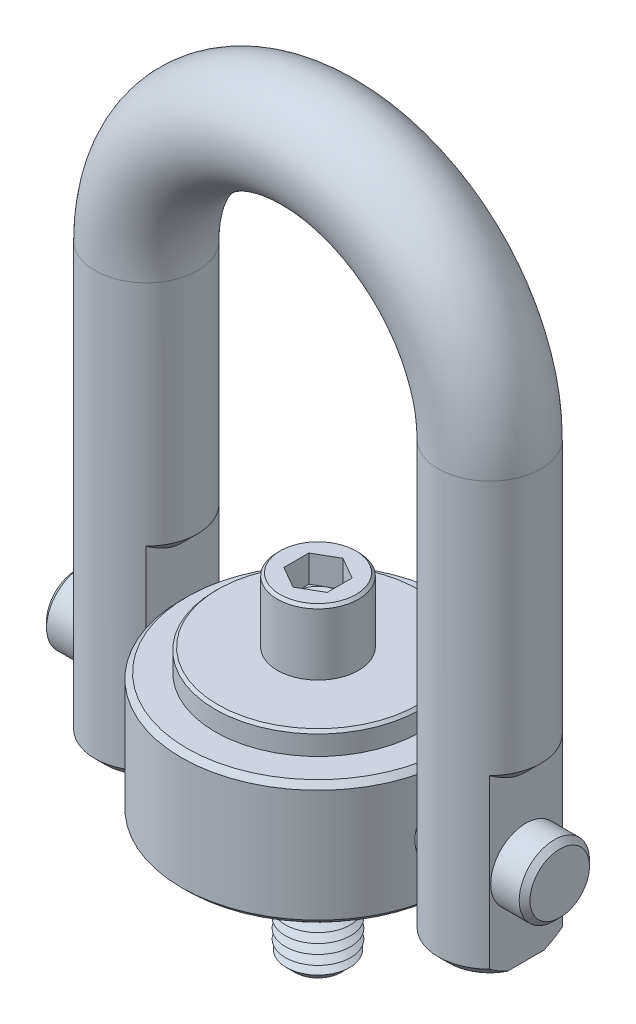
ISO-10303-21;
HEADER;
FILE_DESCRIPTION(('STEP AP214'),'2;1');
FILE_NAME('part.step','',(''),(''),'','','');
FILE_SCHEMA(('AUTOMOTIVE_DESIGN { 1 0 10303 214 1 1 1 1 }'));
ENDSEC;
DATA;
#1=APPLICATION_CONTEXT('core data for automotive mechanical design processes');
#2=APPLICATION_PROTOCOL_DEFINITION('international standard','automotive_design',2000,#1);
#3=PRODUCT_CONTEXT('',#1,'mechanical');
#4=PRODUCT('Part','Part','',(#3));
#5=PRODUCT_RELATED_PRODUCT_CATEGORY('part','',(#4));
#6=PRODUCT_DEFINITION_FORMATION('','',#4);
#7=PRODUCT_DEFINITION_CONTEXT('part definition',#1,'design');
#8=PRODUCT_DEFINITION('design','',#6,#7);
#9=PRODUCT_DEFINITION_SHAPE('','',#8);
#10=(LENGTH_UNIT() NAMED_UNIT(*) SI_UNIT(.MILLI.,.METRE.));
#11=(NAMED_UNIT(*) PLANE_ANGLE_UNIT() SI_UNIT($,.RADIAN.));
#12=(NAMED_UNIT(*) SI_UNIT($,.STERADIAN.) SOLID_ANGLE_UNIT());
#13=UNCERTAINTY_MEASURE_WITH_UNIT(LENGTH_MEASURE(1.E-05),#10,'distance_accuracy_value','');
#14=(GEOMETRIC_REPRESENTATION_CONTEXT(3) GLOBAL_UNCERTAINTY_ASSIGNED_CONTEXT((#13)) GLOBAL_UNIT_ASSIGNED_CONTEXT((#10,
#11,#12)) REPRESENTATION_CONTEXT('',''));
#15=CARTESIAN_POINT('',(0.,0.,0.));
#16=DIRECTION('',(0.,0.,1.));
#17=DIRECTION('',(1.,0.,0.));
#18=AXIS2_PLACEMENT_3D('',#15,#16,#17);
#19=CARTESIAN_POINT('',(44.7,0.,0.));
#20=DIRECTION('',(-1.,0.,0.));
#21=DIRECTION('',(0.,0.,1.));
#22=AXIS2_PLACEMENT_3D('',#19,#20,#21);
#23=CYLINDRICAL_SURFACE('',#22,6.5);
#24=CARTESIAN_POINT('',(-43.6999999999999,0.,0.));
#25=DIRECTION('',(1.,0.,0.));
#26=DIRECTION('',(0.,0.,-1.));
#27=AXIS2_PLACEMENT_3D('',#24,#25,#26);
#28=CIRCLE('',#27,6.5);
#29=CARTESIAN_POINT('',(-43.6999999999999,0.,6.5));
#30=VERTEX_POINT('',#29);
#31=EDGE_CURVE('P0_E25',#30,#30,#28,.T.);
#32=CARTESIAN_POINT('',(43.7000000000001,0.,0.));
#33=DIRECTION('',(1.,0.,0.));
#34=DIRECTION('',(0.,0.,-1.));
#35=AXIS2_PLACEMENT_3D('',#32,#33,#34);
#36=CIRCLE('',#35,6.5);
#37=CARTESIAN_POINT('',(43.7000000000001,0.,6.5));
#38=VERTEX_POINT('',#37);
#39=EDGE_CURVE('P0_E29',#38,#38,#36,.F.);
#40=CARTESIAN_POINT('',(-43.6999999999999,0.,6.5));
#41=CARTESIAN_POINT('',(-42.7895833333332,0.,6.5));
#42=CARTESIAN_POINT('',(-41.8791666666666,0.,6.5));
#43=CARTESIAN_POINT('',(-40.0583333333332,0.,6.5));
#44=CARTESIAN_POINT('',(-39.1479166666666,0.,6.5));
#45=CARTESIAN_POINT('',(-37.3270833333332,0.,6.5));
#46=CARTESIAN_POINT('',(-36.4166666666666,0.,6.5));
#47=CARTESIAN_POINT('',(-34.5958333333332,0.,6.5));
#48=CARTESIAN_POINT('',(-33.6854166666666,0.,6.5));
#49=CARTESIAN_POINT('',(-31.8645833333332,0.,6.5));
#50=CARTESIAN_POINT('',(-30.9541666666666,0.,6.5));
#51=CARTESIAN_POINT('',(-29.1333333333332,0.,6.5));
#52=CARTESIAN_POINT('',(-28.2229166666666,0.,6.5));
#53=CARTESIAN_POINT('',(-26.4020833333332,0.,6.5));
#54=CARTESIAN_POINT('',(-25.4916666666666,0.,6.5));
#55=CARTESIAN_POINT('',(-23.6708333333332,0.,6.5));
#56=CARTESIAN_POINT('',(-22.7604166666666,0.,6.5));
#57=CARTESIAN_POINT('',(-20.9395833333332,0.,6.5));
#58=CARTESIAN_POINT('',(-20.0291666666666,0.,6.5));
#59=CARTESIAN_POINT('',(-18.2083333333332,0.,6.5));
#60=CARTESIAN_POINT('',(-17.2979166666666,0.,6.5));
#61=CARTESIAN_POINT('',(-15.4770833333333,0.,6.5));
#62=CARTESIAN_POINT('',(-14.5666666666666,0.,6.5));
#63=CARTESIAN_POINT('',(-12.7458333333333,0.,6.5));
#64=CARTESIAN_POINT('',(-11.8354166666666,0.,6.5));
#65=CARTESIAN_POINT('',(-10.0145833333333,0.,6.5));
#66=CARTESIAN_POINT('',(-9.10416666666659,0.,6.5));
#67=CARTESIAN_POINT('',(-7.28333333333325,0.,6.5));
#68=CARTESIAN_POINT('',(-6.37291666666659,0.,6.5));
#69=CARTESIAN_POINT('',(-4.55208333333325,0.,6.5));
#70=CARTESIAN_POINT('',(-3.64166666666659,0.,6.5));
#71=CARTESIAN_POINT('',(-1.82083333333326,0.,6.5));
#72=CARTESIAN_POINT('',(-0.910416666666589,0.,6.5));
#73=CARTESIAN_POINT('',(0.910416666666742,0.,6.5));
#74=CARTESIAN_POINT('',(1.82083333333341,0.,6.5));
#75=CARTESIAN_POINT('',(3.64166666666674,0.,6.5));
#76=CARTESIAN_POINT('',(4.5520833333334,0.,6.5));
#77=CARTESIAN_POINT('',(6.37291666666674,0.,6.5));
#78=CARTESIAN_POINT('',(7.28333333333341,0.,6.5));
#79=CARTESIAN_POINT('',(9.10416666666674,0.,6.5));
#80=CARTESIAN_POINT('',(10.0145833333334,0.,6.5));
#81=CARTESIAN_POINT('',(11.8354166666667,0.,6.5));
#82=CARTESIAN_POINT('',(12.7458333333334,0.,6.5));
#83=CARTESIAN_POINT('',(14.5666666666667,0.,6.5));
#84=CARTESIAN_POINT('',(15.4770833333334,0.,6.5));
#85=CARTESIAN_POINT('',(17.2979166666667,0.,6.5));
#86=CARTESIAN_POINT('',(18.2083333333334,0.,6.5));
#87=CARTESIAN_POINT('',(20.0291666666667,0.,6.5));
#88=CARTESIAN_POINT('',(20.9395833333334,0.,6.5));
#89=CARTESIAN_POINT('',(22.7604166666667,0.,6.5));
#90=CARTESIAN_POINT('',(23.6708333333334,0.,6.5));
#91=CARTESIAN_POINT('',(25.4916666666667,0.,6.5));
#92=CARTESIAN_POINT('',(26.4020833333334,0.,6.5));
#93=CARTESIAN_POINT('',(28.2229166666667,0.,6.5));
#94=CARTESIAN_POINT('',(29.1333333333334,0.,6.5));
#95=CARTESIAN_POINT('',(30.9541666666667,0.,6.5));
#96=CARTESIAN_POINT('',(31.8645833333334,0.,6.5));
#97=CARTESIAN_POINT('',(33.6854166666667,0.,6.5));
#98=CARTESIAN_POINT('',(34.5958333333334,0.,6.5));
#99=CARTESIAN_POINT('',(36.4166666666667,0.,6.5));
#100=CARTESIAN_POINT('',(37.3270833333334,0.,6.5));
#101=CARTESIAN_POINT('',(39.1479166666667,0.,6.5));
#102=CARTESIAN_POINT('',(40.0583333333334,0.,6.5));
#103=CARTESIAN_POINT('',(41.8791666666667,0.,6.5));
#104=CARTESIAN_POINT('',(42.7895833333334,0.,6.5));
#105=CARTESIAN_POINT('',(43.7000000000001,0.,6.5));
#106=B_SPLINE_CURVE_WITH_KNOTS('',3,(#40,#41,#42,#43,#44,#45,#46,#47,#48,#49,#50,#51,#52,#53,
#54,#55,#56,#57,#58,#59,#60,#61,#62,#63,#64,#65,#66,#67,#68,#69,#70,#71,#72,#73,#74,#75,#76,#77,
#78,#79,#80,#81,#82,#83,#84,#85,#86,#87,#88,#89,#90,#91,#92,#93,#94,#95,#96,#97,#98,#99,#100,
#101,#102,#103,#104,#105),.UNSPECIFIED.,.F.,.F.,(4,2,2,2,2,2,2,2,2,2,2,2,2,2,2,2,2,2,2,2,2,2,2,
2,2,2,2,2,2,2,2,2,4),(0.,2.73125,5.4625,8.19375,10.925,13.65625,16.3875,19.11875,21.85,24.58125,
27.3125,30.04375,32.775,35.50625,38.2375,40.96875,43.7,46.43125,49.1625,51.89375,54.625,
57.35625,60.0875,62.81875,65.55,68.28125,71.0125,73.74375,76.475,79.20625,81.9375,84.66875,
87.4),.UNSPECIFIED.);
#107=EDGE_CURVE('P0_BSEAM14',#30,#38,#106,.T.);
#108=ORIENTED_EDGE('',*,*,#31,.T.);
#109=ORIENTED_EDGE('',*,*,#39,.T.);
#110=ORIENTED_EDGE('',*,*,#107,.T.);
#111=ORIENTED_EDGE('',*,*,#107,.F.);
#112=EDGE_LOOP('',(#108,#110,#109,#111));
#113=FACE_BOUND('',#112,.T.);
#114=ADVANCED_FACE('P0_F14',(#113),#23,.T.);
#115=CARTESIAN_POINT('',(44.7,0.,0.));
#116=DIRECTION('',(1.,0.,0.));
#117=DIRECTION('',(0.,0.,-1.));
#118=AXIS2_PLACEMENT_3D('',#115,#116,#117);
#119=PLANE('',#118);
#120=CARTESIAN_POINT('',(44.7,0.,0.));
#121=DIRECTION('',(1.,0.,0.));
#122=DIRECTION('',(0.,0.,-1.));
#123=AXIS2_PLACEMENT_3D('',#120,#121,#122);
#124=CIRCLE('',#123,5.50000000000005);
#125=CARTESIAN_POINT('',(44.7,0.,-5.50000000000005));
#126=VERTEX_POINT('',#125);
#127=EDGE_CURVE('P0_E10',#126,#126,#124,.T.);
#128=ORIENTED_EDGE('',*,*,#127,.T.);
#129=EDGE_LOOP('',(#128));
#130=FACE_BOUND('',#129,.T.);
#131=ADVANCED_FACE('P0_F46',(#130),#119,.T.);
#132=CARTESIAN_POINT('',(-44.7,0.,0.));
#133=DIRECTION('',(1.,0.,0.));
#134=DIRECTION('',(0.,0.,-1.));
#135=AXIS2_PLACEMENT_3D('',#132,#133,#134);
#136=PLANE('',#135);
#137=CARTESIAN_POINT('',(-44.7,0.,0.));
#138=DIRECTION('',(1.,0.,0.));
#139=DIRECTION('',(0.,0.,-1.));
#140=AXIS2_PLACEMENT_3D('',#137,#138,#139);
#141=CIRCLE('',#140,5.49999999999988);
#142=CARTESIAN_POINT('',(-44.7,0.,-5.49999999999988));
#143=VERTEX_POINT('',#142);
#144=EDGE_CURVE('P0_E21',#143,#143,#141,.F.);
#145=ORIENTED_EDGE('',*,*,#144,.T.);
#146=EDGE_LOOP('',(#145));
#147=FACE_BOUND('',#146,.T.);
#148=ADVANCED_FACE('P0_F43',(#147),#136,.F.);
#149=CARTESIAN_POINT('',(-43.6999999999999,0.,0.));
#150=DIRECTION('',(1.,0.,0.));
#151=DIRECTION('',(0.,0.,-1.));
#152=AXIS2_PLACEMENT_3D('',#149,#150,#151);
#153=CONICAL_SURFACE('',#152,6.5,0.785398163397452);
#154=ORIENTED_EDGE('',*,*,#144,.F.);
#155=EDGE_LOOP('',(#154));
#156=FACE_BOUND('',#155,.T.);
#157=ORIENTED_EDGE('',*,*,#31,.F.);
#158=EDGE_LOOP('',(#157));
#159=FACE_BOUND('',#158,.T.);
#160=ADVANCED_FACE('P0_F38',(#156,#159),#153,.T.);
#161=CARTESIAN_POINT('',(44.7,0.,0.));
#162=DIRECTION('',(-1.,0.,0.));
#163=DIRECTION('',(0.,0.,1.));
#164=AXIS2_PLACEMENT_3D('',#161,#162,#163);
#165=CONICAL_SURFACE('',#164,5.50000000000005,0.785398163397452);
#166=ORIENTED_EDGE('',*,*,#39,.F.);
#167=EDGE_LOOP('',(#166));
#168=FACE_BOUND('',#167,.T.);
#169=ORIENTED_EDGE('',*,*,#127,.F.);
#170=EDGE_LOOP('',(#169));
#171=FACE_BOUND('',#170,.T.);
#172=ADVANCED_FACE('P0_F16',(#168,#171),#165,.T.);
#173=CLOSED_SHELL('',(#114,#131,#148,#160,#172));
#174=MANIFOLD_SOLID_BREP('P0_B1',#173);
#175=CARTESIAN_POINT('',(31.7500000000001,-15.5,0.));
#176=DIRECTION('',(0.,-1.,0.));
#177=DIRECTION('',(0.,0.,1.));
#178=AXIS2_PLACEMENT_3D('',#175,#176,#177);
#179=PLANE('',#178);
#180=DIRECTION('',(0.,0.,-1.));
#181=VECTOR('',#180,1.);
#182=CARTESIAN_POINT('',(25.0651290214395,-15.5,6.75));
#183=LINE('',#182,#181);
#184=CARTESIAN_POINT('',(25.0651290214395,-15.5,3.40036762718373));
#185=VERTEX_POINT('',#184);
#186=CARTESIAN_POINT('',(25.0651290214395,-15.5,-3.40036762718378));
#187=VERTEX_POINT('',#186);
#188=EDGE_CURVE('P1_E132',#185,#187,#183,.T.);
#189=ORIENTED_EDGE('',*,*,#188,.T.);
#190=CARTESIAN_POINT('',(31.7500000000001,-15.5,0.));
#191=DIRECTION('',(0.,-1.,0.));
#192=DIRECTION('',(1.,0.,0.));
#193=AXIS2_PLACEMENT_3D('',#190,#191,#192);
#194=CIRCLE('',#193,7.50000000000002);
#195=CARTESIAN_POINT('',(38.4348709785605,-15.5,-3.40036762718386));
#196=VERTEX_POINT('',#195);
#197=EDGE_CURVE('P1_E192',#187,#196,#194,.T.);
#198=ORIENTED_EDGE('',*,*,#197,.T.);
#199=DIRECTION('',(0.,0.,1.));
#200=VECTOR('',#199,1.);
#201=CARTESIAN_POINT('',(38.4348709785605,-15.5,6.75));
#202=LINE('',#201,#200);
#203=CARTESIAN_POINT('',(38.4348709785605,-15.5,3.40036762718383));
#204=VERTEX_POINT('',#203);
#205=EDGE_CURVE('P1_E315',#196,#204,#202,.T.);
#206=ORIENTED_EDGE('',*,*,#205,.T.);
#207=CARTESIAN_POINT('',(31.7500000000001,-15.5,0.));
#208=DIRECTION('',(0.,-1.,0.));
#209=DIRECTION('',(1.,0.,0.));
#210=AXIS2_PLACEMENT_3D('',#207,#208,#209);
#211=CIRCLE('',#210,7.5);
#212=CARTESIAN_POINT('',(31.7500000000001,-15.5,7.49999999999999));
#213=VERTEX_POINT('',#212);
#214=EDGE_CURVE('P1_E370',#204,#213,#211,.T.);
#215=ORIENTED_EDGE('',*,*,#214,.T.);
#216=CARTESIAN_POINT('',(31.7500000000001,-15.5,0.));
#217=DIRECTION('',(0.,-1.,0.));
#218=DIRECTION('',(1.,0.,0.));
#219=AXIS2_PLACEMENT_3D('',#216,#217,#218);
#220=CIRCLE('',#219,7.49999999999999);
#221=EDGE_CURVE('P1_E369',#213,#185,#220,.T.);
#222=ORIENTED_EDGE('',*,*,#221,.T.);
#223=EDGE_LOOP('',(#189,#198,#206,#215,#222));
#224=FACE_BOUND('',#223,.T.);
#225=ADVANCED_FACE('P1_F16',(#224),#179,.T.);
#226=CARTESIAN_POINT('',(31.75,64.65,0.));
#227=DIRECTION('',(0.,-1.,0.));
#228=DIRECTION('',(1.,0.,0.));
#229=AXIS2_PLACEMENT_3D('',#226,#227,#228);
#230=CYLINDRICAL_SURFACE('',#229,9.5);
#231=CARTESIAN_POINT('',(31.75,64.65,0.));
#232=DIRECTION('',(0.,-1.,0.));
#233=DIRECTION('',(0.,0.,1.));
#234=AXIS2_PLACEMENT_3D('',#231,#232,#233);
#235=CIRCLE('',#234,9.5);
#236=CARTESIAN_POINT('',(41.25,64.65,0.));
#237=VERTEX_POINT('',#236);
#238=EDGE_CURVE('P1_E143',#237,#237,#235,.T.);
#239=ORIENTED_EDGE('',*,*,#238,.T.);
#240=EDGE_LOOP('',(#239));
#241=FACE_BOUND('',#240,.T.);
#242=DIRECTION('',(0.,-1.,0.));
#243=VECTOR('',#242,1.);
#244=CARTESIAN_POINT('',(38.4348709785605,14.5,-6.75));
#245=LINE('',#244,#243);
#246=CARTESIAN_POINT('',(38.4348709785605,17.5,-6.74999999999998));
#247=VERTEX_POINT('',#246);
#248=CARTESIAN_POINT('',(38.4348709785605,-13.5,-6.75));
#249=VERTEX_POINT('',#248);
#250=EDGE_CURVE('P1_E328',#247,#249,#245,.T.);
#251=ORIENTED_EDGE('',*,*,#250,.T.);
#252=CARTESIAN_POINT('',(31.7500000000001,-13.5,0.));
#253=DIRECTION('',(0.,-1.,0.));
#254=DIRECTION('',(0.,0.,-1.));
#255=AXIS2_PLACEMENT_3D('',#252,#253,#254);
#256=CIRCLE('',#255,9.5);
#257=CARTESIAN_POINT('',(25.0651290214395,-13.5,-6.75));
#258=VERTEX_POINT('',#257);
#259=EDGE_CURVE('P1_E128',#249,#258,#256,.F.);
#260=ORIENTED_EDGE('',*,*,#259,.T.);
#261=DIRECTION('',(0.,-1.,0.));
#262=VECTOR('',#261,1.);
#263=CARTESIAN_POINT('',(25.0651290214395,19.5,-6.75));
#264=LINE('',#263,#262);
#265=CARTESIAN_POINT('',(25.0651290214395,22.5,-6.75));
#266=VERTEX_POINT('',#265);
#267=EDGE_CURVE('P1_E120',#266,#258,#264,.T.);
#268=ORIENTED_EDGE('',*,*,#267,.F.);
#269=CARTESIAN_POINT('',(31.75,22.5000000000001,0.));
#270=DIRECTION('',(0.,-1.,0.));
#271=DIRECTION('',(1.,0.,0.));
#272=AXIS2_PLACEMENT_3D('',#269,#270,#271);
#273=CIRCLE('',#272,9.5);
#274=CARTESIAN_POINT('',(25.0651290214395,22.5,6.74999999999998));
#275=VERTEX_POINT('',#274);
#276=EDGE_CURVE('P1_E126',#266,#275,#273,.F.);
#277=ORIENTED_EDGE('',*,*,#276,.T.);
#278=DIRECTION('',(0.,-1.,0.));
#279=VECTOR('',#278,1.);
#280=CARTESIAN_POINT('',(25.0651290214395,19.5,6.75));
#281=LINE('',#280,#279);
#282=CARTESIAN_POINT('',(25.0651290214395,-13.5,6.75));
#283=VERTEX_POINT('',#282);
#284=EDGE_CURVE('P1_E131',#275,#283,#281,.T.);
#285=ORIENTED_EDGE('',*,*,#284,.T.);
#286=CARTESIAN_POINT('',(31.7500000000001,-13.5,0.));
#287=DIRECTION('',(0.,-1.,0.));
#288=DIRECTION('',(0.,0.,-1.));
#289=AXIS2_PLACEMENT_3D('',#286,#287,#288);
#290=CIRCLE('',#289,9.5);
#291=CARTESIAN_POINT('',(31.7500000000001,-13.5,9.5));
#292=VERTEX_POINT('',#291);
#293=EDGE_CURVE('P1_E530',#283,#292,#290,.F.);
#294=ORIENTED_EDGE('',*,*,#293,.T.);
#295=CARTESIAN_POINT('',(31.7500000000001,-13.5,0.));
#296=DIRECTION('',(0.,-1.,0.));
#297=DIRECTION('',(0.,0.,-1.));
#298=AXIS2_PLACEMENT_3D('',#295,#296,#297);
#299=CIRCLE('',#298,9.5);
#300=CARTESIAN_POINT('',(38.4348709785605,-13.5,6.75));
#301=VERTEX_POINT('',#300);
#302=EDGE_CURVE('P1_E528',#292,#301,#299,.F.);
#303=ORIENTED_EDGE('',*,*,#302,.T.);
#304=DIRECTION('',(0.,-1.,0.));
#305=VECTOR('',#304,1.);
#306=CARTESIAN_POINT('',(38.4348709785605,14.5,6.75));
#307=LINE('',#306,#305);
#308=CARTESIAN_POINT('',(38.4348709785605,17.5,6.75));
#309=VERTEX_POINT('',#308);
#310=EDGE_CURVE('P1_E327',#309,#301,#307,.T.);
#311=ORIENTED_EDGE('',*,*,#310,.F.);
#312=CARTESIAN_POINT('',(31.75,17.5,0.));
#313=DIRECTION('',(0.,-1.,0.));
#314=DIRECTION('',(0.,0.,-1.));
#315=AXIS2_PLACEMENT_3D('',#312,#313,#314);
#316=CIRCLE('',#315,9.5);
#317=EDGE_CURVE('P1_E142',#309,#247,#316,.F.);
#318=ORIENTED_EDGE('',*,*,#317,.T.);
#319=EDGE_LOOP('',(#251,#260,#268,#277,#285,#294,#303,#311,#318));
#320=FACE_BOUND('',#319,.T.);
#321=ADVANCED_FACE('P1_F123',(#241,#320),#230,.T.);
#322=CARTESIAN_POINT('',(-31.7500000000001,-15.5,0.));
#323=DIRECTION('',(0.,1.,0.));
#324=DIRECTION('',(0.,0.,1.));
#325=AXIS2_PLACEMENT_3D('',#322,#323,#324);
#326=PLANE('',#325);
#327=DIRECTION('',(0.,0.,1.));
#328=VECTOR('',#327,1.);
#329=CARTESIAN_POINT('',(-38.4348709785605,-15.5,6.75));
#330=LINE('',#329,#328);
#331=CARTESIAN_POINT('',(-38.4348709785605,-15.5,-3.40036762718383));
#332=VERTEX_POINT('',#331);
#333=CARTESIAN_POINT('',(-38.4348709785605,-15.5,3.40036762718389));
#334=VERTEX_POINT('',#333);
#335=EDGE_CURVE('P1_E334',#332,#334,#330,.T.);
#336=ORIENTED_EDGE('',*,*,#335,.F.);
#337=CARTESIAN_POINT('',(-31.7500000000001,-15.5,0.));
#338=DIRECTION('',(0.,1.,0.));
#339=DIRECTION('',(0.,0.,1.));
#340=AXIS2_PLACEMENT_3D('',#337,#338,#339);
#341=CIRCLE('',#340,7.50000000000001);
#342=CARTESIAN_POINT('',(-25.0651290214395,-15.5,-3.40036762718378));
#343=VERTEX_POINT('',#342);
#344=EDGE_CURVE('P1_E40',#332,#343,#341,.F.);
#345=ORIENTED_EDGE('',*,*,#344,.T.);
#346=DIRECTION('',(0.,0.,-1.));
#347=VECTOR('',#346,1.);
#348=CARTESIAN_POINT('',(-25.0651290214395,-15.5,6.75));
#349=LINE('',#348,#347);
#350=CARTESIAN_POINT('',(-25.0651290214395,-15.5,3.40036762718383));
#351=VERTEX_POINT('',#350);
#352=EDGE_CURVE('P1_E303',#351,#343,#349,.T.);
#353=ORIENTED_EDGE('',*,*,#352,.F.);
#354=CARTESIAN_POINT('',(-31.7500000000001,-15.5,0.));
#355=DIRECTION('',(0.,1.,0.));
#356=DIRECTION('',(0.,0.,1.));
#357=AXIS2_PLACEMENT_3D('',#354,#355,#356);
#358=CIRCLE('',#357,7.50000000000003);
#359=CARTESIAN_POINT('',(-31.7500000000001,-15.5,7.50000000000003));
#360=VERTEX_POINT('',#359);
#361=EDGE_CURVE('P1_E34',#351,#360,#358,.F.);
#362=ORIENTED_EDGE('',*,*,#361,.T.);
#363=CARTESIAN_POINT('',(-31.7500000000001,-15.5,0.));
#364=DIRECTION('',(0.,1.,0.));
#365=DIRECTION('',(0.,0.,1.));
#366=AXIS2_PLACEMENT_3D('',#363,#364,#365);
#367=CIRCLE('',#366,7.50000000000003);
#368=EDGE_CURVE('P1_E298',#360,#334,#367,.F.);
#369=ORIENTED_EDGE('',*,*,#368,.T.);
#370=EDGE_LOOP('',(#336,#345,#353,#362,#369));
#371=FACE_BOUND('',#370,.T.);
#372=ADVANCED_FACE('P1_F239',(#371),#326,.F.);
#373=CARTESIAN_POINT('',(-31.7500000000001,-15.5,0.));
#374=DIRECTION('',(0.,1.,0.));
#375=DIRECTION('',(-1.,0.,0.));
#376=AXIS2_PLACEMENT_3D('',#373,#374,#375);
#377=CYLINDRICAL_SURFACE('',#376,9.5);
#378=DIRECTION('',(0.,-1.,0.));
#379=VECTOR('',#378,1.);
#380=CARTESIAN_POINT('',(-25.0651290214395,19.5,-6.75));
#381=LINE('',#380,#379);
#382=CARTESIAN_POINT('',(-25.0651290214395,22.5,-6.74999999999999));
#383=VERTEX_POINT('',#382);
#384=CARTESIAN_POINT('',(-25.0651290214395,-13.5,-6.75));
#385=VERTEX_POINT('',#384);
#386=EDGE_CURVE('P1_E340',#383,#385,#381,.T.);
#387=ORIENTED_EDGE('',*,*,#386,.T.);
#388=CARTESIAN_POINT('',(-31.7500000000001,-13.5,0.));
#389=DIRECTION('',(0.,1.,0.));
#390=DIRECTION('',(0.,0.,1.));
#391=AXIS2_PLACEMENT_3D('',#388,#389,#390);
#392=CIRCLE('',#391,9.5);
#393=CARTESIAN_POINT('',(-38.4348709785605,-13.5,-6.75));
#394=VERTEX_POINT('',#393);
#395=EDGE_CURVE('P1_E287',#385,#394,#392,.T.);
#396=ORIENTED_EDGE('',*,*,#395,.T.);
#397=DIRECTION('',(0.,-1.,0.));
#398=VECTOR('',#397,1.);
#399=CARTESIAN_POINT('',(-38.4348709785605,14.5,-6.75));
#400=LINE('',#399,#398);
#401=CARTESIAN_POINT('',(-38.4348709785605,17.5,-6.74999999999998));
#402=VERTEX_POINT('',#401);
#403=EDGE_CURVE('P1_E337',#402,#394,#400,.T.);
#404=ORIENTED_EDGE('',*,*,#403,.F.);
#405=CARTESIAN_POINT('',(-31.75,17.5,0.));
#406=DIRECTION('',(0.,-1.,0.));
#407=DIRECTION('',(0.,0.,-1.));
#408=AXIS2_PLACEMENT_3D('',#405,#406,#407);
#409=CIRCLE('',#408,9.5);
#410=CARTESIAN_POINT('',(-38.4348709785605,17.5,6.74999999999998));
#411=VERTEX_POINT('',#410);
#412=EDGE_CURVE('P1_E146',#402,#411,#409,.F.);
#413=ORIENTED_EDGE('',*,*,#412,.T.);
#414=DIRECTION('',(0.,-1.,0.));
#415=VECTOR('',#414,1.);
#416=CARTESIAN_POINT('',(-38.4348709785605,14.5,6.75));
#417=LINE('',#416,#415);
#418=CARTESIAN_POINT('',(-38.4348709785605,-13.5,6.75));
#419=VERTEX_POINT('',#418);
#420=EDGE_CURVE('P1_E308',#411,#419,#417,.T.);
#421=ORIENTED_EDGE('',*,*,#420,.T.);
#422=CARTESIAN_POINT('',(-31.7500000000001,-13.5,0.));
#423=DIRECTION('',(0.,1.,0.));
#424=DIRECTION('',(0.,0.,1.));
#425=AXIS2_PLACEMENT_3D('',#422,#423,#424);
#426=CIRCLE('',#425,9.5);
#427=CARTESIAN_POINT('',(-31.7500000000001,-13.5,9.5));
#428=VERTEX_POINT('',#427);
#429=EDGE_CURVE('P1_E284',#419,#428,#426,.T.);
#430=ORIENTED_EDGE('',*,*,#429,.T.);
#431=CARTESIAN_POINT('',(-31.7500000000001,-13.5,0.));
#432=DIRECTION('',(0.,1.,0.));
#433=DIRECTION('',(0.,0.,1.));
#434=AXIS2_PLACEMENT_3D('',#431,#432,#433);
#435=CIRCLE('',#434,9.5);
#436=CARTESIAN_POINT('',(-25.0651290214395,-13.5,6.75));
#437=VERTEX_POINT('',#436);
#438=EDGE_CURVE('P1_E277',#428,#437,#435,.T.);
#439=ORIENTED_EDGE('',*,*,#438,.T.);
#440=DIRECTION('',(0.,-1.,0.));
#441=VECTOR('',#440,1.);
#442=CARTESIAN_POINT('',(-25.0651290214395,19.5,6.75));
#443=LINE('',#442,#441);
#444=CARTESIAN_POINT('',(-25.0651290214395,22.5,6.74999999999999));
#445=VERTEX_POINT('',#444);
#446=EDGE_CURVE('P1_E305',#445,#437,#443,.T.);
#447=ORIENTED_EDGE('',*,*,#446,.F.);
#448=CARTESIAN_POINT('',(-31.75,22.5,0.));
#449=DIRECTION('',(0.,-1.,0.));
#450=DIRECTION('',(1.,0.,0.));
#451=AXIS2_PLACEMENT_3D('',#448,#449,#450);
#452=CIRCLE('',#451,9.5);
#453=EDGE_CURVE('P1_E155',#445,#383,#452,.F.);
#454=ORIENTED_EDGE('',*,*,#453,.T.);
#455=EDGE_LOOP('',(#387,#396,#404,#413,#421,#430,#439,#447,#454));
#456=FACE_BOUND('',#455,.T.);
#457=CARTESIAN_POINT('',(-31.75,64.65,0.));
#458=DIRECTION('',(0.,1.,0.));
#459=DIRECTION('',(0.,0.,1.));
#460=AXIS2_PLACEMENT_3D('',#457,#458,#459);
#461=CIRCLE('',#460,9.5);
#462=CARTESIAN_POINT('',(-41.2500000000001,64.65,0.));
#463=VERTEX_POINT('',#462);
#464=EDGE_CURVE('P1_E149',#463,#463,#461,.T.);
#465=ORIENTED_EDGE('',*,*,#464,.F.);
#466=EDGE_LOOP('',(#465));
#467=FACE_BOUND('',#466,.T.);
#468=ADVANCED_FACE('P1_F241',(#456,#467),#377,.T.);
#469=CARTESIAN_POINT('',(0.,64.65,0.));
#470=DIRECTION('',(0.,0.,-1.));
#471=DIRECTION('',(-1.,0.,0.));
#472=AXIS2_PLACEMENT_3D('',#469,#470,#471);
#473=TOROIDAL_SURFACE('',#472,31.75,9.5);
#474=CARTESIAN_POINT('',(0.,64.65,0.));
#475=DIRECTION('',(0.,0.,-1.));
#476=DIRECTION('',(-1.,0.,0.));
#477=AXIS2_PLACEMENT_3D('',#474,#475,#476);
#478=CIRCLE('',#477,41.25);
#479=EDGE_CURVE('',#463,#237,#478,.T.);
#480=ORIENTED_EDGE('',*,*,#464,.T.);
#481=ORIENTED_EDGE('',*,*,#238,.F.);
#482=ORIENTED_EDGE('',*,*,#479,.T.);
#483=ORIENTED_EDGE('',*,*,#479,.F.);
#484=EDGE_LOOP('',(#480,#482,#481,#483));
#485=FACE_BOUND('',#484,.T.);
#486=ADVANCED_FACE('P1_F237',(#485),#473,.T.);
#487=CARTESIAN_POINT('',(-25.0651290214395,19.5,6.75));
#488=DIRECTION('',(-1.,0.,0.));
#489=DIRECTION('',(0.,0.,1.));
#490=AXIS2_PLACEMENT_3D('',#487,#488,#489);
#491=PLANE('',#490);
#492=CARTESIAN_POINT('',(-25.0651290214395,0.,0.));
#493=DIRECTION('',(-1.,0.,0.));
#494=DIRECTION('',(0.,0.,1.));
#495=AXIS2_PLACEMENT_3D('',#492,#493,#494);
#496=CIRCLE('',#495,6.5);
#497=CARTESIAN_POINT('',(-25.0651290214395,0.,-6.5));
#498=VERTEX_POINT('',#497);
#499=EDGE_CURVE('P1_E313',#498,#498,#496,.T.);
#500=ORIENTED_EDGE('',*,*,#499,.T.);
#501=EDGE_LOOP('',(#500));
#502=FACE_BOUND('',#501,.T.);
#503=ORIENTED_EDGE('',*,*,#352,.T.);
#504=CARTESIAN_POINT('',(-25.0651290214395,-15.5,-3.40036762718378));
#505=CARTESIAN_POINT('',(-25.0651290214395,-15.4326360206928,-3.54890812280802));
#506=CARTESIAN_POINT('',(-25.0651290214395,-15.3624060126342,-3.69611737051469));
#507=CARTESIAN_POINT('',(-25.0651290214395,-15.2169677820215,-3.98800343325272));
#508=CARTESIAN_POINT('',(-25.0651290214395,-15.1417611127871,-4.1326810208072));
#509=CARTESIAN_POINT('',(-25.0651290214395,-14.9872482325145,-4.41941489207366));
#510=CARTESIAN_POINT('',(-25.0651290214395,-14.9079512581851,-4.56147617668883));
#511=CARTESIAN_POINT('',(-25.0651290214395,-14.7456881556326,-4.84349614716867));
#512=CARTESIAN_POINT('',(-25.0651290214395,-14.6627217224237,-4.98345465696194));
#513=CARTESIAN_POINT('',(-25.0651290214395,-14.4092517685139,-5.40020250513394));
#514=CARTESIAN_POINT('',(-25.0651290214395,-14.2340315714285,-5.67413071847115));
#515=CARTESIAN_POINT('',(-25.0651290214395,-13.9639304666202,-6.08056483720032));
#516=CARTESIAN_POINT('',(-25.0651290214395,-13.8725771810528,-6.21545032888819));
#517=CARTESIAN_POINT('',(-25.0651290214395,-13.6877855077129,-6.48377107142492));
#518=CARTESIAN_POINT('',(-25.0651290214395,-13.5943472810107,-6.6172064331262));
#519=CARTESIAN_POINT('',(-25.0651290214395,-13.5,-6.74999999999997));
#520=B_SPLINE_CURVE_WITH_KNOTS('',3,(#504,#505,#506,#507,#508,#509,#510,#511,#512,#513,#514,
#515,#516,#517,#518,#519),.UNSPECIFIED.,.F.,.F.,(4,2,2,2,2,2,2,4),(0.,0.489232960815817,
0.978313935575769,1.46633508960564,1.9543968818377,2.92960959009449,3.41832609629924,
3.90700497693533),.UNSPECIFIED.);
#521=EDGE_CURVE('P1_E11',#343,#385,#520,.T.);
#522=ORIENTED_EDGE('',*,*,#521,.T.);
#523=ORIENTED_EDGE('',*,*,#386,.F.);
#524=CARTESIAN_POINT('',(-25.0651290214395,22.5,-6.74999999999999));
#525=CARTESIAN_POINT('',(-25.0651290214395,22.3669041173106,-6.56261989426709));
#526=CARTESIAN_POINT('',(-25.0651290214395,22.2355640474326,-6.37396361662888));
#527=CARTESIAN_POINT('',(-25.0651290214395,21.9772356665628,-5.99357751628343));
#528=CARTESIAN_POINT('',(-25.0651290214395,21.8502493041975,-5.80184637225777));
#529=CARTESIAN_POINT('',(-25.0651290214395,21.6000412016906,-5.41254799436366));
#530=CARTESIAN_POINT('',(-25.0651290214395,21.4768859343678,-5.21493783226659));
#531=CARTESIAN_POINT('',(-25.0651290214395,21.237291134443,-4.81570098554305));
#532=CARTESIAN_POINT('',(-25.0651290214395,21.1208508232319,-4.6140747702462));
#533=CARTESIAN_POINT('',(-25.0651290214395,20.8927401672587,-4.19984179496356));
#534=CARTESIAN_POINT('',(-25.0651290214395,20.7813333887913,-3.98708890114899));
#535=CARTESIAN_POINT('',(-25.0651290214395,20.5695366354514,-3.55606763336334));
#536=CARTESIAN_POINT('',(-25.0651290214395,20.4691488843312,-3.3377981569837));
#537=CARTESIAN_POINT('',(-25.0651290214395,20.2826704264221,-2.89647598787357));
#538=CARTESIAN_POINT('',(-25.0651290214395,20.1965099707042,-2.67345307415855));
#539=CARTESIAN_POINT('',(-25.0651290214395,20.0411819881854,-2.22163348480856));
#540=CARTESIAN_POINT('',(-25.0651290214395,19.9720031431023,-1.99284076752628));
#541=CARTESIAN_POINT('',(-25.0651290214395,19.8640140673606,-1.56901241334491));
#542=CARTESIAN_POINT('',(-25.0651290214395,19.822050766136,-1.3747852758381));
#543=CARTESIAN_POINT('',(-25.0651290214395,19.7540735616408,-0.983424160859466));
#544=CARTESIAN_POINT('',(-25.0651290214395,19.7280666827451,-0.786288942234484));
#545=CARTESIAN_POINT('',(-25.0651290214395,19.6935223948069,-0.392293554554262));
#546=CARTESIAN_POINT('',(-25.0651290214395,19.6848277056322,-0.195447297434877));
#547=CARTESIAN_POINT('',(-25.0651290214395,19.6849145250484,0.198159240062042));
#548=CARTESIAN_POINT('',(-25.0651290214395,19.6936863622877,0.39491950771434));
#549=CARTESIAN_POINT('',(-25.0651290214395,19.7189963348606,0.682475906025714));
#550=CARTESIAN_POINT('',(-25.0651290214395,19.7289112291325,0.773903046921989));
#551=CARTESIAN_POINT('',(-25.0651290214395,19.7523224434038,0.95631697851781));
#552=CARTESIAN_POINT('',(-25.0651290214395,19.7658195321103,1.04730367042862));
#553=CARTESIAN_POINT('',(-25.0651290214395,19.8217601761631,1.38057959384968));
#554=CARTESIAN_POINT('',(-25.0651290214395,19.8748342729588,1.62114853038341));
#555=CARTESIAN_POINT('',(-25.0651290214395,20.0022082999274,2.09668833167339));
#556=CARTESIAN_POINT('',(-25.0651290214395,20.0765297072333,2.33165327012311));
#557=CARTESIAN_POINT('',(-25.0651290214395,20.243139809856,2.79698571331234));
#558=CARTESIAN_POINT('',(-25.0651290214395,20.3355556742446,3.02730715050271));
#559=CARTESIAN_POINT('',(-25.0651290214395,20.5344333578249,3.48165388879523));
#560=CARTESIAN_POINT('',(-25.0651290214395,20.6408915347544,3.70568080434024));
#561=CARTESIAN_POINT('',(-25.0651290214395,20.8792671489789,4.17631933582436));
#562=CARTESIAN_POINT('',(-25.0651290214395,21.0126995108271,4.42215819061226));
#563=CARTESIAN_POINT('',(-25.0651290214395,21.2905109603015,4.90761521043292));
#564=CARTESIAN_POINT('',(-25.0651290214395,21.4348935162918,5.14723137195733));
#565=CARTESIAN_POINT('',(-25.0651290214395,21.7292865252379,5.61655464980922));
#566=CARTESIAN_POINT('',(-25.0651290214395,21.879135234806,5.84636371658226));
#567=CARTESIAN_POINT('',(-25.0651290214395,22.1086748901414,6.18769077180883));
#568=CARTESIAN_POINT('',(-25.0651290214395,22.1859449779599,6.30084946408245));
#569=CARTESIAN_POINT('',(-25.0651290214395,22.3419289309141,6.52615765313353));
#570=CARTESIAN_POINT('',(-25.0651290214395,22.4206427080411,6.63830721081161));
#571=CARTESIAN_POINT('',(-25.0651290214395,22.5,6.74999999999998));
#572=B_SPLINE_CURVE_WITH_KNOTS('',3,(#524,#525,#526,#527,#528,#529,#530,#531,#532,#533,#534,
#535,#536,#537,#538,#539,#540,#541,#542,#543,#544,#545,#546,#547,#548,#549,#550,#551,#552,#553,
#554,#555,#556,#557,#558,#559,#560,#561,#562,#563,#564,#565,#566,#567,#568,#569,#570,#571),
.UNSPECIFIED.,.F.,.F.,(4,2,2,2,2,2,2,2,2,2,2,2,2,2,2,2,2,2,2,2,2,2,2,4),(0.,0.689541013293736,
1.37938672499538,2.07781305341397,2.77615823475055,3.4963726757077,4.21673219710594,
4.93344799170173,5.64968478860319,6.24522531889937,6.84102783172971,7.43139236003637,
8.02143008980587,8.29725969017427,8.57314852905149,9.31093092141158,10.0494617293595,
10.7933824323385,11.5371105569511,12.3758890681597,13.2149343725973,14.0378352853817,
14.4488982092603,14.8599361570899),.UNSPECIFIED.);
#573=EDGE_CURVE('P1_E138',#383,#445,#572,.T.);
#574=ORIENTED_EDGE('',*,*,#573,.T.);
#575=ORIENTED_EDGE('',*,*,#446,.T.);
#576=CARTESIAN_POINT('',(-25.0651290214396,-13.5,6.74999999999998));
#577=CARTESIAN_POINT('',(-25.0651290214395,-13.5943472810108,6.61720643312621));
#578=CARTESIAN_POINT('',(-25.0651290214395,-13.6877855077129,6.48377107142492));
#579=CARTESIAN_POINT('',(-25.0651290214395,-13.8725771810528,6.21545032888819));
#580=CARTESIAN_POINT('',(-25.0651290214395,-13.9639304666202,6.08056483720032));
#581=CARTESIAN_POINT('',(-25.0651290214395,-14.2340315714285,5.67413071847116));
#582=CARTESIAN_POINT('',(-25.0651290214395,-14.4092517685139,5.40020250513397));
#583=CARTESIAN_POINT('',(-25.0651290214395,-14.6627217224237,4.98345465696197));
#584=CARTESIAN_POINT('',(-25.0651290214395,-14.7456881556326,4.8434961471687));
#585=CARTESIAN_POINT('',(-25.0651290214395,-14.9079512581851,4.56147617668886));
#586=CARTESIAN_POINT('',(-25.0651290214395,-14.9872482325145,4.4194148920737));
#587=CARTESIAN_POINT('',(-25.0651290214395,-15.1417611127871,4.13268102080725));
#588=CARTESIAN_POINT('',(-25.0651290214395,-15.2169677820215,3.98800343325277));
#589=CARTESIAN_POINT('',(-25.0651290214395,-15.3624060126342,3.69611737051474));
#590=CARTESIAN_POINT('',(-25.0651290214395,-15.4326360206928,3.54890812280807));
#591=CARTESIAN_POINT('',(-25.0651290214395,-15.5,3.40036762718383));
#592=B_SPLINE_CURVE_WITH_KNOTS('',3,(#576,#577,#578,#579,#580,#581,#582,#583,#584,#585,#586,
#587,#588,#589,#590,#591),.UNSPECIFIED.,.F.,.F.,(4,2,2,2,2,2,2,4),(0.,0.488678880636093,
0.977395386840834,1.95260809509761,2.44066988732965,2.92869104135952,3.41777201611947,
3.90700497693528),.UNSPECIFIED.);
#593=EDGE_CURVE('P1_E26',#437,#351,#592,.T.);
#594=ORIENTED_EDGE('',*,*,#593,.T.);
#595=EDGE_LOOP('',(#503,#522,#523,#574,#575,#594));
#596=FACE_BOUND('',#595,.T.);
#597=ADVANCED_FACE('P1_F232',(#502,#596),#491,.F.);
#598=CARTESIAN_POINT('',(-38.4348709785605,14.5,6.75));
#599=DIRECTION('',(1.,0.,0.));
#600=DIRECTION('',(0.,0.,-1.));
#601=AXIS2_PLACEMENT_3D('',#598,#599,#600);
#602=PLANE('',#601);
#603=CARTESIAN_POINT('',(-38.4348709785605,0.,0.));
#604=DIRECTION('',(1.,0.,0.));
#605=DIRECTION('',(0.,0.,-1.));
#606=AXIS2_PLACEMENT_3D('',#603,#604,#605);
#607=CIRCLE('',#606,6.5);
#608=CARTESIAN_POINT('',(-38.4348709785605,0.,-6.5));
#609=VERTEX_POINT('',#608);
#610=EDGE_CURVE('P1_E321',#609,#609,#607,.F.);
#611=ORIENTED_EDGE('',*,*,#610,.F.);
#612=EDGE_LOOP('',(#611));
#613=FACE_BOUND('',#612,.T.);
#614=ORIENTED_EDGE('',*,*,#403,.T.);
#615=CARTESIAN_POINT('',(-38.4348709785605,-13.5,-6.74999999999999));
#616=CARTESIAN_POINT('',(-38.4348709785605,-13.5943472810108,-6.61720643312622));
#617=CARTESIAN_POINT('',(-38.4348709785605,-13.6877855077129,-6.48377107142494));
#618=CARTESIAN_POINT('',(-38.4348709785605,-13.8725771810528,-6.21545032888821));
#619=CARTESIAN_POINT('',(-38.4348709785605,-13.9639304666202,-6.08056483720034));
#620=CARTESIAN_POINT('',(-38.4348709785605,-14.2340315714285,-5.67413071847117));
#621=CARTESIAN_POINT('',(-38.4348709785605,-14.4092517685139,-5.40020250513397));
#622=CARTESIAN_POINT('',(-38.4348709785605,-14.6627217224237,-4.98345465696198));
#623=CARTESIAN_POINT('',(-38.4348709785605,-14.7456881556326,-4.8434961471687));
#624=CARTESIAN_POINT('',(-38.4348709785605,-14.9079512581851,-4.56147617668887));
#625=CARTESIAN_POINT('',(-38.4348709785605,-14.9872482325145,-4.4194148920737));
#626=CARTESIAN_POINT('',(-38.4348709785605,-15.1417611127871,-4.13268102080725));
#627=CARTESIAN_POINT('',(-38.4348709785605,-15.2169677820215,-3.98800343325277));
#628=CARTESIAN_POINT('',(-38.4348709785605,-15.3624060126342,-3.69611737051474));
#629=CARTESIAN_POINT('',(-38.4348709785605,-15.4326360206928,-3.54890812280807));
#630=CARTESIAN_POINT('',(-38.4348709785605,-15.5,-3.40036762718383));
#631=B_SPLINE_CURVE_WITH_KNOTS('',3,(#615,#616,#617,#618,#619,#620,#621,#622,#623,#624,#625,
#626,#627,#628,#629,#630),.UNSPECIFIED.,.F.,.F.,(4,2,2,2,2,2,2,4),(0.,0.488678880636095,
0.977395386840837,1.95260809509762,2.44066988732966,2.92869104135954,3.41777201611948,
3.9070049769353),.UNSPECIFIED.);
#632=EDGE_CURVE('P1_E216',#394,#332,#631,.T.);
#633=ORIENTED_EDGE('',*,*,#632,.T.);
#634=ORIENTED_EDGE('',*,*,#335,.T.);
#635=CARTESIAN_POINT('',(-38.4348709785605,-15.5,3.40036762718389));
#636=CARTESIAN_POINT('',(-38.4348709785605,-15.4326360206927,3.54890812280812));
#637=CARTESIAN_POINT('',(-38.4348709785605,-15.3624060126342,3.69611737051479));
#638=CARTESIAN_POINT('',(-38.4348709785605,-15.2169677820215,3.98800343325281));
#639=CARTESIAN_POINT('',(-38.4348709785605,-15.1417611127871,4.13268102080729));
#640=CARTESIAN_POINT('',(-38.4348709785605,-14.9872482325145,4.41941489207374));
#641=CARTESIAN_POINT('',(-38.4348709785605,-14.9079512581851,4.5614761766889));
#642=CARTESIAN_POINT('',(-38.4348709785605,-14.7456881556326,4.84349614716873));
#643=CARTESIAN_POINT('',(-38.4348709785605,-14.6627217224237,4.98345465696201));
#644=CARTESIAN_POINT('',(-38.4348709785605,-14.409251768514,5.40020250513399));
#645=CARTESIAN_POINT('',(-38.4348709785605,-14.2340315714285,5.67413071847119));
#646=CARTESIAN_POINT('',(-38.4348709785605,-13.9639304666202,6.08056483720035));
#647=CARTESIAN_POINT('',(-38.4348709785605,-13.8725771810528,6.21545032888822));
#648=CARTESIAN_POINT('',(-38.4348709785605,-13.6877855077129,6.48377107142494));
#649=CARTESIAN_POINT('',(-38.4348709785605,-13.5943472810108,6.61720643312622));
#650=CARTESIAN_POINT('',(-38.4348709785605,-13.5,6.74999999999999));
#651=B_SPLINE_CURVE_WITH_KNOTS('',3,(#635,#636,#637,#638,#639,#640,#641,#642,#643,#644,#645,
#646,#647,#648,#649,#650),.UNSPECIFIED.,.F.,.F.,(4,2,2,2,2,2,2,4),(0.,0.489232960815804,
0.978313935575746,1.46633508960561,1.95439688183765,2.92960959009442,3.41832609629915,
3.90700497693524),.UNSPECIFIED.);
#652=EDGE_CURVE('P1_E289',#334,#419,#651,.T.);
#653=ORIENTED_EDGE('',*,*,#652,.T.);
#654=ORIENTED_EDGE('',*,*,#420,.F.);
#655=CARTESIAN_POINT('',(-38.4348709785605,17.5,6.74999999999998));
#656=CARTESIAN_POINT('',(-38.4348709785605,17.3669041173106,6.56261989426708));
#657=CARTESIAN_POINT('',(-38.4348709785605,17.2355640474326,6.37396361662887));
#658=CARTESIAN_POINT('',(-38.4348709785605,16.9772356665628,5.99357751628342));
#659=CARTESIAN_POINT('',(-38.4348709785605,16.8502493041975,5.80184637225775));
#660=CARTESIAN_POINT('',(-38.4348709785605,16.6000412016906,5.41254799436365));
#661=CARTESIAN_POINT('',(-38.4348709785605,16.4768859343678,5.21493783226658));
#662=CARTESIAN_POINT('',(-38.4348709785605,16.237291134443,4.81570098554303));
#663=CARTESIAN_POINT('',(-38.4348709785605,16.1208508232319,4.61407477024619));
#664=CARTESIAN_POINT('',(-38.4348709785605,15.8927401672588,4.19984179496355));
#665=CARTESIAN_POINT('',(-38.4348709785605,15.7813333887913,3.98708890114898));
#666=CARTESIAN_POINT('',(-38.4348709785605,15.5695366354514,3.55606763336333));
#667=CARTESIAN_POINT('',(-38.4348709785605,15.4691488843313,3.33779815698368));
#668=CARTESIAN_POINT('',(-38.4348709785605,15.2826704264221,2.89647598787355));
#669=CARTESIAN_POINT('',(-38.4348709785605,15.1965099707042,2.67345307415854));
#670=CARTESIAN_POINT('',(-38.4348709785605,15.0411819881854,2.22163348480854));
#671=CARTESIAN_POINT('',(-38.4348709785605,14.9720031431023,1.99284076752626));
#672=CARTESIAN_POINT('',(-38.4348709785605,14.8640140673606,1.56901241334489));
#673=CARTESIAN_POINT('',(-38.4348709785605,14.822050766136,1.37478527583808));
#674=CARTESIAN_POINT('',(-38.4348709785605,14.7540735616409,0.983424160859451));
#675=CARTESIAN_POINT('',(-38.4348709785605,14.7280666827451,0.786288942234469));
#676=CARTESIAN_POINT('',(-38.4348709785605,14.693522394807,0.392293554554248));
#677=CARTESIAN_POINT('',(-38.4348709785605,14.6848277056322,0.195447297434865));
#678=CARTESIAN_POINT('',(-38.4348709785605,14.6849145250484,-0.198159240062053));
#679=CARTESIAN_POINT('',(-38.4348709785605,14.6936863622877,-0.39491950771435));
#680=CARTESIAN_POINT('',(-38.4348709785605,14.7189963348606,-0.682475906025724));
#681=CARTESIAN_POINT('',(-38.4348709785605,14.7289112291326,-0.773903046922));
#682=CARTESIAN_POINT('',(-38.4348709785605,14.7523224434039,-0.956316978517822));
#683=CARTESIAN_POINT('',(-38.4348709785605,14.7658195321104,-1.04730367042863));
#684=CARTESIAN_POINT('',(-38.4348709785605,14.8217601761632,-1.38057959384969));
#685=CARTESIAN_POINT('',(-38.4348709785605,14.8748342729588,-1.62114853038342));
#686=CARTESIAN_POINT('',(-38.4348709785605,15.0022082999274,-2.0966883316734));
#687=CARTESIAN_POINT('',(-38.4348709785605,15.0765297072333,-2.33165327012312));
#688=CARTESIAN_POINT('',(-38.4348709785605,15.243139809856,-2.79698571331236));
#689=CARTESIAN_POINT('',(-38.4348709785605,15.3355556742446,-3.02730715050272));
#690=CARTESIAN_POINT('',(-38.4348709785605,15.5344333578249,-3.48165388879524));
#691=CARTESIAN_POINT('',(-38.4348709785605,15.6408915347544,-3.70568080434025));
#692=CARTESIAN_POINT('',(-38.4348709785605,15.879267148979,-4.17631933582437));
#693=CARTESIAN_POINT('',(-38.4348709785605,16.0126995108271,-4.42215819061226));
#694=CARTESIAN_POINT('',(-38.4348709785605,16.2905109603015,-4.90761521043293));
#695=CARTESIAN_POINT('',(-38.4348709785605,16.4348935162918,-5.14723137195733));
#696=CARTESIAN_POINT('',(-38.4348709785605,16.7292865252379,-5.61655464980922));
#697=CARTESIAN_POINT('',(-38.4348709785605,16.879135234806,-5.84636371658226));
#698=CARTESIAN_POINT('',(-38.4348709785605,17.1086748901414,-6.18769077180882));
#699=CARTESIAN_POINT('',(-38.4348709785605,17.18594497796,-6.30084946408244));
#700=CARTESIAN_POINT('',(-38.4348709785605,17.3419289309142,-6.52615765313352));
#701=CARTESIAN_POINT('',(-38.4348709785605,17.4206427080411,-6.63830721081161));
#702=CARTESIAN_POINT('',(-38.4348709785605,17.5,-6.74999999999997));
#703=B_SPLINE_CURVE_WITH_KNOTS('',3,(#655,#656,#657,#658,#659,#660,#661,#662,#663,#664,#665,
#666,#667,#668,#669,#670,#671,#672,#673,#674,#675,#676,#677,#678,#679,#680,#681,#682,#683,#684,
#685,#686,#687,#688,#689,#690,#691,#692,#693,#694,#695,#696,#697,#698,#699,#700,#701,#702),
.UNSPECIFIED.,.F.,.F.,(4,2,2,2,2,2,2,2,2,2,2,2,2,2,2,2,2,2,2,2,2,2,2,4),(0.,0.689541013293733,
1.37938672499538,2.07781305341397,2.77615823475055,3.4963726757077,4.21673219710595,
4.93344799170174,5.64968478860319,6.24522531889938,6.84102783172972,7.43139236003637,
8.02143008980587,8.29725969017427,8.57314852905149,9.31093092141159,10.0494617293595,
10.7933824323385,11.5371105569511,12.3758890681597,13.2149343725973,14.0378352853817,
14.4488982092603,14.8599361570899),.UNSPECIFIED.);
#704=EDGE_CURVE('P1_E251',#411,#402,#703,.T.);
#705=ORIENTED_EDGE('',*,*,#704,.T.);
#706=EDGE_LOOP('',(#614,#633,#634,#653,#654,#705));
#707=FACE_BOUND('',#706,.T.);
#708=ADVANCED_FACE('P1_F236',(#613,#707),#602,.F.);
#709=CARTESIAN_POINT('',(25.0651290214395,19.5,6.75));
#710=DIRECTION('',(-1.,0.,0.));
#711=DIRECTION('',(0.,0.,1.));
#712=AXIS2_PLACEMENT_3D('',#709,#710,#711);
#713=PLANE('',#712);
#714=CARTESIAN_POINT('',(25.0651290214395,0.,0.));
#715=DIRECTION('',(-1.,0.,0.));
#716=DIRECTION('',(0.,0.,1.));
#717=AXIS2_PLACEMENT_3D('',#714,#715,#716);
#718=CIRCLE('',#717,6.5);
#719=CARTESIAN_POINT('',(25.0651290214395,0.,-6.5));
#720=VERTEX_POINT('',#719);
#721=EDGE_CURVE('P1_E317',#720,#720,#718,.T.);
#722=ORIENTED_EDGE('',*,*,#721,.F.);
#723=EDGE_LOOP('',(#722));
#724=FACE_BOUND('',#723,.T.);
#725=ORIENTED_EDGE('',*,*,#267,.T.);
#726=CARTESIAN_POINT('',(25.0651290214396,-13.5,-6.74999999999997));
#727=CARTESIAN_POINT('',(25.0651290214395,-13.5943472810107,-6.6172064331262));
#728=CARTESIAN_POINT('',(25.0651290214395,-13.6877855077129,-6.48377107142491));
#729=CARTESIAN_POINT('',(25.0651290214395,-13.8725771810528,-6.21545032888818));
#730=CARTESIAN_POINT('',(25.0651290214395,-13.9639304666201,-6.08056483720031));
#731=CARTESIAN_POINT('',(25.0651290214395,-14.2340315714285,-5.67413071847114));
#732=CARTESIAN_POINT('',(25.0651290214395,-14.4092517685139,-5.40020250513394));
#733=CARTESIAN_POINT('',(25.0651290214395,-14.6627217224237,-4.98345465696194));
#734=CARTESIAN_POINT('',(25.0651290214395,-14.7456881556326,-4.84349614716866));
#735=CARTESIAN_POINT('',(25.0651290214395,-14.9079512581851,-4.56147617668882));
#736=CARTESIAN_POINT('',(25.0651290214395,-14.9872482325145,-4.41941489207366));
#737=CARTESIAN_POINT('',(25.0651290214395,-15.1417611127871,-4.1326810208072));
#738=CARTESIAN_POINT('',(25.0651290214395,-15.2169677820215,-3.98800343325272));
#739=CARTESIAN_POINT('',(25.0651290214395,-15.3624060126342,-3.69611737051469));
#740=CARTESIAN_POINT('',(25.0651290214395,-15.4326360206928,-3.54890812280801));
#741=CARTESIAN_POINT('',(25.0651290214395,-15.5,-3.40036762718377));
#742=B_SPLINE_CURVE_WITH_KNOTS('',3,(#726,#727,#728,#729,#730,#731,#732,#733,#734,#735,#736,
#737,#738,#739,#740,#741),.UNSPECIFIED.,.F.,.F.,(4,2,2,2,2,2,2,4),(0.,0.4886788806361,
0.977395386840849,1.95260809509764,2.44066988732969,2.92869104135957,3.41777201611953,
3.90700497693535),.UNSPECIFIED.);
#743=EDGE_CURVE('P1_E271',#258,#187,#742,.T.);
#744=ORIENTED_EDGE('',*,*,#743,.T.);
#745=ORIENTED_EDGE('',*,*,#188,.F.);
#746=CARTESIAN_POINT('',(25.0651290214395,-15.5,3.40036762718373));
#747=CARTESIAN_POINT('',(25.0651290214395,-15.4326360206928,3.54890812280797));
#748=CARTESIAN_POINT('',(25.0651290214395,-15.3624060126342,3.69611737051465));
#749=CARTESIAN_POINT('',(25.0651290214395,-15.2169677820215,3.98800343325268));
#750=CARTESIAN_POINT('',(25.0651290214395,-15.1417611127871,4.13268102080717));
#751=CARTESIAN_POINT('',(25.0651290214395,-14.9872482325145,4.41941489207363));
#752=CARTESIAN_POINT('',(25.0651290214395,-14.9079512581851,4.5614761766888));
#753=CARTESIAN_POINT('',(25.0651290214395,-14.7456881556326,4.84349614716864));
#754=CARTESIAN_POINT('',(25.0651290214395,-14.6627217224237,4.98345465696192));
#755=CARTESIAN_POINT('',(25.0651290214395,-14.409251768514,5.40020250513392));
#756=CARTESIAN_POINT('',(25.0651290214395,-14.2340315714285,5.67413071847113));
#757=CARTESIAN_POINT('',(25.0651290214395,-13.9639304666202,6.0805648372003));
#758=CARTESIAN_POINT('',(25.0651290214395,-13.8725771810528,6.21545032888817));
#759=CARTESIAN_POINT('',(25.0651290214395,-13.6877855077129,6.48377107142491));
#760=CARTESIAN_POINT('',(25.0651290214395,-13.5943472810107,6.6172064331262));
#761=CARTESIAN_POINT('',(25.0651290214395,-13.5,6.74999999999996));
#762=B_SPLINE_CURVE_WITH_KNOTS('',3,(#746,#747,#748,#749,#750,#751,#752,#753,#754,#755,#756,
#757,#758,#759,#760,#761),.UNSPECIFIED.,.F.,.F.,(4,2,2,2,2,2,2,4),(0.,0.489232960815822,
0.978313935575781,1.46633508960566,1.95439688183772,2.92960959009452,3.41832609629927,
3.90700497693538),.UNSPECIFIED.);
#763=EDGE_CURVE('P1_E278',#185,#283,#762,.T.);
#764=ORIENTED_EDGE('',*,*,#763,.T.);
#765=ORIENTED_EDGE('',*,*,#284,.F.);
#766=CARTESIAN_POINT('',(25.0651290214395,22.5,6.74999999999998));
#767=CARTESIAN_POINT('',(25.0651290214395,22.3877945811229,6.59205195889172));
#768=CARTESIAN_POINT('',(25.0651290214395,22.2768519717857,6.43319297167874));
#769=CARTESIAN_POINT('',(25.0651290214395,22.0579785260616,6.11336071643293));
#770=CARTESIAN_POINT('',(25.0651290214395,21.9500484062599,5.95238695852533));
#771=CARTESIAN_POINT('',(25.0651290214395,21.7371620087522,5.62722497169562));
#772=CARTESIAN_POINT('',(25.0651290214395,21.6322251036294,5.46302401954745));
#773=CARTESIAN_POINT('',(25.0651290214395,21.42661792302,5.13198071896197));
#774=CARTESIAN_POINT('',(25.0651290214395,21.3259473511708,4.96513855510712));
#775=CARTESIAN_POINT('',(25.0651290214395,21.1281337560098,4.62583583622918));
#776=CARTESIAN_POINT('',(25.0651290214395,21.0310712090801,4.45332818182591));
#777=CARTESIAN_POINT('',(25.0651290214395,20.8432179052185,4.10488745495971));
#778=CARTESIAN_POINT('',(25.0651290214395,20.7524279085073,3.9289539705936));
#779=CARTESIAN_POINT('',(25.0651290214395,20.5786117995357,3.57376411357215));
#780=CARTESIAN_POINT('',(25.0651290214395,20.4955687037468,3.39451609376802));
#781=CARTESIAN_POINT('',(25.0651290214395,20.3385586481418,3.0320953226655));
#782=CARTESIAN_POINT('',(25.0651290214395,20.2645896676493,2.84892345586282));
#783=CARTESIAN_POINT('',(25.0651290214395,20.150188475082,2.53986844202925));
#784=CARTESIAN_POINT('',(25.0651290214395,20.1067600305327,2.41509255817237));
#785=CARTESIAN_POINT('',(25.0651290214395,20.0253270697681,2.16375946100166));
#786=CARTESIAN_POINT('',(25.0651290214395,19.9873230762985,2.03720207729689));
#787=CARTESIAN_POINT('',(25.0651290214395,19.917413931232,1.78270778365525));
#788=CARTESIAN_POINT('',(25.0651290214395,19.88549539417,1.65477457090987));
#789=CARTESIAN_POINT('',(25.0651290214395,19.8282194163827,1.3974334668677));
#790=CARTESIAN_POINT('',(25.0651290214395,19.8028624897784,1.26802546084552));
#791=CARTESIAN_POINT('',(25.0651290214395,19.7532494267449,0.972374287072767));
#792=CARTESIAN_POINT('',(25.0651290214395,19.7311983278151,0.805753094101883));
#793=CARTESIAN_POINT('',(25.0651290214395,19.6993989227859,0.471330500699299));
#794=CARTESIAN_POINT('',(25.0651290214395,19.6896508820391,0.30352907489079));
#795=CARTESIAN_POINT('',(25.0651290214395,19.6828433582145,-0.0322317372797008));
#796=CARTESIAN_POINT('',(25.0651290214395,19.6857758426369,-0.200190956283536));
#797=CARTESIAN_POINT('',(25.0651290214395,19.7041875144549,-0.535416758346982));
#798=CARTESIAN_POINT('',(25.0651290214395,19.7196678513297,-0.702683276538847));
#799=CARTESIAN_POINT('',(25.0651290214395,19.7718358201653,-1.10719029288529));
#800=CARTESIAN_POINT('',(25.0651290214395,19.8147753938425,-1.34363758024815));
#801=CARTESIAN_POINT('',(25.0651290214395,19.9222332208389,-1.81158124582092));
#802=CARTESIAN_POINT('',(25.0651290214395,19.9867630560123,-2.04307489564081));
#803=CARTESIAN_POINT('',(25.0651290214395,20.1344552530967,-2.5021215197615));
#804=CARTESIAN_POINT('',(25.0651290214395,20.2177706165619,-2.72962459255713));
#805=CARTESIAN_POINT('',(25.0651290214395,20.3992168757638,-3.1785327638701));
#806=CARTESIAN_POINT('',(25.0651290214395,20.497346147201,-3.39993852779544));
#807=CARTESIAN_POINT('',(25.0651290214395,20.7343275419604,-3.89778508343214));
#808=CARTESIAN_POINT('',(25.0651290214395,20.8769206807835,-4.17243362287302));
#809=CARTESIAN_POINT('',(25.0651290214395,21.1765829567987,-4.71379049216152));
#810=CARTESIAN_POINT('',(25.0651290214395,21.3336595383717,-4.98049464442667));
#811=CARTESIAN_POINT('',(25.0651290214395,21.6547812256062,-5.50078130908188));
#812=CARTESIAN_POINT('',(25.0651290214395,21.8185664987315,-5.75452516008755));
#813=CARTESIAN_POINT('',(25.0651290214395,22.070113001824,-6.13091417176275));
#814=CARTESIAN_POINT('',(25.0651290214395,22.1548752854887,-6.25558235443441));
#815=CARTESIAN_POINT('',(25.0651290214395,22.3261659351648,-6.50368426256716));
#816=CARTESIAN_POINT('',(25.0651290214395,22.4126941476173,-6.62711809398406));
#817=CARTESIAN_POINT('',(25.0651290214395,22.5,-6.74999999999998));
#818=B_SPLINE_CURVE_WITH_KNOTS('',3,(#766,#767,#768,#769,#770,#771,#772,#773,#774,#775,#776,
#777,#778,#779,#780,#781,#782,#783,#784,#785,#786,#787,#788,#789,#790,#791,#792,#793,#794,#795,
#796,#797,#798,#799,#800,#801,#802,#803,#804,#805,#806,#807,#808,#809,#810,#811,#812,#813,#814,
#815,#816,#817),.UNSPECIFIED.,.F.,.F.,(4,2,2,2,2,2,2,2,2,2,2,2,2,2,2,2,2,2,2,2,2,2,2,2,2,4),(0.,
0.581249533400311,1.16263617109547,1.74718567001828,2.33169449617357,2.9254045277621,
3.519186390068,4.11163430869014,4.70395005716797,5.10019691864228,5.49648194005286,
5.89188498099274,6.2873189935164,6.79109465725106,7.29488118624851,7.79834863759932,
8.30186221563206,9.02157569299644,9.74167587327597,10.4678676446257,11.1939798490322,
12.1217469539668,13.049993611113,13.9558274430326,14.4080779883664,14.8602893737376),.UNSPECIFIED.);
#819=EDGE_CURVE('P1_E135',#275,#266,#818,.T.);
#820=ORIENTED_EDGE('',*,*,#819,.T.);
#821=EDGE_LOOP('',(#725,#744,#745,#764,#765,#820));
#822=FACE_BOUND('',#821,.T.);
#823=ADVANCED_FACE('P1_F136',(#724,#822),#713,.T.);
#824=CARTESIAN_POINT('',(38.4348709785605,14.5,6.75));
#825=DIRECTION('',(1.,0.,0.));
#826=DIRECTION('',(0.,0.,-1.));
#827=AXIS2_PLACEMENT_3D('',#824,#825,#826);
#828=PLANE('',#827);
#829=CARTESIAN_POINT('',(38.4348709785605,0.,0.));
#830=DIRECTION('',(1.,0.,0.));
#831=DIRECTION('',(0.,0.,-1.));
#832=AXIS2_PLACEMENT_3D('',#829,#830,#831);
#833=CIRCLE('',#832,6.5);
#834=CARTESIAN_POINT('',(38.4348709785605,0.,-6.5));
#835=VERTEX_POINT('',#834);
#836=EDGE_CURVE('P1_E520',#835,#835,#833,.T.);
#837=ORIENTED_EDGE('',*,*,#836,.F.);
#838=EDGE_LOOP('',(#837));
#839=FACE_BOUND('',#838,.T.);
#840=ORIENTED_EDGE('',*,*,#205,.F.);
#841=CARTESIAN_POINT('',(38.4348709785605,-15.5,-3.40036762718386));
#842=CARTESIAN_POINT('',(38.4348709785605,-15.4326360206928,-3.5489081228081));
#843=CARTESIAN_POINT('',(38.4348709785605,-15.3624060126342,-3.69611737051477));
#844=CARTESIAN_POINT('',(38.4348709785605,-15.2169677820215,-3.98800343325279));
#845=CARTESIAN_POINT('',(38.4348709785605,-15.1417611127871,-4.13268102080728));
#846=CARTESIAN_POINT('',(38.4348709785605,-14.9872482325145,-4.41941489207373));
#847=CARTESIAN_POINT('',(38.4348709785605,-14.9079512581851,-4.56147617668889));
#848=CARTESIAN_POINT('',(38.4348709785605,-14.7456881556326,-4.84349614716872));
#849=CARTESIAN_POINT('',(38.4348709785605,-14.6627217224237,-4.983454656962));
#850=CARTESIAN_POINT('',(38.4348709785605,-14.4092517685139,-5.40020250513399));
#851=CARTESIAN_POINT('',(38.4348709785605,-14.2340315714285,-5.67413071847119));
#852=CARTESIAN_POINT('',(38.4348709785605,-13.9639304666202,-6.08056483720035));
#853=CARTESIAN_POINT('',(38.4348709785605,-13.8725771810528,-6.21545032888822));
#854=CARTESIAN_POINT('',(38.4348709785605,-13.6877855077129,-6.48377107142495));
#855=CARTESIAN_POINT('',(38.4348709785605,-13.5943472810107,-6.61720643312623));
#856=CARTESIAN_POINT('',(38.4348709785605,-13.5,-6.74999999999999));
#857=B_SPLINE_CURVE_WITH_KNOTS('',3,(#841,#842,#843,#844,#845,#846,#847,#848,#849,#850,#851,
#852,#853,#854,#855,#856),.UNSPECIFIED.,.F.,.F.,(4,2,2,2,2,2,2,4),(0.,0.48923296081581,
0.978313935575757,1.46633508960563,1.95439688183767,2.92960959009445,3.41832609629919,
3.90700497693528),.UNSPECIFIED.);
#858=EDGE_CURVE('P1_E191',#196,#249,#857,.T.);
#859=ORIENTED_EDGE('',*,*,#858,.T.);
#860=ORIENTED_EDGE('',*,*,#250,.F.);
#861=CARTESIAN_POINT('',(38.4348709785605,17.5,-6.74999999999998));
#862=CARTESIAN_POINT('',(38.4348709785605,17.3877945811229,-6.59205195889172));
#863=CARTESIAN_POINT('',(38.4348709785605,17.2768519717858,-6.43319297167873));
#864=CARTESIAN_POINT('',(38.4348709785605,17.0579785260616,-6.11336071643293));
#865=CARTESIAN_POINT('',(38.4348709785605,16.9500484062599,-5.95238695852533));
#866=CARTESIAN_POINT('',(38.4348709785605,16.7371620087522,-5.62722497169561));
#867=CARTESIAN_POINT('',(38.4348709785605,16.6322251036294,-5.46302401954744));
#868=CARTESIAN_POINT('',(38.4348709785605,16.42661792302,-5.13198071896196));
#869=CARTESIAN_POINT('',(38.4348709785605,16.3259473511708,-4.96513855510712));
#870=CARTESIAN_POINT('',(38.4348709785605,16.1281337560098,-4.62583583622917));
#871=CARTESIAN_POINT('',(38.4348709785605,16.0310712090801,-4.4533281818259));
#872=CARTESIAN_POINT('',(38.4348709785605,15.8432179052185,-4.10488745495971));
#873=CARTESIAN_POINT('',(38.4348709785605,15.7524279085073,-3.92895397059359));
#874=CARTESIAN_POINT('',(38.4348709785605,15.5786117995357,-3.57376411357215));
#875=CARTESIAN_POINT('',(38.4348709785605,15.4955687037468,-3.39451609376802));
#876=CARTESIAN_POINT('',(38.4348709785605,15.3385586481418,-3.03209532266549));
#877=CARTESIAN_POINT('',(38.4348709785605,15.2645896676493,-2.84892345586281));
#878=CARTESIAN_POINT('',(38.4348709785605,15.150188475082,-2.53986844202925));
#879=CARTESIAN_POINT('',(38.4348709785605,15.1067600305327,-2.41509255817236));
#880=CARTESIAN_POINT('',(38.4348709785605,15.0253270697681,-2.16375946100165));
#881=CARTESIAN_POINT('',(38.4348709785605,14.9873230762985,-2.03720207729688));
#882=CARTESIAN_POINT('',(38.4348709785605,14.917413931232,-1.78270778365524));
#883=CARTESIAN_POINT('',(38.4348709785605,14.88549539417,-1.65477457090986));
#884=CARTESIAN_POINT('',(38.4348709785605,14.8282194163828,-1.39743346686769));
#885=CARTESIAN_POINT('',(38.4348709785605,14.8028624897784,-1.2680254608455));
#886=CARTESIAN_POINT('',(38.4348709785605,14.7532494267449,-0.972374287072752));
#887=CARTESIAN_POINT('',(38.4348709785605,14.7311983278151,-0.805753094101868));
#888=CARTESIAN_POINT('',(38.4348709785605,14.6993989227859,-0.471330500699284));
#889=CARTESIAN_POINT('',(38.4348709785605,14.6896508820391,-0.303529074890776));
#890=CARTESIAN_POINT('',(38.4348709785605,14.6828433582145,0.0322317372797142));
#891=CARTESIAN_POINT('',(38.4348709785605,14.685775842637,0.200190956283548));
#892=CARTESIAN_POINT('',(38.4348709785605,14.7041875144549,0.535416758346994));
#893=CARTESIAN_POINT('',(38.4348709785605,14.7196678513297,0.702683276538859));
#894=CARTESIAN_POINT('',(38.4348709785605,14.7718358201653,1.1071902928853));
#895=CARTESIAN_POINT('',(38.4348709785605,14.8147753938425,1.34363758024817));
#896=CARTESIAN_POINT('',(38.4348709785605,14.9222332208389,1.81158124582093));
#897=CARTESIAN_POINT('',(38.4348709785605,14.9867630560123,2.04307489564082));
#898=CARTESIAN_POINT('',(38.4348709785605,15.1344552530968,2.50212151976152));
#899=CARTESIAN_POINT('',(38.4348709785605,15.2177706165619,2.72962459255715));
#900=CARTESIAN_POINT('',(38.4348709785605,15.3992168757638,3.17853276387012));
#901=CARTESIAN_POINT('',(38.4348709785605,15.497346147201,3.39993852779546));
#902=CARTESIAN_POINT('',(38.4348709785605,15.7343275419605,3.89778508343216));
#903=CARTESIAN_POINT('',(38.4348709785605,15.8769206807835,4.17243362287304));
#904=CARTESIAN_POINT('',(38.4348709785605,16.1765829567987,4.71379049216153));
#905=CARTESIAN_POINT('',(38.4348709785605,16.3336595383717,4.98049464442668));
#906=CARTESIAN_POINT('',(38.4348709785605,16.6547812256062,5.50078130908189));
#907=CARTESIAN_POINT('',(38.4348709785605,16.8185664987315,5.75452516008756));
#908=CARTESIAN_POINT('',(38.4348709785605,17.070113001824,6.13091417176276));
#909=CARTESIAN_POINT('',(38.4348709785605,17.1548752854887,6.25558235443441));
#910=CARTESIAN_POINT('',(38.4348709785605,17.3261659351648,6.50368426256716));
#911=CARTESIAN_POINT('',(38.4348709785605,17.4126941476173,6.62711809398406));
#912=CARTESIAN_POINT('',(38.4348709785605,17.5000000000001,6.74999999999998));
#913=B_SPLINE_CURVE_WITH_KNOTS('',3,(#861,#862,#863,#864,#865,#866,#867,#868,#869,#870,#871,
#872,#873,#874,#875,#876,#877,#878,#879,#880,#881,#882,#883,#884,#885,#886,#887,#888,#889,#890,
#891,#892,#893,#894,#895,#896,#897,#898,#899,#900,#901,#902,#903,#904,#905,#906,#907,#908,#909,
#910,#911,#912),.UNSPECIFIED.,.F.,.F.,(4,2,2,2,2,2,2,2,2,2,2,2,2,2,2,2,2,2,2,2,2,2,2,2,2,4),(0.,
0.581249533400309,1.16263617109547,1.74718567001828,2.33169449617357,2.9254045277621,
3.519186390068,4.11163430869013,4.70395005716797,5.10019691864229,5.49648194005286,
5.89188498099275,6.28731899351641,6.79109465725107,7.29488118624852,7.79834863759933,
8.30186221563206,9.02157569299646,9.74167587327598,10.4678676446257,11.1939798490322,
12.1217469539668,13.049993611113,13.9558274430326,14.4080779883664,14.8602893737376),.UNSPECIFIED.);
#914=EDGE_CURVE('P1_E139',#247,#309,#913,.T.);
#915=ORIENTED_EDGE('',*,*,#914,.T.);
#916=ORIENTED_EDGE('',*,*,#310,.T.);
#917=CARTESIAN_POINT('',(38.4348709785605,-13.5,6.74999999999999));
#918=CARTESIAN_POINT('',(38.4348709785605,-13.5943472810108,6.61720643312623));
#919=CARTESIAN_POINT('',(38.4348709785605,-13.6877855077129,6.48377107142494));
#920=CARTESIAN_POINT('',(38.4348709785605,-13.8725771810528,6.21545032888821));
#921=CARTESIAN_POINT('',(38.4348709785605,-13.9639304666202,6.08056483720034));
#922=CARTESIAN_POINT('',(38.4348709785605,-14.2340315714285,5.67413071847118));
#923=CARTESIAN_POINT('',(38.4348709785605,-14.409251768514,5.40020250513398));
#924=CARTESIAN_POINT('',(38.4348709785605,-14.6627217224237,4.98345465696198));
#925=CARTESIAN_POINT('',(38.4348709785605,-14.7456881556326,4.84349614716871));
#926=CARTESIAN_POINT('',(38.4348709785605,-14.9079512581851,4.56147617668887));
#927=CARTESIAN_POINT('',(38.4348709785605,-14.9872482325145,4.41941489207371));
#928=CARTESIAN_POINT('',(38.4348709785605,-15.1417611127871,4.13268102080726));
#929=CARTESIAN_POINT('',(38.4348709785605,-15.2169677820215,3.98800343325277));
#930=CARTESIAN_POINT('',(38.4348709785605,-15.3624060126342,3.69611737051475));
#931=CARTESIAN_POINT('',(38.4348709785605,-15.4326360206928,3.54890812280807));
#932=CARTESIAN_POINT('',(38.4348709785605,-15.5,3.40036762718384));
#933=B_SPLINE_CURVE_WITH_KNOTS('',3,(#917,#918,#919,#920,#921,#922,#923,#924,#925,#926,#927,
#928,#929,#930,#931,#932),.UNSPECIFIED.,.F.,.F.,(4,2,2,2,2,2,2,4),(0.,0.488678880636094,
0.977395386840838,1.95260809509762,2.44066988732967,2.92869104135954,3.41777201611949,
3.9070049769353),.UNSPECIFIED.);
#934=EDGE_CURVE('P1_E185',#301,#204,#933,.T.);
#935=ORIENTED_EDGE('',*,*,#934,.T.);
#936=EDGE_LOOP('',(#840,#859,#860,#915,#916,#935));
#937=FACE_BOUND('',#936,.T.);
#938=ADVANCED_FACE('P1_F173',(#839,#937),#828,.T.);
#939=CARTESIAN_POINT('',(31.75,17.5,0.));
#940=DIRECTION('',(0.,1.,0.));
#941=DIRECTION('',(0.,0.,1.));
#942=AXIS2_PLACEMENT_3D('',#939,#940,#941);
#943=CONICAL_SURFACE('',#942,9.5,0.785398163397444);
#944=ORIENTED_EDGE('',*,*,#317,.F.);
#945=ORIENTED_EDGE('',*,*,#914,.F.);
#946=EDGE_LOOP('',(#944,#945));
#947=FACE_BOUND('',#946,.T.);
#948=ADVANCED_FACE('P1_F170',(#947),#943,.T.);
#949=CARTESIAN_POINT('',(31.75,22.5000000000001,0.));
#950=DIRECTION('',(0.,1.,0.));
#951=DIRECTION('',(-1.,0.,0.));
#952=AXIS2_PLACEMENT_3D('',#949,#950,#951);
#953=CONICAL_SURFACE('',#952,9.5,0.785398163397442);
#954=ORIENTED_EDGE('',*,*,#276,.F.);
#955=ORIENTED_EDGE('',*,*,#819,.F.);
#956=EDGE_LOOP('',(#954,#955));
#957=FACE_BOUND('',#956,.T.);
#958=ADVANCED_FACE('P1_F141',(#957),#953,.T.);
#959=CARTESIAN_POINT('',(-31.75,19.5,0.));
#960=DIRECTION('',(0.,1.,0.));
#961=DIRECTION('',(-1.,0.,0.));
#962=AXIS2_PLACEMENT_3D('',#959,#960,#961);
#963=CONICAL_SURFACE('',#962,6.49999999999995,0.785398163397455);
#964=ORIENTED_EDGE('',*,*,#573,.F.);
#965=ORIENTED_EDGE('',*,*,#453,.F.);
#966=EDGE_LOOP('',(#964,#965));
#967=FACE_BOUND('',#966,.T.);
#968=ADVANCED_FACE('P1_F257',(#967),#963,.T.);
#969=CARTESIAN_POINT('',(-31.75,14.5,0.));
#970=DIRECTION('',(0.,1.,0.));
#971=DIRECTION('',(0.,0.,1.));
#972=AXIS2_PLACEMENT_3D('',#969,#970,#971);
#973=CONICAL_SURFACE('',#972,6.49999999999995,0.785398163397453);
#974=ORIENTED_EDGE('',*,*,#704,.F.);
#975=ORIENTED_EDGE('',*,*,#412,.F.);
#976=EDGE_LOOP('',(#974,#975));
#977=FACE_BOUND('',#976,.T.);
#978=ADVANCED_FACE('P1_F260',(#977),#973,.T.);
#979=CARTESIAN_POINT('',(31.7500000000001,-15.5,0.));
#980=DIRECTION('',(0.,1.,0.));
#981=DIRECTION('',(0.,0.,1.));
#982=AXIS2_PLACEMENT_3D('',#979,#980,#981);
#983=CONICAL_SURFACE('',#982,7.50000000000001,0.785398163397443);
#984=ORIENTED_EDGE('',*,*,#743,.F.);
#985=ORIENTED_EDGE('',*,*,#259,.F.);
#986=ORIENTED_EDGE('',*,*,#858,.F.);
#987=ORIENTED_EDGE('',*,*,#197,.F.);
#988=EDGE_LOOP('',(#984,#985,#986,#987));
#989=FACE_BOUND('',#988,.T.);
#990=ADVANCED_FACE('P1_F205',(#989),#983,.T.);
#991=CARTESIAN_POINT('',(31.7500000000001,-15.5,0.));
#992=DIRECTION('',(0.,1.,0.));
#993=DIRECTION('',(0.,0.,1.));
#994=AXIS2_PLACEMENT_3D('',#991,#992,#993);
#995=CONICAL_SURFACE('',#994,7.5,0.785398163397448);
#996=ORIENTED_EDGE('',*,*,#934,.F.);
#997=ORIENTED_EDGE('',*,*,#302,.F.);
#998=DIRECTION('',(0.,0.707106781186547,0.707106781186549));
#999=VECTOR('',#998,1.);
#1000=CARTESIAN_POINT('',(31.7500000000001,-15.5,7.49999999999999));
#1001=LINE('',#1000,#999);
#1002=EDGE_CURVE('P1_E231',#213,#292,#1001,.T.);
#1003=ORIENTED_EDGE('',*,*,#1002,.F.);
#1004=ORIENTED_EDGE('',*,*,#214,.F.);
#1005=EDGE_LOOP('',(#996,#997,#1003,#1004));
#1006=FACE_BOUND('',#1005,.T.);
#1007=ADVANCED_FACE('P1_F199',(#1006),#995,.T.);
#1008=CARTESIAN_POINT('',(31.7500000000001,-15.5,0.));
#1009=DIRECTION('',(0.,1.,0.));
#1010=DIRECTION('',(0.,0.,1.));
#1011=AXIS2_PLACEMENT_3D('',#1008,#1009,#1010);
#1012=CONICAL_SURFACE('',#1011,7.5,0.785398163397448);
#1013=ORIENTED_EDGE('',*,*,#1002,.T.);
#1014=ORIENTED_EDGE('',*,*,#293,.F.);
#1015=ORIENTED_EDGE('',*,*,#763,.F.);
#1016=ORIENTED_EDGE('',*,*,#221,.F.);
#1017=EDGE_LOOP('',(#1013,#1014,#1015,#1016));
#1018=FACE_BOUND('',#1017,.T.);
#1019=ADVANCED_FACE('P1_F204',(#1018),#1012,.T.);
#1020=CARTESIAN_POINT('',(-31.7500000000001,-13.5,0.));
#1021=DIRECTION('',(0.,1.,0.));
#1022=DIRECTION('',(0.,0.,1.));
#1023=AXIS2_PLACEMENT_3D('',#1020,#1021,#1022);
#1024=CONICAL_SURFACE('',#1023,9.5,0.78539816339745);
#1025=ORIENTED_EDGE('',*,*,#521,.F.);
#1026=ORIENTED_EDGE('',*,*,#344,.F.);
#1027=ORIENTED_EDGE('',*,*,#632,.F.);
#1028=ORIENTED_EDGE('',*,*,#395,.F.);
#1029=EDGE_LOOP('',(#1025,#1026,#1027,#1028));
#1030=FACE_BOUND('',#1029,.T.);
#1031=ADVANCED_FACE('P1_F208',(#1030),#1024,.T.);
#1032=CARTESIAN_POINT('',(-31.7500000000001,-13.5,0.));
#1033=DIRECTION('',(0.,1.,0.));
#1034=DIRECTION('',(0.,0.,1.));
#1035=AXIS2_PLACEMENT_3D('',#1032,#1033,#1034);
#1036=CONICAL_SURFACE('',#1035,9.5,0.785398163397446);
#1037=ORIENTED_EDGE('',*,*,#593,.F.);
#1038=ORIENTED_EDGE('',*,*,#438,.F.);
#1039=DIRECTION('',(0.,0.707106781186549,0.707106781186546));
#1040=VECTOR('',#1039,1.);
#1041=CARTESIAN_POINT('',(-31.7500000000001,-15.5,7.50000000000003));
#1042=LINE('',#1041,#1040);
#1043=EDGE_CURVE('P1_E21',#360,#428,#1042,.T.);
#1044=ORIENTED_EDGE('',*,*,#1043,.F.);
#1045=ORIENTED_EDGE('',*,*,#361,.F.);
#1046=EDGE_LOOP('',(#1037,#1038,#1044,#1045));
#1047=FACE_BOUND('',#1046,.T.);
#1048=ADVANCED_FACE('P1_F18',(#1047),#1036,.T.);
#1049=CARTESIAN_POINT('',(-31.7500000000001,-13.5,0.));
#1050=DIRECTION('',(0.,1.,0.));
#1051=DIRECTION('',(0.,0.,1.));
#1052=AXIS2_PLACEMENT_3D('',#1049,#1050,#1051);
#1053=CONICAL_SURFACE('',#1052,9.5,0.785398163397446);
#1054=ORIENTED_EDGE('',*,*,#652,.F.);
#1055=ORIENTED_EDGE('',*,*,#368,.F.);
#1056=ORIENTED_EDGE('',*,*,#1043,.T.);
#1057=ORIENTED_EDGE('',*,*,#429,.F.);
#1058=EDGE_LOOP('',(#1054,#1055,#1056,#1057));
#1059=FACE_BOUND('',#1058,.T.);
#1060=ADVANCED_FACE('P1_F212',(#1059),#1053,.T.);
#1061=CARTESIAN_POINT('',(-56.8196472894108,0.,0.));
#1062=DIRECTION('',(1.,0.,0.));
#1063=DIRECTION('',(0.,0.,-1.));
#1064=AXIS2_PLACEMENT_3D('',#1061,#1062,#1063);
#1065=CYLINDRICAL_SURFACE('',#1064,6.5);
#1066=CARTESIAN_POINT('',(25.0651290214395,0.,-6.5));
#1067=CARTESIAN_POINT('',(25.2043971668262,0.,-6.5));
#1068=CARTESIAN_POINT('',(25.3436653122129,0.,-6.5));
#1069=CARTESIAN_POINT('',(25.6222016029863,0.,-6.5));
#1070=CARTESIAN_POINT('',(25.7614697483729,0.,-6.5));
#1071=CARTESIAN_POINT('',(26.0400060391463,0.,-6.5));
#1072=CARTESIAN_POINT('',(26.179274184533,0.,-6.5));
#1073=CARTESIAN_POINT('',(26.4578104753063,0.,-6.5));
#1074=CARTESIAN_POINT('',(26.597078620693,0.,-6.5));
#1075=CARTESIAN_POINT('',(26.8756149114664,0.,-6.5));
#1076=CARTESIAN_POINT('',(27.014883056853,0.,-6.5));
#1077=CARTESIAN_POINT('',(27.2934193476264,0.,-6.5));
#1078=CARTESIAN_POINT('',(27.4326874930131,0.,-6.5));
#1079=CARTESIAN_POINT('',(27.7112237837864,0.,-6.5));
#1080=CARTESIAN_POINT('',(27.8504919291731,0.,-6.5));
#1081=CARTESIAN_POINT('',(28.1290282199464,0.,-6.5));
#1082=CARTESIAN_POINT('',(28.2682963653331,0.,-6.5));
#1083=CARTESIAN_POINT('',(28.5468326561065,0.,-6.5));
#1084=CARTESIAN_POINT('',(28.6861008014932,0.,-6.5));
#1085=CARTESIAN_POINT('',(28.9646370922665,0.,-6.5));
#1086=CARTESIAN_POINT('',(29.1039052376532,0.,-6.5));
#1087=CARTESIAN_POINT('',(29.3824415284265,0.,-6.5));
#1088=CARTESIAN_POINT('',(29.5217096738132,0.,-6.5));
#1089=CARTESIAN_POINT('',(29.8002459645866,0.,-6.5));
#1090=CARTESIAN_POINT('',(29.9395141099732,0.,-6.5));
#1091=CARTESIAN_POINT('',(30.2180504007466,0.,-6.5));
#1092=CARTESIAN_POINT('',(30.3573185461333,0.,-6.5));
#1093=CARTESIAN_POINT('',(30.6358548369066,0.,-6.5));
#1094=CARTESIAN_POINT('',(30.7751229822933,0.,-6.5));
#1095=CARTESIAN_POINT('',(31.0536592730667,0.,-6.5));
#1096=CARTESIAN_POINT('',(31.1929274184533,0.,-6.5));
#1097=CARTESIAN_POINT('',(31.4714637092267,0.,-6.5));
#1098=CARTESIAN_POINT('',(31.6107318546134,0.,-6.5));
#1099=CARTESIAN_POINT('',(31.8892681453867,0.,-6.5));
#1100=CARTESIAN_POINT('',(32.0285362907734,0.,-6.5));
#1101=CARTESIAN_POINT('',(32.3070725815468,0.,-6.5));
#1102=CARTESIAN_POINT('',(32.4463407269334,0.,-6.5));
#1103=CARTESIAN_POINT('',(32.7248770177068,0.,-6.5));
#1104=CARTESIAN_POINT('',(32.8641451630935,0.,-6.5));
#1105=CARTESIAN_POINT('',(33.1426814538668,0.,-6.5));
#1106=CARTESIAN_POINT('',(33.2819495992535,0.,-6.5));
#1107=CARTESIAN_POINT('',(33.5604858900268,0.,-6.5));
#1108=CARTESIAN_POINT('',(33.6997540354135,0.,-6.5));
#1109=CARTESIAN_POINT('',(33.9782903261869,0.,-6.5));
#1110=CARTESIAN_POINT('',(34.1175584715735,0.,-6.5));
#1111=CARTESIAN_POINT('',(34.3960947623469,0.,-6.5));
#1112=CARTESIAN_POINT('',(34.5353629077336,0.,-6.5));
#1113=CARTESIAN_POINT('',(34.8138991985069,0.,-6.5));
#1114=CARTESIAN_POINT('',(34.9531673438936,0.,-6.5));
#1115=CARTESIAN_POINT('',(35.231703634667,0.,-6.5));
#1116=CARTESIAN_POINT('',(35.3709717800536,0.,-6.5));
#1117=CARTESIAN_POINT('',(35.649508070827,0.,-6.5));
#1118=CARTESIAN_POINT('',(35.7887762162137,0.,-6.5));
#1119=CARTESIAN_POINT('',(36.067312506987,0.,-6.5));
#1120=CARTESIAN_POINT('',(36.2065806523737,0.,-6.5));
#1121=CARTESIAN_POINT('',(36.4851169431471,0.,-6.5));
#1122=CARTESIAN_POINT('',(36.6243850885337,0.,-6.5));
#1123=CARTESIAN_POINT('',(36.9029213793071,0.,-6.5));
#1124=CARTESIAN_POINT('',(37.0421895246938,0.,-6.5));
#1125=CARTESIAN_POINT('',(37.3207258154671,0.,-6.5));
#1126=CARTESIAN_POINT('',(37.4599939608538,0.,-6.5));
#1127=CARTESIAN_POINT('',(37.7385302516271,0.,-6.5));
#1128=CARTESIAN_POINT('',(37.8777983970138,0.,-6.5));
#1129=CARTESIAN_POINT('',(38.1563346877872,0.,-6.5));
#1130=CARTESIAN_POINT('',(38.2956028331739,0.,-6.5));
#1131=CARTESIAN_POINT('',(38.4348709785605,0.,-6.5));
#1132=B_SPLINE_CURVE_WITH_KNOTS('',3,(#1066,#1067,#1068,#1069,#1070,#1071,#1072,#1073,#1074,
#1075,#1076,#1077,#1078,#1079,#1080,#1081,#1082,#1083,#1084,#1085,#1086,#1087,#1088,#1089,#1090,
#1091,#1092,#1093,#1094,#1095,#1096,#1097,#1098,#1099,#1100,#1101,#1102,#1103,#1104,#1105,#1106,
#1107,#1108,#1109,#1110,#1111,#1112,#1113,#1114,#1115,#1116,#1117,#1118,#1119,#1120,#1121,#1122,
#1123,#1124,#1125,#1126,#1127,#1128,#1129,#1130,#1131),.UNSPECIFIED.,.F.,.F.,(4,2,2,2,2,2,2,2,2,
2,2,2,2,2,2,2,2,2,2,2,2,2,2,2,2,2,2,2,2,2,2,2,4),(0.,0.417804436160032,0.835608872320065,
1.2534133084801,1.67121774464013,2.08902218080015,2.50682661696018,2.92463105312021,
3.34243548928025,3.76023992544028,4.17804436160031,4.59584879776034,5.01365323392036,
5.43145767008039,5.84926210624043,6.26706654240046,6.68487097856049,7.10267541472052,
7.52047985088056,7.93828428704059,8.35608872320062,8.77389315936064,9.19169759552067,
9.60950203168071,10.0273064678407,10.4451109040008,10.8629153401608,11.2807197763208,
11.6985242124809,12.1163286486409,12.5341330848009,12.951937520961,13.369741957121),.UNSPECIFIED.);
#1133=EDGE_CURVE('P1_BSEAM178',#720,#835,#1132,.T.);
#1134=ORIENTED_EDGE('',*,*,#721,.T.);
#1135=ORIENTED_EDGE('',*,*,#836,.T.);
#1136=ORIENTED_EDGE('',*,*,#1133,.T.);
#1137=ORIENTED_EDGE('',*,*,#1133,.F.);
#1138=EDGE_LOOP('',(#1134,#1136,#1135,#1137));
#1139=FACE_BOUND('',#1138,.T.);
#1140=ADVANCED_FACE('P1_F178',(#1139),#1065,.F.);
#1141=CARTESIAN_POINT('',(-38.4348709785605,0.,-6.5));
#1142=CARTESIAN_POINT('',(-38.2956028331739,0.,-6.5));
#1143=CARTESIAN_POINT('',(-38.1563346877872,0.,-6.5));
#1144=CARTESIAN_POINT('',(-37.8777983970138,0.,-6.5));
#1145=CARTESIAN_POINT('',(-37.7385302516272,0.,-6.5));
#1146=CARTESIAN_POINT('',(-37.4599939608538,0.,-6.5));
#1147=CARTESIAN_POINT('',(-37.3207258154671,0.,-6.5));
#1148=CARTESIAN_POINT('',(-37.0421895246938,0.,-6.5));
#1149=CARTESIAN_POINT('',(-36.9029213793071,0.,-6.5));
#1150=CARTESIAN_POINT('',(-36.6243850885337,0.,-6.5));
#1151=CARTESIAN_POINT('',(-36.4851169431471,0.,-6.5));
#1152=CARTESIAN_POINT('',(-36.2065806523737,0.,-6.5));
#1153=CARTESIAN_POINT('',(-36.067312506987,0.,-6.5));
#1154=CARTESIAN_POINT('',(-35.7887762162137,0.,-6.5));
#1155=CARTESIAN_POINT('',(-35.649508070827,0.,-6.5));
#1156=CARTESIAN_POINT('',(-35.3709717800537,0.,-6.5));
#1157=CARTESIAN_POINT('',(-35.231703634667,0.,-6.5));
#1158=CARTESIAN_POINT('',(-34.9531673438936,0.,-6.5));
#1159=CARTESIAN_POINT('',(-34.8138991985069,0.,-6.5));
#1160=CARTESIAN_POINT('',(-34.5353629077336,0.,-6.5));
#1161=CARTESIAN_POINT('',(-34.3960947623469,0.,-6.5));
#1162=CARTESIAN_POINT('',(-34.1175584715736,0.,-6.5));
#1163=CARTESIAN_POINT('',(-33.9782903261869,0.,-6.5));
#1164=CARTESIAN_POINT('',(-33.6997540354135,0.,-6.5));
#1165=CARTESIAN_POINT('',(-33.5604858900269,0.,-6.5));
#1166=CARTESIAN_POINT('',(-33.2819495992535,0.,-6.5));
#1167=CARTESIAN_POINT('',(-33.1426814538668,0.,-6.5));
#1168=CARTESIAN_POINT('',(-32.8641451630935,0.,-6.5));
#1169=CARTESIAN_POINT('',(-32.7248770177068,0.,-6.5));
#1170=CARTESIAN_POINT('',(-32.4463407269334,0.,-6.5));
#1171=CARTESIAN_POINT('',(-32.3070725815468,0.,-6.5));
#1172=CARTESIAN_POINT('',(-32.0285362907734,0.,-6.5));
#1173=CARTESIAN_POINT('',(-31.8892681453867,0.,-6.5));
#1174=CARTESIAN_POINT('',(-31.6107318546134,0.,-6.5));
#1175=CARTESIAN_POINT('',(-31.4714637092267,0.,-6.5));
#1176=CARTESIAN_POINT('',(-31.1929274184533,0.,-6.5));
#1177=CARTESIAN_POINT('',(-31.0536592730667,0.,-6.5));
#1178=CARTESIAN_POINT('',(-30.7751229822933,0.,-6.5));
#1179=CARTESIAN_POINT('',(-30.6358548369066,0.,-6.5));
#1180=CARTESIAN_POINT('',(-30.3573185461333,0.,-6.5));
#1181=CARTESIAN_POINT('',(-30.2180504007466,0.,-6.5));
#1182=CARTESIAN_POINT('',(-29.9395141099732,0.,-6.5));
#1183=CARTESIAN_POINT('',(-29.8002459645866,0.,-6.5));
#1184=CARTESIAN_POINT('',(-29.5217096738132,0.,-6.5));
#1185=CARTESIAN_POINT('',(-29.3824415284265,0.,-6.5));
#1186=CARTESIAN_POINT('',(-29.1039052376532,0.,-6.5));
#1187=CARTESIAN_POINT('',(-28.9646370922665,0.,-6.5));
#1188=CARTESIAN_POINT('',(-28.6861008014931,0.,-6.5));
#1189=CARTESIAN_POINT('',(-28.5468326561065,0.,-6.5));
#1190=CARTESIAN_POINT('',(-28.2682963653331,0.,-6.5));
#1191=CARTESIAN_POINT('',(-28.1290282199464,0.,-6.5));
#1192=CARTESIAN_POINT('',(-27.8504919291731,0.,-6.5));
#1193=CARTESIAN_POINT('',(-27.7112237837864,0.,-6.5));
#1194=CARTESIAN_POINT('',(-27.432687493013,0.,-6.5));
#1195=CARTESIAN_POINT('',(-27.2934193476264,0.,-6.5));
#1196=CARTESIAN_POINT('',(-27.014883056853,0.,-6.5));
#1197=CARTESIAN_POINT('',(-26.8756149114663,0.,-6.5));
#1198=CARTESIAN_POINT('',(-26.597078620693,0.,-6.5));
#1199=CARTESIAN_POINT('',(-26.4578104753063,0.,-6.5));
#1200=CARTESIAN_POINT('',(-26.1792741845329,0.,-6.5));
#1201=CARTESIAN_POINT('',(-26.0400060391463,0.,-6.5));
#1202=CARTESIAN_POINT('',(-25.7614697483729,0.,-6.5));
#1203=CARTESIAN_POINT('',(-25.6222016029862,0.,-6.5));
#1204=CARTESIAN_POINT('',(-25.3436653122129,0.,-6.5));
#1205=CARTESIAN_POINT('',(-25.2043971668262,0.,-6.5));
#1206=CARTESIAN_POINT('',(-25.0651290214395,0.,-6.5));
#1207=B_SPLINE_CURVE_WITH_KNOTS('',3,(#1141,#1142,#1143,#1144,#1145,#1146,#1147,#1148,#1149,
#1150,#1151,#1152,#1153,#1154,#1155,#1156,#1157,#1158,#1159,#1160,#1161,#1162,#1163,#1164,#1165,
#1166,#1167,#1168,#1169,#1170,#1171,#1172,#1173,#1174,#1175,#1176,#1177,#1178,#1179,#1180,#1181,
#1182,#1183,#1184,#1185,#1186,#1187,#1188,#1189,#1190,#1191,#1192,#1193,#1194,#1195,#1196,#1197,
#1198,#1199,#1200,#1201,#1202,#1203,#1204,#1205,#1206),.UNSPECIFIED.,.F.,.F.,(4,2,2,2,2,2,2,2,2,
2,2,2,2,2,2,2,2,2,2,2,2,2,2,2,2,2,2,2,2,2,2,2,4),(0.,0.417804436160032,0.835608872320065,
1.2534133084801,1.67121774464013,2.08902218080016,2.50682661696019,2.92463105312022,
3.34243548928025,3.76023992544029,4.17804436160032,4.59584879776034,5.01365323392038,
5.43145767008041,5.84926210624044,6.26706654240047,6.68487097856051,7.10267541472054,
7.52047985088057,7.93828428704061,8.35608872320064,8.77389315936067,9.1916975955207,
9.60950203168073,10.0273064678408,10.4451109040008,10.8629153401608,11.2807197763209,
11.6985242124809,12.1163286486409,12.534133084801,12.951937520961,13.369741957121),.UNSPECIFIED.);
#1208=EDGE_CURVE('P1_BSEAM384',#609,#498,#1207,.T.);
#1209=ORIENTED_EDGE('',*,*,#610,.T.);
#1210=ORIENTED_EDGE('',*,*,#499,.F.);
#1211=ORIENTED_EDGE('',*,*,#1208,.T.);
#1212=ORIENTED_EDGE('',*,*,#1208,.F.);
#1213=EDGE_LOOP('',(#1209,#1211,#1210,#1212));
#1214=FACE_BOUND('',#1213,.T.);
#1215=ADVANCED_FACE('P1_F384',(#1214),#1065,.F.);
#1216=CLOSED_SHELL('',(#225,#321,#372,#468,#486,#597,#708,#823,#938,#948,#958,#968,#978,#990,
#1007,#1019,#1031,#1048,#1060,#1140,#1215));
#1217=MANIFOLD_SOLID_BREP('P1_B1',#1216);
#1218=CARTESIAN_POINT('',(0.,22.4,0.));
#1219=DIRECTION('',(0.,1.,0.));
#1220=DIRECTION('',(0.,0.,1.));
#1221=AXIS2_PLACEMENT_3D('',#1218,#1219,#1220);
#1222=PLANE('',#1221);
#1223=CARTESIAN_POINT('',(0.,22.4,0.));
#1224=DIRECTION('',(0.,1.,0.));
#1225=DIRECTION('',(0.,0.,1.));
#1226=AXIS2_PLACEMENT_3D('',#1223,#1224,#1225);
#1227=CIRCLE('',#1226,4.);
#1228=CARTESIAN_POINT('',(2.,22.4,3.46410161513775));
#1229=VERTEX_POINT('',#1228);
#1230=CARTESIAN_POINT('',(4.,22.4,0.));
#1231=VERTEX_POINT('',#1230);
#1232=EDGE_CURVE('P2_E98',#1229,#1231,#1227,.T.);
#1233=ORIENTED_EDGE('',*,*,#1232,.F.);
#1234=DIRECTION('',(0.866025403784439,0.,-0.5));
#1235=VECTOR('',#1234,1.);
#1236=CARTESIAN_POINT('',(0.,22.4,4.61880215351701));
#1237=LINE('',#1236,#1235);
#1238=CARTESIAN_POINT('',(4.,22.4,2.30940107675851));
#1239=VERTEX_POINT('',#1238);
#1240=EDGE_CURVE('P2_E127',#1229,#1239,#1237,.T.);
#1241=ORIENTED_EDGE('',*,*,#1240,.T.);
#1242=DIRECTION('',(0.,0.,-1.));
#1243=VECTOR('',#1242,1.);
#1244=CARTESIAN_POINT('',(4.,22.4,2.30940107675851));
#1245=LINE('',#1244,#1243);
#1246=EDGE_CURVE('P2_E123',#1239,#1231,#1245,.T.);
#1247=ORIENTED_EDGE('',*,*,#1246,.T.);
#1248=EDGE_LOOP('',(#1233,#1241,#1247));
#1249=FACE_BOUND('',#1248,.T.);
#1250=ADVANCED_FACE('P2_F15',(#1249),#1222,.T.);
#1251=CARTESIAN_POINT('',(0.,22.4,0.));
#1252=DIRECTION('',(0.,1.,0.));
#1253=DIRECTION('',(0.,0.,1.));
#1254=AXIS2_PLACEMENT_3D('',#1251,#1252,#1253);
#1255=CIRCLE('',#1254,4.);
#1256=CARTESIAN_POINT('',(2.,22.4,-3.46410161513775));
#1257=VERTEX_POINT('',#1256);
#1258=EDGE_CURVE('P2_E100',#1231,#1257,#1255,.T.);
#1259=ORIENTED_EDGE('',*,*,#1258,.F.);
#1260=CARTESIAN_POINT('',(4.,22.4,-2.3094010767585));
#1261=VERTEX_POINT('',#1260);
#1262=EDGE_CURVE('P2_E112',#1231,#1261,#1245,.T.);
#1263=ORIENTED_EDGE('',*,*,#1262,.T.);
#1264=DIRECTION('',(-0.866025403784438,0.,-0.5));
#1265=VECTOR('',#1264,1.);
#1266=CARTESIAN_POINT('',(4.,22.4,-2.3094010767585));
#1267=LINE('',#1266,#1265);
#1268=EDGE_CURVE('P2_E115',#1261,#1257,#1267,.T.);
#1269=ORIENTED_EDGE('',*,*,#1268,.T.);
#1270=EDGE_LOOP('',(#1259,#1263,#1269));
#1271=FACE_BOUND('',#1270,.T.);
#1272=ADVANCED_FACE('P2_F111',(#1271),#1222,.T.);
#1273=CARTESIAN_POINT('',(-2.,22.4,-3.46410161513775));
#1274=VERTEX_POINT('',#1273);
#1275=EDGE_CURVE('P2_E117',#1257,#1274,#1255,.T.);
#1276=ORIENTED_EDGE('',*,*,#1275,.F.);
#1277=CARTESIAN_POINT('',(0.,22.4,-4.618802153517));
#1278=VERTEX_POINT('',#1277);
#1279=EDGE_CURVE('P2_E150',#1257,#1278,#1267,.T.);
#1280=ORIENTED_EDGE('',*,*,#1279,.T.);
#1281=DIRECTION('',(-0.866025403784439,0.,0.5));
#1282=VECTOR('',#1281,1.);
#1283=CARTESIAN_POINT('',(0.,22.4,-4.618802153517));
#1284=LINE('',#1283,#1282);
#1285=EDGE_CURVE('P2_E367',#1278,#1274,#1284,.T.);
#1286=ORIENTED_EDGE('',*,*,#1285,.T.);
#1287=EDGE_LOOP('',(#1276,#1280,#1286));
#1288=FACE_BOUND('',#1287,.T.);
#1289=ADVANCED_FACE('P2_F354',(#1288),#1222,.T.);
#1290=CARTESIAN_POINT('',(-4.,22.4,0.));
#1291=VERTEX_POINT('',#1290);
#1292=EDGE_CURVE('P2_E369',#1274,#1291,#1255,.T.);
#1293=ORIENTED_EDGE('',*,*,#1292,.F.);
#1294=CARTESIAN_POINT('',(-4.,22.4,-2.3094010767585));
#1295=VERTEX_POINT('',#1294);
#1296=EDGE_CURVE('P2_E371',#1274,#1295,#1284,.T.);
#1297=ORIENTED_EDGE('',*,*,#1296,.T.);
#1298=DIRECTION('',(0.,0.,1.));
#1299=VECTOR('',#1298,1.);
#1300=CARTESIAN_POINT('',(-4.,22.4,-2.3094010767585));
#1301=LINE('',#1300,#1299);
#1302=EDGE_CURVE('P2_E376',#1295,#1291,#1301,.T.);
#1303=ORIENTED_EDGE('',*,*,#1302,.T.);
#1304=EDGE_LOOP('',(#1293,#1297,#1303));
#1305=FACE_BOUND('',#1304,.T.);
#1306=ADVANCED_FACE('P2_F358',(#1305),#1222,.T.);
#1307=CARTESIAN_POINT('',(-2.,22.4,3.46410161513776));
#1308=VERTEX_POINT('',#1307);
#1309=EDGE_CURVE('P2_E34',#1291,#1308,#1255,.T.);
#1310=ORIENTED_EDGE('',*,*,#1309,.F.);
#1311=CARTESIAN_POINT('',(-4.,22.4,2.30940107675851));
#1312=VERTEX_POINT('',#1311);
#1313=EDGE_CURVE('P2_E375',#1291,#1312,#1301,.T.);
#1314=ORIENTED_EDGE('',*,*,#1313,.T.);
#1315=DIRECTION('',(0.866025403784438,0.,0.5));
#1316=VECTOR('',#1315,1.);
#1317=CARTESIAN_POINT('',(-4.,22.4,2.30940107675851));
#1318=LINE('',#1317,#1316);
#1319=EDGE_CURVE('P2_E379',#1312,#1308,#1318,.T.);
#1320=ORIENTED_EDGE('',*,*,#1319,.T.);
#1321=EDGE_LOOP('',(#1310,#1314,#1320));
#1322=FACE_BOUND('',#1321,.T.);
#1323=ADVANCED_FACE('P2_F306',(#1322),#1222,.T.);
#1324=CARTESIAN_POINT('',(0.,15.5,19.));
#1325=DIRECTION('',(0.,1.,0.));
#1326=DIRECTION('',(0.,0.,1.));
#1327=AXIS2_PLACEMENT_3D('',#1324,#1325,#1326);
#1328=PLANE('',#1327);
#1329=CARTESIAN_POINT('',(0.,15.5,0.));
#1330=DIRECTION('',(0.,1.,0.));
#1331=DIRECTION('',(0.,0.,1.));
#1332=AXIS2_PLACEMENT_3D('',#1329,#1330,#1331);
#1333=CIRCLE('',#1332,18.5);
#1334=CARTESIAN_POINT('',(0.,15.5,18.5));
#1335=VERTEX_POINT('',#1334);
#1336=EDGE_CURVE('P2_E186',#1335,#1335,#1333,.T.);
#1337=ORIENTED_EDGE('',*,*,#1336,.T.);
#1338=EDGE_LOOP('',(#1337));
#1339=FACE_BOUND('',#1338,.T.);
#1340=CARTESIAN_POINT('',(0.,15.5,0.));
#1341=DIRECTION('',(0.,1.,0.));
#1342=DIRECTION('',(0.,0.,1.));
#1343=AXIS2_PLACEMENT_3D('',#1340,#1341,#1342);
#1344=CIRCLE('',#1343,7.5);
#1345=CARTESIAN_POINT('',(0.,15.5,7.5));
#1346=VERTEX_POINT('',#1345);
#1347=EDGE_CURVE('P2_E160',#1346,#1346,#1344,.T.);
#1348=ORIENTED_EDGE('',*,*,#1347,.F.);
#1349=EDGE_LOOP('',(#1348));
#1350=FACE_BOUND('',#1349,.T.);
#1351=ADVANCED_FACE('P2_F399',(#1339,#1350),#1328,.T.);
#1352=CARTESIAN_POINT('',(0.,-15.5,0.));
#1353=DIRECTION('',(0.,-1.,0.));
#1354=DIRECTION('',(0.,0.,-1.));
#1355=AXIS2_PLACEMENT_3D('',#1352,#1353,#1354);
#1356=PLANE('',#1355);
#1357=CARTESIAN_POINT('',(0.,-15.5,0.));
#1358=DIRECTION('',(0.,1.,0.));
#1359=DIRECTION('',(0.,0.,1.));
#1360=AXIS2_PLACEMENT_3D('',#1357,#1358,#1359);
#1361=CIRCLE('',#1360,6.);
#1362=CARTESIAN_POINT('',(0.,-15.5,6.));
#1363=VERTEX_POINT('',#1362);
#1364=EDGE_CURVE('P2_E106',#1363,#1363,#1361,.T.);
#1365=ORIENTED_EDGE('',*,*,#1364,.T.);
#1366=EDGE_LOOP('',(#1365));
#1367=FACE_BOUND('',#1366,.T.);
#1368=CARTESIAN_POINT('',(0.,-15.5,0.));
#1369=DIRECTION('',(0.,-1.,0.));
#1370=DIRECTION('',(0.,0.,-1.));
#1371=AXIS2_PLACEMENT_3D('',#1368,#1369,#1370);
#1372=CIRCLE('',#1371,18.5);
#1373=CARTESIAN_POINT('',(0.,-15.5,-18.5));
#1374=VERTEX_POINT('',#1373);
#1375=EDGE_CURVE('P2_E183',#1374,#1374,#1372,.T.);
#1376=ORIENTED_EDGE('',*,*,#1375,.T.);
#1377=EDGE_LOOP('',(#1376));
#1378=FACE_BOUND('',#1377,.T.);
#1379=ADVANCED_FACE('P2_F403',(#1367,#1378),#1356,.T.);
#1380=CARTESIAN_POINT('',(0.,59.0086077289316,0.));
#1381=DIRECTION('',(0.,1.,0.));
#1382=DIRECTION('',(0.,0.,1.));
#1383=AXIS2_PLACEMENT_3D('',#1380,#1381,#1382);
#1384=CYLINDRICAL_SURFACE('',#1383,19.);
#1385=CARTESIAN_POINT('',(0.,-15.,0.));
#1386=DIRECTION('',(0.,-1.,0.));
#1387=DIRECTION('',(0.,0.,-1.));
#1388=AXIS2_PLACEMENT_3D('',#1385,#1386,#1387);
#1389=CIRCLE('',#1388,19.);
#1390=CARTESIAN_POINT('',(0.,-15.,-19.));
#1391=VERTEX_POINT('',#1390);
#1392=EDGE_CURVE('P2_E163',#1391,#1391,#1389,.F.);
#1393=ORIENTED_EDGE('',*,*,#1392,.T.);
#1394=EDGE_LOOP('',(#1393));
#1395=FACE_BOUND('',#1394,.T.);
#1396=CARTESIAN_POINT('',(0.,-11.4,0.));
#1397=DIRECTION('',(0.,1.,0.));
#1398=DIRECTION('',(0.,0.,1.));
#1399=AXIS2_PLACEMENT_3D('',#1396,#1397,#1398);
#1400=CIRCLE('',#1399,19.);
#1401=CARTESIAN_POINT('',(0.,-11.4,19.));
#1402=VERTEX_POINT('',#1401);
#1403=EDGE_CURVE('P2_E167',#1402,#1402,#1400,.T.);
#1404=ORIENTED_EDGE('',*,*,#1403,.F.);
#1405=EDGE_LOOP('',(#1404));
#1406=FACE_BOUND('',#1405,.T.);
#1407=ADVANCED_FACE('P2_F409',(#1395,#1406),#1384,.T.);
#1408=CARTESIAN_POINT('',(0.,-11.4,19.));
#1409=DIRECTION('',(0.,-1.,0.));
#1410=DIRECTION('',(0.,0.,-1.));
#1411=AXIS2_PLACEMENT_3D('',#1408,#1409,#1410);
#1412=PLANE('',#1411);
#1413=CARTESIAN_POINT('',(0.,-11.4,0.));
#1414=DIRECTION('',(0.,-1.,0.));
#1415=DIRECTION('',(0.,0.,-1.));
#1416=AXIS2_PLACEMENT_3D('',#1413,#1414,#1415);
#1417=CIRCLE('',#1416,24.25);
#1418=CARTESIAN_POINT('',(0.,-11.4,-24.25));
#1419=VERTEX_POINT('',#1418);
#1420=EDGE_CURVE('P2_E176',#1419,#1419,#1417,.T.);
#1421=ORIENTED_EDGE('',*,*,#1420,.T.);
#1422=EDGE_LOOP('',(#1421));
#1423=FACE_BOUND('',#1422,.T.);
#1424=ORIENTED_EDGE('',*,*,#1403,.T.);
#1425=EDGE_LOOP('',(#1424));
#1426=FACE_BOUND('',#1425,.T.);
#1427=ADVANCED_FACE('P2_F347',(#1423,#1426),#1412,.T.);
#1428=CARTESIAN_POINT('',(0.,59.0086077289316,0.));
#1429=DIRECTION('',(0.,1.,0.));
#1430=DIRECTION('',(0.,0.,1.));
#1431=AXIS2_PLACEMENT_3D('',#1428,#1429,#1430);
#1432=CYLINDRICAL_SURFACE('',#1431,25.25);
#1433=CARTESIAN_POINT('',(-25.25,6.5,0.));
#1434=CARTESIAN_POINT('',(-25.2500035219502,6.50000569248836,-0.179446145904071));
#1435=CARTESIAN_POINT('',(-25.2480843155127,6.492568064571,-0.358831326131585));
#1436=CARTESIAN_POINT('',(-25.2404688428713,6.46289410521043,-0.71634306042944));
#1437=CARTESIAN_POINT('',(-25.2347721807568,6.44065622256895,-0.894469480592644));
#1438=CARTESIAN_POINT('',(-25.2197530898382,6.38155576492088,-1.24816435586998));
#1439=CARTESIAN_POINT('',(-25.2104296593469,6.34468914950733,-1.42373209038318));
#1440=CARTESIAN_POINT('',(-25.1884108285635,6.25662516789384,-1.77108832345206));
#1441=CARTESIAN_POINT('',(-25.1757141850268,6.20542251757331,-1.94287540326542));
#1442=CARTESIAN_POINT('',(-25.1473196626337,6.08919970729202,-2.28113506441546));
#1443=CARTESIAN_POINT('',(-25.1316267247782,6.02420227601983,-2.44761587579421));
#1444=CARTESIAN_POINT('',(-25.0976426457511,5.88081773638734,-2.77450041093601));
#1445=CARTESIAN_POINT('',(-25.0793505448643,5.80242568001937,-2.93490186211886));
#1446=CARTESIAN_POINT('',(-25.0406641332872,5.63286493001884,-3.24847332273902));
#1447=CARTESIAN_POINT('',(-25.0202705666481,5.54170075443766,-3.4016458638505));
#1448=CARTESIAN_POINT('',(-24.9779143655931,5.34721546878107,-3.69986830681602));
#1449=CARTESIAN_POINT('',(-24.9559511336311,5.24388971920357,-3.84491507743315));
#1450=CARTESIAN_POINT('',(-24.887705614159,4.91250812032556,-4.27182428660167));
#1451=CARTESIAN_POINT('',(-24.8398218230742,4.66621531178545,-4.539595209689));
#1452=CARTESIAN_POINT('',(-24.7450951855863,4.13230698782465,-5.03046254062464));
#1453=CARTESIAN_POINT('',(-24.6982524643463,3.84468653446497,-5.25355360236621));
#1454=CARTESIAN_POINT('',(-24.6323403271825,3.38574048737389,-5.55165572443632));
#1455=CARTESIAN_POINT('',(-24.6109363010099,3.22673770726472,-5.64555523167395));
#1456=CARTESIAN_POINT('',(-24.5703675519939,2.90112070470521,-5.8195811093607));
#1457=CARTESIAN_POINT('',(-24.5512019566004,2.73450948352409,-5.89971285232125));
#1458=CARTESIAN_POINT('',(-24.5156864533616,2.39477294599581,-6.0455984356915));
#1459=CARTESIAN_POINT('',(-24.4993372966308,2.22164590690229,-6.11134844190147));
#1460=CARTESIAN_POINT('',(-24.4699734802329,1.87022383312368,-6.22788176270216));
#1461=CARTESIAN_POINT('',(-24.4569574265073,1.69193099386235,-6.27867133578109));
#1462=CARTESIAN_POINT('',(-24.4348968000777,1.3351837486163,-6.36397834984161));
#1463=CARTESIAN_POINT('',(-24.4257753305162,1.1568096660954,-6.39881195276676));
#1464=CARTESIAN_POINT('',(-24.4114036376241,0.797685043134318,-6.45342327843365));
#1465=CARTESIAN_POINT('',(-24.4061519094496,0.61693545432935,-6.47320685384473));
#1466=CARTESIAN_POINT('',(-24.3996788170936,0.254335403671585,-6.49756363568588));
#1467=CARTESIAN_POINT('',(-24.3984576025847,0.0724849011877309,-6.5021362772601));
#1468=CARTESIAN_POINT('',(-24.4000846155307,-0.290939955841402,-6.49602810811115));
#1469=CARTESIAN_POINT('',(-24.4029327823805,-0.472514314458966,-6.48534752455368));
#1470=CARTESIAN_POINT('',(-24.4124821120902,-0.829312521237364,-6.44930628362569));
#1471=CARTESIAN_POINT('',(-24.4190810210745,-1.00457862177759,-6.42433510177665));
#1472=CARTESIAN_POINT('',(-24.4358601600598,-1.35238506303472,-6.36021503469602));
#1473=CARTESIAN_POINT('',(-24.4460416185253,-1.5249244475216,-6.32106128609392));
#1474=CARTESIAN_POINT('',(-24.4696838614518,-1.86597502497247,-6.22891085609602));
#1475=CARTESIAN_POINT('',(-24.4831436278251,-2.03448745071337,-6.17591847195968));
#1476=CARTESIAN_POINT('',(-24.5129633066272,-2.36647775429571,-6.05647725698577));
#1477=CARTESIAN_POINT('',(-24.5293243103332,-2.5299537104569,-5.99002336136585));
#1478=CARTESIAN_POINT('',(-24.5646633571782,-2.85239037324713,-5.84341973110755));
#1479=CARTESIAN_POINT('',(-24.5836664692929,-3.01128775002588,-5.76313679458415));
#1480=CARTESIAN_POINT('',(-24.6236343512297,-3.32183581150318,-5.58990447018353));
#1481=CARTESIAN_POINT('',(-24.6445998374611,-3.47348381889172,-5.49695045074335));
#1482=CARTESIAN_POINT('',(-24.6879067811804,-3.76849168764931,-5.29905764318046));
#1483=CARTESIAN_POINT('',(-24.7102479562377,-3.9118532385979,-5.19412131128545));
#1484=CARTESIAN_POINT('',(-24.7557171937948,-4.18948666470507,-4.97289849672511));
#1485=CARTESIAN_POINT('',(-24.778845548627,-4.32375510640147,-4.85660776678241));
#1486=CARTESIAN_POINT('',(-24.8259639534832,-4.58619104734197,-4.60980061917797));
#1487=CARTESIAN_POINT('',(-24.8499590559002,-4.71405513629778,-4.47896232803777));
#1488=CARTESIAN_POINT('',(-24.8974650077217,-4.95839031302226,-4.20687666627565));
#1489=CARTESIAN_POINT('',(-24.9209756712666,-5.07485709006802,-4.06562539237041));
#1490=CARTESIAN_POINT('',(-24.9668435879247,-5.29550984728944,-3.77372978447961));
#1491=CARTESIAN_POINT('',(-24.9892012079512,-5.39969974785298,-3.62308847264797));
#1492=CARTESIAN_POINT('',(-25.0321578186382,-5.5951335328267,-3.31331125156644));
#1493=CARTESIAN_POINT('',(-25.0527561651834,-5.68637268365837,-3.15417226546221));
#1494=CARTESIAN_POINT('',(-25.091680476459,-5.85548705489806,-2.82792387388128));
#1495=CARTESIAN_POINT('',(-25.1099978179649,-5.9333119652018,-2.66078734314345));
#1496=CARTESIAN_POINT('',(-25.1437504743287,-6.0745695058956,-2.32025497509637));
#1497=CARTESIAN_POINT('',(-25.1591857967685,-6.13800217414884,-2.14685915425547));
#1498=CARTESIAN_POINT('',(-25.1867282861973,-6.24993812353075,-1.79508645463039));
#1499=CARTESIAN_POINT('',(-25.198836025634,-6.29844397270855,-1.61671043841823));
#1500=CARTESIAN_POINT('',(-25.2193748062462,-6.38011996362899,-1.2562699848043));
#1501=CARTESIAN_POINT('',(-25.2278058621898,-6.41329016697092,-1.07420556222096));
#1502=CARTESIAN_POINT('',(-25.240569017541,-6.46331122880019,-0.712736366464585));
#1503=CARTESIAN_POINT('',(-25.2450058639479,-6.48057941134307,-0.533392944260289));
#1504=CARTESIAN_POINT('',(-25.2500416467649,-6.50016876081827,-0.173838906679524));
#1505=CARTESIAN_POINT('',(-25.2506406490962,-6.50249018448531,0.00637169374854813));
#1506=CARTESIAN_POINT('',(-25.2479840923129,-6.49216643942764,0.366320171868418));
#1507=CARTESIAN_POINT('',(-25.2447288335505,-6.47952243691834,0.546058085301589));
#1508=CARTESIAN_POINT('',(-25.2344554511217,-6.43938022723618,0.903753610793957));
#1509=CARTESIAN_POINT('',(-25.2274374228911,-6.41188239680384,1.08171126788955));
#1510=CARTESIAN_POINT('',(-25.209974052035,-6.34282170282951,1.43175872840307));
#1511=CARTESIAN_POINT('',(-25.1995848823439,-6.30148903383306,1.60389683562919));
#1512=CARTESIAN_POINT('',(-25.1756298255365,-6.2049995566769,1.94402412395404));
#1513=CARTESIAN_POINT('',(-25.1620639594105,-6.14984283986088,2.11201333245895));
#1514=CARTESIAN_POINT('',(-25.1321108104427,-6.02611772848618,2.44276264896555));
#1515=CARTESIAN_POINT('',(-25.1157228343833,-5.95754603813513,2.60552146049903));
#1516=CARTESIAN_POINT('',(-25.080562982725,-5.8075340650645,2.92465847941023));
#1517=CARTESIAN_POINT('',(-25.0617918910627,-5.72609801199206,3.08103876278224));
#1518=CARTESIAN_POINT('',(-25.0219745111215,-5.54925828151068,3.38938251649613));
#1519=CARTESIAN_POINT('',(-25.0008919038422,-5.45361954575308,3.54120649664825));
#1520=CARTESIAN_POINT('',(-24.9573225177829,-5.25026704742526,3.83624643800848));
#1521=CARTESIAN_POINT('',(-24.934836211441,-5.14255733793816,3.97946526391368));
#1522=CARTESIAN_POINT('',(-24.889038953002,-4.91569978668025,4.25652062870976));
#1523=CARTESIAN_POINT('',(-24.8657275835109,-4.79654610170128,4.3903523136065));
#1524=CARTESIAN_POINT('',(-24.8189205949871,-4.54766411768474,4.64766380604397));
#1525=CARTESIAN_POINT('',(-24.795425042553,-4.41793949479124,4.77114718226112));
#1526=CARTESIAN_POINT('',(-24.7482526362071,-4.14512129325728,5.01016215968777));
#1527=CARTESIAN_POINT('',(-24.7245875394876,-4.00176415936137,5.12539547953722));
#1528=CARTESIAN_POINT('',(-24.6784038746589,-3.7057361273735,5.34334080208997));
#1529=CARTESIAN_POINT('',(-24.655884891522,-3.55306864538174,5.44605735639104));
#1530=CARTESIAN_POINT('',(-24.6126312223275,-3.23933004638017,5.63831542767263));
#1531=CARTESIAN_POINT('',(-24.5918971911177,-3.07825587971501,5.7278521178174));
#1532=CARTESIAN_POINT('',(-24.5528474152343,-2.74891516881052,5.89299456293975));
#1533=CARTESIAN_POINT('',(-24.534530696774,-2.58065155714,5.96860593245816));
#1534=CARTESIAN_POINT('',(-24.5009571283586,-2.23900270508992,6.1049574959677));
#1535=CARTESIAN_POINT('',(-24.4856837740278,-2.06565128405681,6.16577831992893));
#1536=CARTESIAN_POINT('',(-24.4585456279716,-1.71424180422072,6.27256595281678));
#1537=CARTESIAN_POINT('',(-24.4466795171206,-1.53618559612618,6.3185385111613));
#1538=CARTESIAN_POINT('',(-24.4267210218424,-1.17661374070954,6.39526185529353));
#1539=CARTESIAN_POINT('',(-24.4186286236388,-0.995098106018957,6.42601269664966));
#1540=CARTESIAN_POINT('',(-24.4064764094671,-0.629980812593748,6.47201500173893));
#1541=CARTESIAN_POINT('',(-24.4024164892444,-0.446379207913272,6.48726686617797));
#1542=CARTESIAN_POINT('',(-24.3985203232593,-0.08415389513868,6.50190425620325));
#1543=CARTESIAN_POINT('',(-24.3985581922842,0.0944495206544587,6.50176267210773));
#1544=CARTESIAN_POINT('',(-24.4025440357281,0.451058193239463,6.48678695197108));
#1545=CARTESIAN_POINT('',(-24.4064933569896,0.629063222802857,6.47194775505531));
#1546=CARTESIAN_POINT('',(-24.4181819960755,0.983054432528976,6.42770637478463));
#1547=CARTESIAN_POINT('',(-24.4259198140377,1.15904138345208,6.39830995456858));
#1548=CARTESIAN_POINT('',(-24.4449558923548,1.50788424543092,6.32519222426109));
#1549=CARTESIAN_POINT('',(-24.4562554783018,1.6807389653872,6.2814655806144));
#1550=CARTESIAN_POINT('',(-24.4819881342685,2.02084032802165,6.18040876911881));
#1551=CARTESIAN_POINT('',(-24.4963984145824,2.18811804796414,6.1231772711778));
#1552=CARTESIAN_POINT('',(-24.5279918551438,2.51728749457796,5.99536879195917));
#1553=CARTESIAN_POINT('',(-24.5451759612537,2.67917736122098,5.92478725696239));
#1554=CARTESIAN_POINT('',(-24.5818315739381,2.99646086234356,5.77081579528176));
#1555=CARTESIAN_POINT('',(-24.601302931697,3.15185491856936,5.68742670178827));
#1556=CARTESIAN_POINT('',(-24.6420017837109,3.45519126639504,5.5084180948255));
#1557=CARTESIAN_POINT('',(-24.663229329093,3.6031333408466,5.41279822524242));
#1558=CARTESIAN_POINT('',(-24.7074776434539,3.89464784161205,5.20715003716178));
#1559=CARTESIAN_POINT('',(-24.7305318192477,4.03798526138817,5.0967956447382));
#1560=CARTESIAN_POINT('',(-24.7772466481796,4.3148662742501,4.86462349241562));
#1561=CARTESIAN_POINT('',(-24.8009071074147,4.44841294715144,4.74280936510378));
#1562=CARTESIAN_POINT('',(-24.8482077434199,4.70498016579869,4.48840910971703));
#1563=CARTESIAN_POINT('',(-24.8718479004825,4.82799456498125,4.35581677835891));
#1564=CARTESIAN_POINT('',(-24.9184430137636,5.06255998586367,4.08082536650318));
#1565=CARTESIAN_POINT('',(-24.941398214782,5.17411513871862,3.93842985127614));
#1566=CARTESIAN_POINT('',(-24.986455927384,5.38716431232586,3.64176732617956));
#1567=CARTESIAN_POINT('',(-25.0085322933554,5.48841322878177,3.48732015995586));
#1568=CARTESIAN_POINT('',(-25.0507028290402,5.67747325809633,3.17023036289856));
#1569=CARTESIAN_POINT('',(-25.0707977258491,5.76528930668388,3.00759077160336));
#1570=CARTESIAN_POINT('',(-25.1084355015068,5.92682115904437,2.67523888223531));
#1571=CARTESIAN_POINT('',(-25.1259794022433,6.00054261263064,2.50552945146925));
#1572=CARTESIAN_POINT('',(-25.1580193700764,6.13331631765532,2.16024673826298));
#1573=CARTESIAN_POINT('',(-25.1725158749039,6.19237067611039,1.98467430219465));
#1574=CARTESIAN_POINT('',(-25.2062616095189,6.32850658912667,1.51415136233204));
#1575=CARTESIAN_POINT('',(-25.2225581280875,6.39270050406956,1.21514713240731));
#1576=CARTESIAN_POINT('',(-25.2444238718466,6.47844055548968,0.610702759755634));
#1577=CARTESIAN_POINT('',(-25.2499940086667,6.49999031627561,0.30526316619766));
#1578=CARTESIAN_POINT('',(-25.25,6.5,0.));
#1579=B_SPLINE_CURVE_WITH_KNOTS('',3,(#1433,#1434,#1435,#1436,#1437,#1438,#1439,#1440,#1441,
#1442,#1443,#1444,#1445,#1446,#1447,#1448,#1449,#1450,#1451,#1452,#1453,#1454,#1455,#1456,#1457,
#1458,#1459,#1460,#1461,#1462,#1463,#1464,#1465,#1466,#1467,#1468,#1469,#1470,#1471,#1472,#1473,
#1474,#1475,#1476,#1477,#1478,#1479,#1480,#1481,#1482,#1483,#1484,#1485,#1486,#1487,#1488,#1489,
#1490,#1491,#1492,#1493,#1494,#1495,#1496,#1497,#1498,#1499,#1500,#1501,#1502,#1503,#1504,#1505,
#1506,#1507,#1508,#1509,#1510,#1511,#1512,#1513,#1514,#1515,#1516,#1517,#1518,#1519,#1520,#1521,
#1522,#1523,#1524,#1525,#1526,#1527,#1528,#1529,#1530,#1531,#1532,#1533,#1534,#1535,#1536,#1537,
#1538,#1539,#1540,#1541,#1542,#1543,#1544,#1545,#1546,#1547,#1548,#1549,#1550,#1551,#1552,#1553,
#1554,#1555,#1556,#1557,#1558,#1559,#1560,#1561,#1562,#1563,#1564,#1565,#1566,#1567,#1568,#1569,
#1570,#1571,#1572,#1573,#1574,#1575,#1576,#1577,#1578),.UNSPECIFIED.,.T.,.F.,(4,2,2,2,2,2,2,2,2,
2,2,2,2,2,2,2,2,2,2,2,2,2,2,2,2,2,2,2,2,2,2,2,2,2,2,2,2,2,2,2,2,2,2,2,2,2,2,2,2,2,2,2,2,2,2,2,2,
2,2,2,2,2,2,2,2,2,2,2,2,2,2,2,4),(0.,0.538069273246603,1.07619494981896,1.61446935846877,
2.15294243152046,2.69053509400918,3.22832677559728,3.76592869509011,4.30373637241,
5.3992196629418,6.49483395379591,7.05194975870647,7.60884766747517,8.1658938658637,
8.7227066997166,9.26795059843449,9.81298235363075,10.3580343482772,10.903078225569,
11.433930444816,11.9649648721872,12.4958345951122,13.0269044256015,13.5634091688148,
14.1001105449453,14.6367021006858,15.173495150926,15.7263745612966,16.2794622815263,
16.8323729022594,17.3854850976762,17.9406286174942,18.4957706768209,19.0508171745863,
19.6058614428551,20.1458857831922,20.6859008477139,21.2258738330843,21.7658331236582,
22.2972212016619,22.8286057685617,23.360121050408,23.8914619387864,24.4328529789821,
24.9740627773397,25.515550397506,26.0568505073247,26.6125265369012,27.1679998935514,
27.7236761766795,28.2791279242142,28.8314801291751,29.3836181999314,29.9357542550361,
30.4878760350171,31.0230414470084,31.558391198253,32.0935291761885,32.6288665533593,
33.1604075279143,33.6921301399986,34.2238181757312,34.7555216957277,35.3019725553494,
35.8482507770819,36.3948456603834,36.9412427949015,37.4985400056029,38.0556319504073,
38.6125001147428,39.169288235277,40.0846976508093,41.0000292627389),.UNSPECIFIED.);
#1580=CARTESIAN_POINT('',(-25.25,6.5,0.));
#1581=VERTEX_POINT('',#1580);
#1582=EDGE_CURVE('P2_E10',#1581,#1581,#1579,.T.);
#1583=ORIENTED_EDGE('',*,*,#1582,.F.);
#1584=EDGE_LOOP('',(#1583));
#1585=FACE_BOUND('',#1584,.T.);
#1586=CARTESIAN_POINT('',(24.3990266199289,0.,-6.5));
#1587=CARTESIAN_POINT('',(24.3990226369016,0.179335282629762,-6.50000575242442));
#1588=CARTESIAN_POINT('',(24.4010070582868,0.358609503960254,-6.49257719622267));
#1589=CARTESIAN_POINT('',(24.4088747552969,0.715896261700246,-6.46294044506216));
#1590=CARTESIAN_POINT('',(24.4147584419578,0.893908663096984,-6.44073069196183));
#1591=CARTESIAN_POINT('',(24.4302524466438,1.24737336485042,-6.38170711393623));
#1592=CARTESIAN_POINT('',(24.4398638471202,1.42282490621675,-6.34488904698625));
#1593=CARTESIAN_POINT('',(24.462526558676,1.76994620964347,-6.25694465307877));
#1594=CARTESIAN_POINT('',(24.4755791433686,1.94161454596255,-6.20581302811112));
#1595=CARTESIAN_POINT('',(24.5047110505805,2.27962076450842,-6.0897622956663));
#1596=CARTESIAN_POINT('',(24.5207850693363,2.44596739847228,-6.02486732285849));
#1597=CARTESIAN_POINT('',(24.5555168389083,2.77259648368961,-5.88171031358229));
#1598=CARTESIAN_POINT('',(24.574175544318,2.93287666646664,-5.80344333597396));
#1599=CARTESIAN_POINT('',(24.6135385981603,3.24621894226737,-5.63416032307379));
#1600=CARTESIAN_POINT('',(24.6342422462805,3.39928348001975,-5.54314864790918));
#1601=CARTESIAN_POINT('',(24.6771371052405,3.69734484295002,-5.34895245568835));
#1602=CARTESIAN_POINT('',(24.6993288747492,3.84233860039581,-5.24576335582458));
#1603=CARTESIAN_POINT('',(24.7450609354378,4.12620531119,-5.02566894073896));
#1604=CARTESIAN_POINT('',(24.7686196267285,4.26488958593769,-4.90852403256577));
#1605=CARTESIAN_POINT('',(24.8160084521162,4.53200428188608,-4.66303061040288));
#1606=CARTESIAN_POINT('',(24.8398386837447,4.66043087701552,-4.53467795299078));
#1607=CARTESIAN_POINT('',(24.8871010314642,4.9061010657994,-4.26767778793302));
#1608=CARTESIAN_POINT('',(24.910533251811,5.02334762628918,-4.12903302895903));
#1609=CARTESIAN_POINT('',(24.9563741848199,5.24594919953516,-3.84226189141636));
#1610=CARTESIAN_POINT('',(24.9787825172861,5.3512998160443,-3.69413203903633));
#1611=CARTESIAN_POINT('',(25.0222714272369,5.55078244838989,-3.38715381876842));
#1612=CARTESIAN_POINT('',(25.0433276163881,5.64472658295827,-3.22817980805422));
#1613=CARTESIAN_POINT('',(25.0831492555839,5.81885416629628,-2.90258820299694));
#1614=CARTESIAN_POINT('',(25.1019146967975,5.89903756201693,-2.73597057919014));
#1615=CARTESIAN_POINT('',(25.1366165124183,6.04499936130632,-2.39627863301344));
#1616=CARTESIAN_POINT('',(25.1525532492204,6.11077961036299,-2.22320514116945));
#1617=CARTESIAN_POINT('',(25.1811402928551,6.22740119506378,-1.8718277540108));
#1618=CARTESIAN_POINT('',(25.1937906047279,6.27824255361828,-1.69352386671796));
#1619=CARTESIAN_POINT('',(25.2152034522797,6.36361975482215,-1.33687760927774));
#1620=CARTESIAN_POINT('',(25.22404347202,6.39848158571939,-1.15861789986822));
#1621=CARTESIAN_POINT('',(25.2379732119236,6.45317697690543,-0.79966506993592));
#1622=CARTESIAN_POINT('',(25.243063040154,6.47301097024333,-0.618972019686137));
#1623=CARTESIAN_POINT('',(25.2493474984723,6.49747560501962,-0.25651527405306));
#1624=CARTESIAN_POINT('',(25.2505426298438,6.50210820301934,-0.0747517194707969));
#1625=CARTESIAN_POINT('',(25.2490049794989,6.49613432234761,0.288506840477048));
#1626=CARTESIAN_POINT('',(25.2462722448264,6.4855280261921,0.470001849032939));
#1627=CARTESIAN_POINT('',(25.2370676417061,6.44960268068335,0.827076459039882));
#1628=CARTESIAN_POINT('',(25.2306860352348,6.42463871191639,1.00269423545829));
#1629=CARTESIAN_POINT('',(25.2144244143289,6.36047639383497,1.3512029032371));
#1630=CARTESIAN_POINT('',(25.204543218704,6.32127323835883,1.52409285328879));
#1631=CARTESIAN_POINT('',(25.1815491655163,6.22895806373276,1.86584730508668));
#1632=CARTESIAN_POINT('',(25.1684373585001,6.17585056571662,2.03471309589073));
#1633=CARTESIAN_POINT('',(25.1393330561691,6.05614698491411,2.36735868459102));
#1634=CARTESIAN_POINT('',(25.1233394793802,5.98954583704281,2.53113654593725));
#1635=CARTESIAN_POINT('',(25.071329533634,5.76886338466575,3.01609890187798));
#1636=CARTESIAN_POINT('',(25.031489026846,5.59468832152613,3.32801358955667));
#1637=CARTESIAN_POINT('',(24.9458857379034,5.19827180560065,3.9185036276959));
#1638=CARTESIAN_POINT('',(24.9001218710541,4.97602154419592,4.19707285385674));
#1639=CARTESIAN_POINT('',(24.8060864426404,4.48215934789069,4.72161048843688));
#1640=CARTESIAN_POINT('',(24.7577806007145,4.20931528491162,4.96641577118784));
#1641=CARTESIAN_POINT('',(24.6653023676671,3.62593391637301,5.40705375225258));
#1642=CARTESIAN_POINT('',(24.621130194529,3.31539462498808,5.60288386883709));
#1643=CARTESIAN_POINT('',(24.5417885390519,2.66311528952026,5.94083405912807));
#1644=CARTESIAN_POINT('',(24.5066690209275,2.32121563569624,6.08265802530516));
#1645=CARTESIAN_POINT('',(24.4500486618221,1.61708431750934,6.30644176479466));
#1646=CARTESIAN_POINT('',(24.4285447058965,1.2548573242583,6.38841523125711));
#1647=CARTESIAN_POINT('',(24.408700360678,0.710111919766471,6.46361322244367));
#1648=CARTESIAN_POINT('',(24.4041357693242,0.530812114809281,6.4807950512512));
#1649=CARTESIAN_POINT('',(24.3989691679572,0.171364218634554,6.50022757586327));
#1650=CARTESIAN_POINT('',(24.3983656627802,-0.00878352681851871,6.50248390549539));
#1651=CARTESIAN_POINT('',(24.4011469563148,-0.368617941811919,6.49203679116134));
#1652=CARTESIAN_POINT('',(24.404532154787,-0.548304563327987,6.4793318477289));
#1653=CARTESIAN_POINT('',(24.4151839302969,-0.90588889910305,6.43907832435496));
#1654=CARTESIAN_POINT('',(24.422450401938,-1.0837866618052,6.41153014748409));
#1655=CARTESIAN_POINT('',(24.440482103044,-1.43339078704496,6.34244286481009));
#1656=CARTESIAN_POINT('',(24.4511833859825,-1.60515101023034,6.30115900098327));
#1657=CARTESIAN_POINT('',(24.4758054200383,-1.94452976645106,6.20483021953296));
#1658=CARTESIAN_POINT('',(24.4897261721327,-2.1121482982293,6.14978529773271));
#1659=CARTESIAN_POINT('',(24.5203937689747,-2.44217453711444,6.0263447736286));
#1660=CARTESIAN_POINT('',(24.5371413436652,-2.60458088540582,5.95794572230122));
#1661=CARTESIAN_POINT('',(24.5729860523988,-2.9230418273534,5.80833606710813));
#1662=CARTESIAN_POINT('',(24.5920824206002,-3.0790984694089,5.72712963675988));
#1663=CARTESIAN_POINT('',(24.632528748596,-3.38714889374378,5.55062096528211));
#1664=CARTESIAN_POINT('',(24.6539176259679,-3.53898843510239,5.45505842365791));
#1665=CARTESIAN_POINT('',(24.6980029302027,-3.83407487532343,5.25185230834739));
#1666=CARTESIAN_POINT('',(24.720698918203,-3.97732462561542,5.14421277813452));
#1667=CARTESIAN_POINT('',(24.7667969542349,-4.25445815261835,4.91748450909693));
#1668=CARTESIAN_POINT('',(24.7901993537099,-4.3883371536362,4.79839000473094));
#1669=CARTESIAN_POINT('',(24.8370602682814,-4.64575923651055,4.54960991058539));
#1670=CARTESIAN_POINT('',(24.8605187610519,-4.76930589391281,4.41992801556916));
#1671=CARTESIAN_POINT('',(24.9075035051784,-5.00852875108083,4.14710024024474));
#1672=CARTESIAN_POINT('',(24.9310143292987,-5.12390049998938,4.00368453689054));
#1673=CARTESIAN_POINT('',(24.976775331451,-5.34211444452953,3.70751064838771));
#1674=CARTESIAN_POINT('',(24.9990259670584,-5.44496120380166,3.55475589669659));
#1675=CARTESIAN_POINT('',(25.0416587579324,-5.63746306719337,3.24082150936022));
#1676=CARTESIAN_POINT('',(25.0620402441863,-5.72711345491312,3.079638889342));
#1677=CARTESIAN_POINT('',(25.1003413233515,-5.89246160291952,2.75006740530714));
#1678=CARTESIAN_POINT('',(25.1182619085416,-5.96816499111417,2.58168148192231));
#1679=CARTESIAN_POINT('',(25.151022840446,-6.1045724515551,2.24004148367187));
#1680=CARTESIAN_POINT('',(25.1658841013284,-6.16537894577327,2.066830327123));
#1681=CARTESIAN_POINT('',(25.1922566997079,-6.27215879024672,1.71571578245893));
#1682=CARTESIAN_POINT('',(25.2037693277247,-6.3181378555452,1.53781423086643));
#1683=CARTESIAN_POINT('',(25.2231214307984,-6.39489921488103,1.17855990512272));
#1684=CARTESIAN_POINT('',(25.2309608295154,-6.42568119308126,0.997207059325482));
#1685=CARTESIAN_POINT('',(25.2427383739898,-6.47177248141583,0.632421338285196));
#1686=CARTESIAN_POINT('',(25.2466766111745,-6.4870821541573,0.448988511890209));
#1687=CARTESIAN_POINT('',(25.250481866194,-6.50187525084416,0.086747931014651));
#1688=CARTESIAN_POINT('',(25.2504630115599,-6.5018023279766,-0.0920406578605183));
#1689=CARTESIAN_POINT('',(25.2466383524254,-6.48693302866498,-0.449026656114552));
#1690=CARTESIAN_POINT('',(25.2428312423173,-6.47213157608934,-0.627223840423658));
#1691=CARTESIAN_POINT('',(25.2315352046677,-6.42793308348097,-0.981605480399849));
#1692=CARTESIAN_POINT('',(25.2240477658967,-6.39854194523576,-1.15779072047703));
#1693=CARTESIAN_POINT('',(25.205593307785,-6.32540000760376,-1.50703595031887));
#1694=CARTESIAN_POINT('',(25.1946249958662,-6.28164387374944,-1.68009475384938));
#1695=CARTESIAN_POINT('',(25.1695881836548,-6.18045744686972,-2.02072028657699));
#1696=CARTESIAN_POINT('',(25.1555400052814,-6.12311659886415,-2.18831510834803));
#1697=CARTESIAN_POINT('',(25.1246710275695,-5.99503596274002,-2.5181037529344));
#1698=CARTESIAN_POINT('',(25.1078492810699,-5.92429159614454,-2.68029570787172));
#1699=CARTESIAN_POINT('',(25.0718796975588,-5.76994631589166,-2.99815475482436));
#1700=CARTESIAN_POINT('',(25.0527320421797,-5.68634640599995,-3.15382235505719));
#1701=CARTESIAN_POINT('',(25.0126071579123,-5.5068742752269,-3.45766845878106));
#1702=CARTESIAN_POINT('',(24.9916298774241,-5.41100170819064,-3.60584675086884));
#1703=CARTESIAN_POINT('',(24.9478394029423,-5.20505208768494,-3.89744730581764));
#1704=CARTESIAN_POINT('',(24.9249931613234,-5.0946767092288,-4.04065397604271));
#1705=CARTESIAN_POINT('',(24.8785726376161,-4.86248987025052,-4.31726644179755));
#1706=CARTESIAN_POINT('',(24.8549985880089,-4.7406820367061,-4.45067532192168));
#1707=CARTESIAN_POINT('',(24.807740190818,-4.4863230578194,-4.7069650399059));
#1708=CARTESIAN_POINT('',(24.7840557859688,-4.35376556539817,-4.82983956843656));
#1709=CARTESIAN_POINT('',(24.737246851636,-4.07887428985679,-5.06412753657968));
#1710=CARTESIAN_POINT('',(24.7141221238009,-3.93654404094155,-5.17554508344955));
#1711=CARTESIAN_POINT('',(24.668601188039,-3.63995714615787,-5.38838616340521));
#1712=CARTESIAN_POINT('',(24.6462296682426,-3.48551569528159,-5.48955768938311));
#1713=CARTESIAN_POINT('',(24.6033923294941,-3.16845055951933,-5.678465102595));
#1714=CARTESIAN_POINT('',(24.5829258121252,-3.00582990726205,-5.76620592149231));
#1715=CARTESIAN_POINT('',(24.5445110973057,-2.67352369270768,-5.92759340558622));
#1716=CARTESIAN_POINT('',(24.5265618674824,-2.50384106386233,-6.00124585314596));
#1717=CARTESIAN_POINT('',(24.4937244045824,-2.15861174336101,-6.13389047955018));
#1718=CARTESIAN_POINT('',(24.4788357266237,-1.9830659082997,-6.1928847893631));
#1719=CARTESIAN_POINT('',(24.4441497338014,-1.51283230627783,-6.3288076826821));
#1720=CARTESIAN_POINT('',(24.4273492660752,-1.21409599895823,-6.3928874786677));
#1721=CARTESIAN_POINT('',(24.4047916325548,-0.610180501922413,-6.47847667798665));
#1722=CARTESIAN_POINT('',(24.3990333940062,-0.305001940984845,-6.49999021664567));
#1723=CARTESIAN_POINT('',(24.3990266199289,0.,-6.5));
#1724=B_SPLINE_CURVE_WITH_KNOTS('',3,(#1586,#1587,#1588,#1589,#1590,#1591,#1592,#1593,#1594,
#1595,#1596,#1597,#1598,#1599,#1600,#1601,#1602,#1603,#1604,#1605,#1606,#1607,#1608,#1609,#1610,
#1611,#1612,#1613,#1614,#1615,#1616,#1617,#1618,#1619,#1620,#1621,#1622,#1623,#1624,#1625,#1626,
#1627,#1628,#1629,#1630,#1631,#1632,#1633,#1634,#1635,#1636,#1637,#1638,#1639,#1640,#1641,#1642,
#1643,#1644,#1645,#1646,#1647,#1648,#1649,#1650,#1651,#1652,#1653,#1654,#1655,#1656,#1657,#1658,
#1659,#1660,#1661,#1662,#1663,#1664,#1665,#1666,#1667,#1668,#1669,#1670,#1671,#1672,#1673,#1674,
#1675,#1676,#1677,#1678,#1679,#1680,#1681,#1682,#1683,#1684,#1685,#1686,#1687,#1688,#1689,#1690,
#1691,#1692,#1693,#1694,#1695,#1696,#1697,#1698,#1699,#1700,#1701,#1702,#1703,#1704,#1705,#1706,
#1707,#1708,#1709,#1710,#1711,#1712,#1713,#1714,#1715,#1716,#1717,#1718,#1719,#1720,#1721,#1722,
#1723),.UNSPECIFIED.,.T.,.F.,(4,2,2,2,2,2,2,2,2,2,2,2,2,2,2,2,2,2,2,2,2,2,2,2,2,2,2,2,2,2,2,2,2,
2,2,2,2,2,2,2,2,2,2,2,2,2,2,2,2,2,2,2,2,2,2,2,2,2,2,2,2,2,2,2,2,2,2,2,4),(0.,0.537736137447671,
1.0755289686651,1.61347808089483,2.15162657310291,2.6888390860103,3.22625053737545,
3.7634785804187,4.30090945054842,4.84945847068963,5.398211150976,5.9468178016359,
6.49562653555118,7.05251052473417,7.60939666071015,8.16621140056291,8.72302528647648,
9.26791021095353,9.81277943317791,10.3575785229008,10.9023710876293,11.4342366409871,
11.9662818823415,12.4981543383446,13.0302268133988,14.1032919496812,15.1765538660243,
16.280574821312,17.3846539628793,18.4947023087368,19.6044966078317,20.1444915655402,
20.6842826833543,21.2241279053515,21.7639584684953,22.2942711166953,22.8245839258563,
23.3550338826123,23.8853113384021,24.4267296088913,24.967967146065,25.5094785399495,
26.050801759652,26.6068107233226,27.1626164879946,27.7186204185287,28.2743994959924,
28.8262427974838,29.3778731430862,29.9295149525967,30.4811438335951,31.0168652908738,
31.5527714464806,32.088460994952,32.6243496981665,33.156803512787,33.6894395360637,
34.2220339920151,34.7546434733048,35.3007461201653,35.8466760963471,36.3929307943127,
36.9389889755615,37.4962528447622,38.0533115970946,38.6101412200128,39.166889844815,
40.0815258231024,40.9960729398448),.UNSPECIFIED.);
#1725=CARTESIAN_POINT('',(24.3990266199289,0.,-6.5));
#1726=VERTEX_POINT('',#1725);
#1727=EDGE_CURVE('P2_E27',#1726,#1726,#1724,.T.);
#1728=ORIENTED_EDGE('',*,*,#1727,.F.);
#1729=EDGE_LOOP('',(#1728));
#1730=FACE_BOUND('',#1729,.T.);
#1731=CARTESIAN_POINT('',(0.,-10.4,0.));
#1732=DIRECTION('',(0.,-1.,0.));
#1733=DIRECTION('',(0.,0.,-1.));
#1734=AXIS2_PLACEMENT_3D('',#1731,#1732,#1733);
#1735=CIRCLE('',#1734,25.25);
#1736=CARTESIAN_POINT('',(0.,-10.4,-25.25));
#1737=VERTEX_POINT('',#1736);
#1738=EDGE_CURVE('P2_E173',#1737,#1737,#1735,.F.);
#1739=ORIENTED_EDGE('',*,*,#1738,.T.);
#1740=EDGE_LOOP('',(#1739));
#1741=FACE_BOUND('',#1740,.T.);
#1742=CARTESIAN_POINT('',(0.,10.4,0.));
#1743=DIRECTION('',(0.,1.,0.));
#1744=DIRECTION('',(0.,0.,1.));
#1745=AXIS2_PLACEMENT_3D('',#1742,#1743,#1744);
#1746=CIRCLE('',#1745,25.25);
#1747=CARTESIAN_POINT('',(0.,10.4,25.25));
#1748=VERTEX_POINT('',#1747);
#1749=EDGE_CURVE('P2_E170',#1748,#1748,#1746,.F.);
#1750=ORIENTED_EDGE('',*,*,#1749,.T.);
#1751=EDGE_LOOP('',(#1750));
#1752=FACE_BOUND('',#1751,.T.);
#1753=ADVANCED_FACE('P2_F207',(#1585,#1730,#1741,#1752),#1432,.T.);
#1754=CARTESIAN_POINT('',(0.,11.4,25.25));
#1755=DIRECTION('',(0.,1.,0.));
#1756=DIRECTION('',(0.,0.,1.));
#1757=AXIS2_PLACEMENT_3D('',#1754,#1755,#1756);
#1758=PLANE('',#1757);
#1759=CARTESIAN_POINT('',(0.,11.4,0.));
#1760=DIRECTION('',(0.,1.,0.));
#1761=DIRECTION('',(0.,0.,1.));
#1762=AXIS2_PLACEMENT_3D('',#1759,#1760,#1761);
#1763=CIRCLE('',#1762,24.25);
#1764=CARTESIAN_POINT('',(0.,11.4,24.25));
#1765=VERTEX_POINT('',#1764);
#1766=EDGE_CURVE('P2_E164',#1765,#1765,#1763,.T.);
#1767=ORIENTED_EDGE('',*,*,#1766,.T.);
#1768=EDGE_LOOP('',(#1767));
#1769=FACE_BOUND('',#1768,.T.);
#1770=CARTESIAN_POINT('',(0.,11.4,0.));
#1771=DIRECTION('',(0.,1.,0.));
#1772=DIRECTION('',(0.,0.,1.));
#1773=AXIS2_PLACEMENT_3D('',#1770,#1771,#1772);
#1774=CIRCLE('',#1773,19.);
#1775=CARTESIAN_POINT('',(0.,11.4,19.));
#1776=VERTEX_POINT('',#1775);
#1777=EDGE_CURVE('P2_E152',#1776,#1776,#1774,.T.);
#1778=ORIENTED_EDGE('',*,*,#1777,.F.);
#1779=EDGE_LOOP('',(#1778));
#1780=FACE_BOUND('',#1779,.T.);
#1781=ADVANCED_FACE('P2_F339',(#1769,#1780),#1758,.T.);
#1782=CARTESIAN_POINT('',(0.,59.0086077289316,0.));
#1783=DIRECTION('',(0.,1.,0.));
#1784=DIRECTION('',(0.,0.,1.));
#1785=AXIS2_PLACEMENT_3D('',#1782,#1783,#1784);
#1786=CYLINDRICAL_SURFACE('',#1785,19.);
#1787=CARTESIAN_POINT('',(0.,15.,0.));
#1788=DIRECTION('',(0.,1.,0.));
#1789=DIRECTION('',(0.,0.,1.));
#1790=AXIS2_PLACEMENT_3D('',#1787,#1788,#1789);
#1791=CIRCLE('',#1790,19.);
#1792=CARTESIAN_POINT('',(0.,15.,19.));
#1793=VERTEX_POINT('',#1792);
#1794=EDGE_CURVE('P2_E189',#1793,#1793,#1791,.F.);
#1795=ORIENTED_EDGE('',*,*,#1794,.T.);
#1796=EDGE_LOOP('',(#1795));
#1797=FACE_BOUND('',#1796,.T.);
#1798=ORIENTED_EDGE('',*,*,#1777,.T.);
#1799=EDGE_LOOP('',(#1798));
#1800=FACE_BOUND('',#1799,.T.);
#1801=ADVANCED_FACE('P2_F336',(#1797,#1800),#1786,.T.);
#1802=CARTESIAN_POINT('',(0.,-10.4,0.));
#1803=DIRECTION('',(0.,1.,0.));
#1804=DIRECTION('',(0.,0.,1.));
#1805=AXIS2_PLACEMENT_3D('',#1802,#1803,#1804);
#1806=CONICAL_SURFACE('',#1805,25.25,0.785398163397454);
#1807=ORIENTED_EDGE('',*,*,#1420,.F.);
#1808=EDGE_LOOP('',(#1807));
#1809=FACE_BOUND('',#1808,.T.);
#1810=ORIENTED_EDGE('',*,*,#1738,.F.);
#1811=EDGE_LOOP('',(#1810));
#1812=FACE_BOUND('',#1811,.T.);
#1813=ADVANCED_FACE('P2_F338',(#1809,#1812),#1806,.T.);
#1814=CARTESIAN_POINT('',(0.,11.4,0.));
#1815=DIRECTION('',(0.,-1.,0.));
#1816=DIRECTION('',(0.,0.,-1.));
#1817=AXIS2_PLACEMENT_3D('',#1814,#1815,#1816);
#1818=CONICAL_SURFACE('',#1817,24.25,0.785398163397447);
#1819=ORIENTED_EDGE('',*,*,#1749,.F.);
#1820=EDGE_LOOP('',(#1819));
#1821=FACE_BOUND('',#1820,.T.);
#1822=ORIENTED_EDGE('',*,*,#1766,.F.);
#1823=EDGE_LOOP('',(#1822));
#1824=FACE_BOUND('',#1823,.T.);
#1825=ADVANCED_FACE('P2_F334',(#1821,#1824),#1818,.T.);
#1826=CARTESIAN_POINT('',(0.,27.4,0.));
#1827=DIRECTION('',(0.,-1.,0.));
#1828=DIRECTION('',(0.,0.,-1.));
#1829=AXIS2_PLACEMENT_3D('',#1826,#1827,#1828);
#1830=CYLINDRICAL_SURFACE('',#1829,7.5);
#1831=CARTESIAN_POINT('',(0.,26.9,0.));
#1832=DIRECTION('',(0.,1.,0.));
#1833=DIRECTION('',(0.,0.,1.));
#1834=AXIS2_PLACEMENT_3D('',#1831,#1832,#1833);
#1835=CIRCLE('',#1834,7.5);
#1836=CARTESIAN_POINT('',(0.,26.9,7.5));
#1837=VERTEX_POINT('',#1836);
#1838=EDGE_CURVE('P2_E195',#1837,#1837,#1835,.F.);
#1839=ORIENTED_EDGE('',*,*,#1838,.T.);
#1840=EDGE_LOOP('',(#1839));
#1841=FACE_BOUND('',#1840,.T.);
#1842=ORIENTED_EDGE('',*,*,#1347,.T.);
#1843=EDGE_LOOP('',(#1842));
#1844=FACE_BOUND('',#1843,.T.);
#1845=ADVANCED_FACE('P2_F330',(#1841,#1844),#1830,.T.);
#1846=CARTESIAN_POINT('',(0.,27.4,0.));
#1847=DIRECTION('',(0.,1.,0.));
#1848=DIRECTION('',(0.,0.,1.));
#1849=AXIS2_PLACEMENT_3D('',#1846,#1847,#1848);
#1850=PLANE('',#1849);
#1851=CARTESIAN_POINT('',(0.,27.4,0.));
#1852=DIRECTION('',(0.,1.,0.));
#1853=DIRECTION('',(0.,0.,1.));
#1854=AXIS2_PLACEMENT_3D('',#1851,#1852,#1853);
#1855=CIRCLE('',#1854,7.00000000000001);
#1856=CARTESIAN_POINT('',(0.,27.4,7.00000000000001));
#1857=VERTEX_POINT('',#1856);
#1858=EDGE_CURVE('P2_E192',#1857,#1857,#1855,.T.);
#1859=ORIENTED_EDGE('',*,*,#1858,.T.);
#1860=EDGE_LOOP('',(#1859));
#1861=FACE_BOUND('',#1860,.T.);
#1862=DIRECTION('',(-0.866025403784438,0.,-0.5));
#1863=VECTOR('',#1862,1.);
#1864=CARTESIAN_POINT('',(4.,27.4,-2.3094010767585));
#1865=LINE('',#1864,#1863);
#1866=CARTESIAN_POINT('',(4.,27.4,-2.3094010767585));
#1867=VERTEX_POINT('',#1866);
#1868=CARTESIAN_POINT('',(0.,27.4,-4.618802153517));
#1869=VERTEX_POINT('',#1868);
#1870=EDGE_CURVE('P2_E42',#1867,#1869,#1865,.T.);
#1871=ORIENTED_EDGE('',*,*,#1870,.F.);
#1872=DIRECTION('',(0.,0.,-1.));
#1873=VECTOR('',#1872,1.);
#1874=CARTESIAN_POINT('',(4.,27.4,2.30940107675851));
#1875=LINE('',#1874,#1873);
#1876=CARTESIAN_POINT('',(4.,27.4,2.30940107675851));
#1877=VERTEX_POINT('',#1876);
#1878=EDGE_CURVE('P2_E148',#1877,#1867,#1875,.T.);
#1879=ORIENTED_EDGE('',*,*,#1878,.F.);
#1880=DIRECTION('',(0.866025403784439,0.,-0.5));
#1881=VECTOR('',#1880,1.);
#1882=CARTESIAN_POINT('',(0.,27.4,4.61880215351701));
#1883=LINE('',#1882,#1881);
#1884=CARTESIAN_POINT('',(0.,27.4,4.61880215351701));
#1885=VERTEX_POINT('',#1884);
#1886=EDGE_CURVE('P2_E145',#1885,#1877,#1883,.T.);
#1887=ORIENTED_EDGE('',*,*,#1886,.F.);
#1888=DIRECTION('',(0.866025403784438,0.,0.5));
#1889=VECTOR('',#1888,1.);
#1890=CARTESIAN_POINT('',(-4.,27.4,2.30940107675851));
#1891=LINE('',#1890,#1889);
#1892=CARTESIAN_POINT('',(-4.,27.4,2.30940107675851));
#1893=VERTEX_POINT('',#1892);
#1894=EDGE_CURVE('P2_E142',#1893,#1885,#1891,.T.);
#1895=ORIENTED_EDGE('',*,*,#1894,.F.);
#1896=DIRECTION('',(0.,0.,1.));
#1897=VECTOR('',#1896,1.);
#1898=CARTESIAN_POINT('',(-4.,27.4,-2.3094010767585));
#1899=LINE('',#1898,#1897);
#1900=CARTESIAN_POINT('',(-4.,27.4,-2.3094010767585));
#1901=VERTEX_POINT('',#1900);
#1902=EDGE_CURVE('P2_E139',#1901,#1893,#1899,.T.);
#1903=ORIENTED_EDGE('',*,*,#1902,.F.);
#1904=DIRECTION('',(-0.866025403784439,0.,0.5));
#1905=VECTOR('',#1904,1.);
#1906=CARTESIAN_POINT('',(0.,27.4,-4.618802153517));
#1907=LINE('',#1906,#1905);
#1908=EDGE_CURVE('P2_E136',#1869,#1901,#1907,.T.);
#1909=ORIENTED_EDGE('',*,*,#1908,.F.);
#1910=EDGE_LOOP('',(#1871,#1879,#1887,#1895,#1903,#1909));
#1911=FACE_BOUND('',#1910,.T.);
#1912=ADVANCED_FACE('P2_F327',(#1861,#1911),#1850,.T.);
#1913=CARTESIAN_POINT('',(4.,22.4,-2.3094010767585));
#1914=DIRECTION('',(0.5,0.,-0.866025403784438));
#1915=DIRECTION('',(-0.866025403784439,0.,-0.5));
#1916=AXIS2_PLACEMENT_3D('',#1913,#1914,#1915);
#1917=PLANE('',#1916);
#1918=ORIENTED_EDGE('',*,*,#1870,.T.);
#1919=DIRECTION('',(0.,1.,0.));
#1920=VECTOR('',#1919,1.);
#1921=CARTESIAN_POINT('',(0.,22.4,-4.618802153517));
#1922=LINE('',#1921,#1920);
#1923=EDGE_CURVE('P2_E129',#1278,#1869,#1922,.T.);
#1924=ORIENTED_EDGE('',*,*,#1923,.F.);
#1925=ORIENTED_EDGE('',*,*,#1279,.F.);
#1926=ORIENTED_EDGE('',*,*,#1268,.F.);
#1927=DIRECTION('',(0.,1.,0.));
#1928=VECTOR('',#1927,1.);
#1929=CARTESIAN_POINT('',(4.,22.4,-2.3094010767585));
#1930=LINE('',#1929,#1928);
#1931=EDGE_CURVE('P2_E124',#1261,#1867,#1930,.T.);
#1932=ORIENTED_EDGE('',*,*,#1931,.T.);
#1933=EDGE_LOOP('',(#1918,#1924,#1925,#1926,#1932));
#1934=FACE_BOUND('',#1933,.T.);
#1935=ADVANCED_FACE('P2_F310',(#1934),#1917,.F.);
#1936=CARTESIAN_POINT('',(4.,22.4,2.30940107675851));
#1937=DIRECTION('',(1.,0.,0.));
#1938=DIRECTION('',(0.,0.,-1.));
#1939=AXIS2_PLACEMENT_3D('',#1936,#1937,#1938);
#1940=PLANE('',#1939);
#1941=ORIENTED_EDGE('',*,*,#1878,.T.);
#1942=ORIENTED_EDGE('',*,*,#1931,.F.);
#1943=ORIENTED_EDGE('',*,*,#1262,.F.);
#1944=ORIENTED_EDGE('',*,*,#1246,.F.);
#1945=DIRECTION('',(0.,1.,0.));
#1946=VECTOR('',#1945,1.);
#1947=CARTESIAN_POINT('',(4.,22.4,2.30940107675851));
#1948=LINE('',#1947,#1946);
#1949=EDGE_CURVE('P2_E153',#1239,#1877,#1948,.T.);
#1950=ORIENTED_EDGE('',*,*,#1949,.T.);
#1951=EDGE_LOOP('',(#1941,#1942,#1943,#1944,#1950));
#1952=FACE_BOUND('',#1951,.T.);
#1953=ADVANCED_FACE('P2_F122',(#1952),#1940,.F.);
#1954=CARTESIAN_POINT('',(0.,22.4,4.61880215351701));
#1955=DIRECTION('',(0.5,0.,0.866025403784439));
#1956=DIRECTION('',(0.866025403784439,0.,-0.5));
#1957=AXIS2_PLACEMENT_3D('',#1954,#1955,#1956);
#1958=PLANE('',#1957);
#1959=ORIENTED_EDGE('',*,*,#1886,.T.);
#1960=ORIENTED_EDGE('',*,*,#1949,.F.);
#1961=ORIENTED_EDGE('',*,*,#1240,.F.);
#1962=CARTESIAN_POINT('',(0.,22.4,4.61880215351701));
#1963=VERTEX_POINT('',#1962);
#1964=EDGE_CURVE('P2_E125',#1963,#1229,#1237,.T.);
#1965=ORIENTED_EDGE('',*,*,#1964,.F.);
#1966=DIRECTION('',(0.,1.,0.));
#1967=VECTOR('',#1966,1.);
#1968=CARTESIAN_POINT('',(0.,22.4,4.61880215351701));
#1969=LINE('',#1968,#1967);
#1970=EDGE_CURVE('P2_E155',#1963,#1885,#1969,.T.);
#1971=ORIENTED_EDGE('',*,*,#1970,.T.);
#1972=EDGE_LOOP('',(#1959,#1960,#1961,#1965,#1971));
#1973=FACE_BOUND('',#1972,.T.);
#1974=ADVANCED_FACE('P2_F309',(#1973),#1958,.F.);
#1975=CARTESIAN_POINT('',(-4.,22.4,2.30940107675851));
#1976=DIRECTION('',(-0.5,0.,0.866025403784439));
#1977=DIRECTION('',(0.866025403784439,0.,0.5));
#1978=AXIS2_PLACEMENT_3D('',#1975,#1976,#1977);
#1979=PLANE('',#1978);
#1980=ORIENTED_EDGE('',*,*,#1894,.T.);
#1981=ORIENTED_EDGE('',*,*,#1970,.F.);
#1982=EDGE_CURVE('P2_E378',#1308,#1963,#1318,.T.);
#1983=ORIENTED_EDGE('',*,*,#1982,.F.);
#1984=ORIENTED_EDGE('',*,*,#1319,.F.);
#1985=DIRECTION('',(0.,1.,0.));
#1986=VECTOR('',#1985,1.);
#1987=CARTESIAN_POINT('',(-4.,22.4,2.30940107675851));
#1988=LINE('',#1987,#1986);
#1989=EDGE_CURVE('P2_E157',#1312,#1893,#1988,.T.);
#1990=ORIENTED_EDGE('',*,*,#1989,.T.);
#1991=EDGE_LOOP('',(#1980,#1981,#1983,#1984,#1990));
#1992=FACE_BOUND('',#1991,.T.);
#1993=ADVANCED_FACE('P2_F313',(#1992),#1979,.F.);
#1994=CARTESIAN_POINT('',(-4.,22.4,-2.3094010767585));
#1995=DIRECTION('',(-1.,0.,0.));
#1996=DIRECTION('',(0.,0.,1.));
#1997=AXIS2_PLACEMENT_3D('',#1994,#1995,#1996);
#1998=PLANE('',#1997);
#1999=ORIENTED_EDGE('',*,*,#1902,.T.);
#2000=ORIENTED_EDGE('',*,*,#1989,.F.);
#2001=ORIENTED_EDGE('',*,*,#1313,.F.);
#2002=ORIENTED_EDGE('',*,*,#1302,.F.);
#2003=DIRECTION('',(0.,1.,0.));
#2004=VECTOR('',#2003,1.);
#2005=CARTESIAN_POINT('',(-4.,22.4,-2.3094010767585));
#2006=LINE('',#2005,#2004);
#2007=EDGE_CURVE('P2_E130',#1295,#1901,#2006,.T.);
#2008=ORIENTED_EDGE('',*,*,#2007,.T.);
#2009=EDGE_LOOP('',(#1999,#2000,#2001,#2002,#2008));
#2010=FACE_BOUND('',#2009,.T.);
#2011=ADVANCED_FACE('P2_F317',(#2010),#1998,.F.);
#2012=CARTESIAN_POINT('',(0.,22.4,-4.618802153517));
#2013=DIRECTION('',(-0.5,0.,-0.866025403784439));
#2014=DIRECTION('',(-0.866025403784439,0.,0.5));
#2015=AXIS2_PLACEMENT_3D('',#2012,#2013,#2014);
#2016=PLANE('',#2015);
#2017=ORIENTED_EDGE('',*,*,#1908,.T.);
#2018=ORIENTED_EDGE('',*,*,#2007,.F.);
#2019=ORIENTED_EDGE('',*,*,#1296,.F.);
#2020=ORIENTED_EDGE('',*,*,#1285,.F.);
#2021=ORIENTED_EDGE('',*,*,#1923,.T.);
#2022=EDGE_LOOP('',(#2017,#2018,#2019,#2020,#2021));
#2023=FACE_BOUND('',#2022,.T.);
#2024=ADVANCED_FACE('P2_F304',(#2023),#2016,.F.);
#2025=EDGE_CURVE('P2_E102',#1308,#1229,#1255,.T.);
#2026=ORIENTED_EDGE('',*,*,#2025,.F.);
#2027=ORIENTED_EDGE('',*,*,#1982,.T.);
#2028=ORIENTED_EDGE('',*,*,#1964,.T.);
#2029=EDGE_LOOP('',(#2026,#2027,#2028));
#2030=FACE_BOUND('',#2029,.T.);
#2031=ADVANCED_FACE('P2_F300',(#2030),#1222,.T.);
#2032=CARTESIAN_POINT('',(0.,-15.,0.));
#2033=DIRECTION('',(0.,1.,0.));
#2034=DIRECTION('',(0.,0.,1.));
#2035=AXIS2_PLACEMENT_3D('',#2032,#2033,#2034);
#2036=CONICAL_SURFACE('',#2035,19.,0.785398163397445);
#2037=ORIENTED_EDGE('',*,*,#1375,.F.);
#2038=EDGE_LOOP('',(#2037));
#2039=FACE_BOUND('',#2038,.T.);
#2040=ORIENTED_EDGE('',*,*,#1392,.F.);
#2041=EDGE_LOOP('',(#2040));
#2042=FACE_BOUND('',#2041,.T.);
#2043=ADVANCED_FACE('P2_F303',(#2039,#2042),#2036,.T.);
#2044=CARTESIAN_POINT('',(0.,15.5,0.));
#2045=DIRECTION('',(0.,-1.,0.));
#2046=DIRECTION('',(0.,0.,-1.));
#2047=AXIS2_PLACEMENT_3D('',#2044,#2045,#2046);
#2048=CONICAL_SURFACE('',#2047,18.5,0.785398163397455);
#2049=ORIENTED_EDGE('',*,*,#1794,.F.);
#2050=EDGE_LOOP('',(#2049));
#2051=FACE_BOUND('',#2050,.T.);
#2052=ORIENTED_EDGE('',*,*,#1336,.F.);
#2053=EDGE_LOOP('',(#2052));
#2054=FACE_BOUND('',#2053,.T.);
#2055=ADVANCED_FACE('P2_F423',(#2051,#2054),#2048,.T.);
#2056=CARTESIAN_POINT('',(0.,27.4,0.));
#2057=DIRECTION('',(0.,-1.,0.));
#2058=DIRECTION('',(0.,0.,-1.));
#2059=AXIS2_PLACEMENT_3D('',#2056,#2057,#2058);
#2060=CONICAL_SURFACE('',#2059,7.00000000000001,0.785398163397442);
#2061=ORIENTED_EDGE('',*,*,#1838,.F.);
#2062=EDGE_LOOP('',(#2061));
#2063=FACE_BOUND('',#2062,.T.);
#2064=ORIENTED_EDGE('',*,*,#1858,.F.);
#2065=EDGE_LOOP('',(#2064));
#2066=FACE_BOUND('',#2065,.T.);
#2067=ADVANCED_FACE('P2_F95',(#2063,#2066),#2060,.T.);
#2068=CARTESIAN_POINT('',(0.,22.4,0.));
#2069=DIRECTION('',(0.,1.,0.));
#2070=DIRECTION('',(0.,0.,1.));
#2071=AXIS2_PLACEMENT_3D('',#2068,#2069,#2070);
#2072=CONICAL_SURFACE('',#2071,4.,1.0471975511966);
#2073=CARTESIAN_POINT('',(0.,20.0905989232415,0.));
#2074=VERTEX_POINT('',#2073);
#2075=VERTEX_LOOP('',#2074);
#2076=FACE_BOUND('',#2075,.T.);
#2077=ORIENTED_EDGE('',*,*,#1232,.T.);
#2078=ORIENTED_EDGE('',*,*,#1258,.T.);
#2079=ORIENTED_EDGE('',*,*,#1275,.T.);
#2080=ORIENTED_EDGE('',*,*,#1292,.T.);
#2081=ORIENTED_EDGE('',*,*,#1309,.T.);
#2082=ORIENTED_EDGE('',*,*,#2025,.T.);
#2083=EDGE_LOOP('',(#2077,#2078,#2079,#2080,#2081,#2082));
#2084=FACE_BOUND('',#2083,.T.);
#2085=ADVANCED_FACE('P2_F92',(#2076,#2084),#2072,.F.);
#2086=CARTESIAN_POINT('',(0.,-16.375,0.));
#2087=DIRECTION('',(0.,1.,0.));
#2088=DIRECTION('',(0.,0.,1.));
#2089=AXIS2_PLACEMENT_3D('',#2086,#2087,#2088);
#2090=CONICAL_SURFACE('',#2089,4.48445554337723,1.0471975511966);
#2091=ORIENTED_EDGE('',*,*,#1364,.F.);
#2092=EDGE_LOOP('',(#2091));
#2093=FACE_BOUND('',#2092,.T.);
#2094=CARTESIAN_POINT('',(0.,-16.375,0.));
#2095=DIRECTION('',(0.,1.,0.));
#2096=DIRECTION('',(0.,0.,1.));
#2097=AXIS2_PLACEMENT_3D('',#2094,#2095,#2096);
#2098=CIRCLE('',#2097,4.48445554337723);
#2099=CARTESIAN_POINT('',(0.,-16.375,4.48445554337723));
#2100=VERTEX_POINT('',#2099);
#2101=EDGE_CURVE('P2_E807',#2100,#2100,#2098,.T.);
#2102=ORIENTED_EDGE('',*,*,#2101,.T.);
#2103=EDGE_LOOP('',(#2102));
#2104=FACE_BOUND('',#2103,.T.);
#2105=ADVANCED_FACE('P2_F94',(#2093,#2104),#2090,.T.);
#2106=CARTESIAN_POINT('',(0.,-17.25,0.));
#2107=DIRECTION('',(0.,-1.,0.));
#2108=DIRECTION('',(0.,0.,-1.));
#2109=AXIS2_PLACEMENT_3D('',#2106,#2107,#2108);
#2110=CONICAL_SURFACE('',#2109,6.,1.04719755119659);
#2111=ORIENTED_EDGE('',*,*,#2101,.F.);
#2112=EDGE_LOOP('',(#2111));
#2113=FACE_BOUND('',#2112,.T.);
#2114=CARTESIAN_POINT('',(0.,-17.25,0.));
#2115=DIRECTION('',(0.,1.,0.));
#2116=DIRECTION('',(0.,0.,1.));
#2117=AXIS2_PLACEMENT_3D('',#2114,#2115,#2116);
#2118=CIRCLE('',#2117,6.);
#2119=CARTESIAN_POINT('',(0.,-17.25,6.));
#2120=VERTEX_POINT('',#2119);
#2121=EDGE_CURVE('P2_E804',#2120,#2120,#2118,.T.);
#2122=ORIENTED_EDGE('',*,*,#2121,.T.);
#2123=EDGE_LOOP('',(#2122));
#2124=FACE_BOUND('',#2123,.T.);
#2125=ADVANCED_FACE('P2_F289',(#2113,#2124),#2110,.T.);
#2126=CARTESIAN_POINT('',(0.,-18.125,0.));
#2127=DIRECTION('',(0.,1.,0.));
#2128=DIRECTION('',(0.,0.,1.));
#2129=AXIS2_PLACEMENT_3D('',#2126,#2127,#2128);
#2130=CONICAL_SURFACE('',#2129,4.48445554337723,1.0471975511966);
#2131=ORIENTED_EDGE('',*,*,#2121,.F.);
#2132=EDGE_LOOP('',(#2131));
#2133=FACE_BOUND('',#2132,.T.);
#2134=CARTESIAN_POINT('',(0.,-18.125,0.));
#2135=DIRECTION('',(0.,1.,0.));
#2136=DIRECTION('',(0.,0.,1.));
#2137=AXIS2_PLACEMENT_3D('',#2134,#2135,#2136);
#2138=CIRCLE('',#2137,4.48445554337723);
#2139=CARTESIAN_POINT('',(0.,-18.125,4.48445554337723));
#2140=VERTEX_POINT('',#2139);
#2141=EDGE_CURVE('P2_E801',#2140,#2140,#2138,.T.);
#2142=ORIENTED_EDGE('',*,*,#2141,.T.);
#2143=EDGE_LOOP('',(#2142));
#2144=FACE_BOUND('',#2143,.T.);
#2145=ADVANCED_FACE('P2_F285',(#2133,#2144),#2130,.T.);
#2146=CARTESIAN_POINT('',(0.,-19.,0.));
#2147=DIRECTION('',(0.,-1.,0.));
#2148=DIRECTION('',(0.,0.,-1.));
#2149=AXIS2_PLACEMENT_3D('',#2146,#2147,#2148);
#2150=CONICAL_SURFACE('',#2149,6.,1.04719755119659);
#2151=ORIENTED_EDGE('',*,*,#2141,.F.);
#2152=EDGE_LOOP('',(#2151));
#2153=FACE_BOUND('',#2152,.T.);
#2154=CARTESIAN_POINT('',(0.,-19.,0.));
#2155=DIRECTION('',(0.,1.,0.));
#2156=DIRECTION('',(0.,0.,1.));
#2157=AXIS2_PLACEMENT_3D('',#2154,#2155,#2156);
#2158=CIRCLE('',#2157,6.);
#2159=CARTESIAN_POINT('',(0.,-19.,6.));
#2160=VERTEX_POINT('',#2159);
#2161=EDGE_CURVE('P2_E798',#2160,#2160,#2158,.T.);
#2162=ORIENTED_EDGE('',*,*,#2161,.T.);
#2163=EDGE_LOOP('',(#2162));
#2164=FACE_BOUND('',#2163,.T.);
#2165=ADVANCED_FACE('P2_F281',(#2153,#2164),#2150,.T.);
#2166=CARTESIAN_POINT('',(0.,-19.875,0.));
#2167=DIRECTION('',(0.,1.,0.));
#2168=DIRECTION('',(0.,0.,1.));
#2169=AXIS2_PLACEMENT_3D('',#2166,#2167,#2168);
#2170=CONICAL_SURFACE('',#2169,4.48445554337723,1.0471975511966);
#2171=ORIENTED_EDGE('',*,*,#2161,.F.);
#2172=EDGE_LOOP('',(#2171));
#2173=FACE_BOUND('',#2172,.T.);
#2174=CARTESIAN_POINT('',(0.,-19.875,0.));
#2175=DIRECTION('',(0.,1.,0.));
#2176=DIRECTION('',(0.,0.,1.));
#2177=AXIS2_PLACEMENT_3D('',#2174,#2175,#2176);
#2178=CIRCLE('',#2177,4.48445554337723);
#2179=CARTESIAN_POINT('',(0.,-19.875,4.48445554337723));
#2180=VERTEX_POINT('',#2179);
#2181=EDGE_CURVE('P2_E795',#2180,#2180,#2178,.T.);
#2182=ORIENTED_EDGE('',*,*,#2181,.T.);
#2183=EDGE_LOOP('',(#2182));
#2184=FACE_BOUND('',#2183,.T.);
#2185=ADVANCED_FACE('P2_F277',(#2173,#2184),#2170,.T.);
#2186=CARTESIAN_POINT('',(0.,-20.75,0.));
#2187=DIRECTION('',(0.,-1.,0.));
#2188=DIRECTION('',(0.,0.,-1.));
#2189=AXIS2_PLACEMENT_3D('',#2186,#2187,#2188);
#2190=CONICAL_SURFACE('',#2189,6.,1.04719755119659);
#2191=ORIENTED_EDGE('',*,*,#2181,.F.);
#2192=EDGE_LOOP('',(#2191));
#2193=FACE_BOUND('',#2192,.T.);
#2194=CARTESIAN_POINT('',(0.,-20.75,0.));
#2195=DIRECTION('',(0.,1.,0.));
#2196=DIRECTION('',(0.,0.,1.));
#2197=AXIS2_PLACEMENT_3D('',#2194,#2195,#2196);
#2198=CIRCLE('',#2197,6.);
#2199=CARTESIAN_POINT('',(0.,-20.75,6.));
#2200=VERTEX_POINT('',#2199);
#2201=EDGE_CURVE('P2_E792',#2200,#2200,#2198,.T.);
#2202=ORIENTED_EDGE('',*,*,#2201,.T.);
#2203=EDGE_LOOP('',(#2202));
#2204=FACE_BOUND('',#2203,.T.);
#2205=ADVANCED_FACE('P2_F273',(#2193,#2204),#2190,.T.);
#2206=CARTESIAN_POINT('',(0.,-21.625,0.));
#2207=DIRECTION('',(0.,1.,0.));
#2208=DIRECTION('',(0.,0.,1.));
#2209=AXIS2_PLACEMENT_3D('',#2206,#2207,#2208);
#2210=CONICAL_SURFACE('',#2209,4.48445554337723,1.0471975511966);
#2211=ORIENTED_EDGE('',*,*,#2201,.F.);
#2212=EDGE_LOOP('',(#2211));
#2213=FACE_BOUND('',#2212,.T.);
#2214=CARTESIAN_POINT('',(0.,-21.625,0.));
#2215=DIRECTION('',(0.,1.,0.));
#2216=DIRECTION('',(0.,0.,1.));
#2217=AXIS2_PLACEMENT_3D('',#2214,#2215,#2216);
#2218=CIRCLE('',#2217,4.48445554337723);
#2219=CARTESIAN_POINT('',(0.,-21.625,4.48445554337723));
#2220=VERTEX_POINT('',#2219);
#2221=EDGE_CURVE('P2_E789',#2220,#2220,#2218,.T.);
#2222=ORIENTED_EDGE('',*,*,#2221,.T.);
#2223=EDGE_LOOP('',(#2222));
#2224=FACE_BOUND('',#2223,.T.);
#2225=ADVANCED_FACE('P2_F269',(#2213,#2224),#2210,.T.);
#2226=CARTESIAN_POINT('',(0.,-22.5,0.));
#2227=DIRECTION('',(0.,-1.,0.));
#2228=DIRECTION('',(0.,0.,-1.));
#2229=AXIS2_PLACEMENT_3D('',#2226,#2227,#2228);
#2230=CONICAL_SURFACE('',#2229,6.,1.04719755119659);
#2231=ORIENTED_EDGE('',*,*,#2221,.F.);
#2232=EDGE_LOOP('',(#2231));
#2233=FACE_BOUND('',#2232,.T.);
#2234=CARTESIAN_POINT('',(0.,-22.5,0.));
#2235=DIRECTION('',(0.,1.,0.));
#2236=DIRECTION('',(0.,0.,1.));
#2237=AXIS2_PLACEMENT_3D('',#2234,#2235,#2236);
#2238=CIRCLE('',#2237,6.);
#2239=CARTESIAN_POINT('',(0.,-22.5,6.));
#2240=VERTEX_POINT('',#2239);
#2241=EDGE_CURVE('P2_E786',#2240,#2240,#2238,.T.);
#2242=ORIENTED_EDGE('',*,*,#2241,.T.);
#2243=EDGE_LOOP('',(#2242));
#2244=FACE_BOUND('',#2243,.T.);
#2245=ADVANCED_FACE('P2_F265',(#2233,#2244),#2230,.T.);
#2246=CARTESIAN_POINT('',(0.,-23.375,0.));
#2247=DIRECTION('',(0.,1.,0.));
#2248=DIRECTION('',(0.,0.,1.));
#2249=AXIS2_PLACEMENT_3D('',#2246,#2247,#2248);
#2250=CONICAL_SURFACE('',#2249,4.48445554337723,1.0471975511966);
#2251=ORIENTED_EDGE('',*,*,#2241,.F.);
#2252=EDGE_LOOP('',(#2251));
#2253=FACE_BOUND('',#2252,.T.);
#2254=CARTESIAN_POINT('',(0.,-23.375,0.));
#2255=DIRECTION('',(0.,1.,0.));
#2256=DIRECTION('',(0.,0.,1.));
#2257=AXIS2_PLACEMENT_3D('',#2254,#2255,#2256);
#2258=CIRCLE('',#2257,4.48445554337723);
#2259=CARTESIAN_POINT('',(0.,-23.375,4.48445554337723));
#2260=VERTEX_POINT('',#2259);
#2261=EDGE_CURVE('P2_E783',#2260,#2260,#2258,.T.);
#2262=ORIENTED_EDGE('',*,*,#2261,.T.);
#2263=EDGE_LOOP('',(#2262));
#2264=FACE_BOUND('',#2263,.T.);
#2265=ADVANCED_FACE('P2_F261',(#2253,#2264),#2250,.T.);
#2266=CARTESIAN_POINT('',(0.,-24.25,0.));
#2267=DIRECTION('',(0.,-1.,0.));
#2268=DIRECTION('',(0.,0.,-1.));
#2269=AXIS2_PLACEMENT_3D('',#2266,#2267,#2268);
#2270=CONICAL_SURFACE('',#2269,6.,1.04719755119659);
#2271=ORIENTED_EDGE('',*,*,#2261,.F.);
#2272=EDGE_LOOP('',(#2271));
#2273=FACE_BOUND('',#2272,.T.);
#2274=CARTESIAN_POINT('',(0.,-24.25,0.));
#2275=DIRECTION('',(0.,1.,0.));
#2276=DIRECTION('',(0.,0.,1.));
#2277=AXIS2_PLACEMENT_3D('',#2274,#2275,#2276);
#2278=CIRCLE('',#2277,6.);
#2279=CARTESIAN_POINT('',(0.,-24.25,6.));
#2280=VERTEX_POINT('',#2279);
#2281=EDGE_CURVE('P2_E780',#2280,#2280,#2278,.T.);
#2282=ORIENTED_EDGE('',*,*,#2281,.T.);
#2283=EDGE_LOOP('',(#2282));
#2284=FACE_BOUND('',#2283,.T.);
#2285=ADVANCED_FACE('P2_F257',(#2273,#2284),#2270,.T.);
#2286=CARTESIAN_POINT('',(0.,-25.125,0.));
#2287=DIRECTION('',(0.,1.,0.));
#2288=DIRECTION('',(0.,0.,1.));
#2289=AXIS2_PLACEMENT_3D('',#2286,#2287,#2288);
#2290=CONICAL_SURFACE('',#2289,4.48445554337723,1.0471975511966);
#2291=ORIENTED_EDGE('',*,*,#2281,.F.);
#2292=EDGE_LOOP('',(#2291));
#2293=FACE_BOUND('',#2292,.T.);
#2294=CARTESIAN_POINT('',(0.,-25.125,0.));
#2295=DIRECTION('',(0.,1.,0.));
#2296=DIRECTION('',(0.,0.,1.));
#2297=AXIS2_PLACEMENT_3D('',#2294,#2295,#2296);
#2298=CIRCLE('',#2297,4.48445554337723);
#2299=CARTESIAN_POINT('',(0.,-25.125,4.48445554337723));
#2300=VERTEX_POINT('',#2299);
#2301=EDGE_CURVE('P2_E777',#2300,#2300,#2298,.T.);
#2302=ORIENTED_EDGE('',*,*,#2301,.T.);
#2303=EDGE_LOOP('',(#2302));
#2304=FACE_BOUND('',#2303,.T.);
#2305=ADVANCED_FACE('P2_F253',(#2293,#2304),#2290,.T.);
#2306=CARTESIAN_POINT('',(0.,-26.,0.));
#2307=DIRECTION('',(0.,-1.,0.));
#2308=DIRECTION('',(0.,0.,-1.));
#2309=AXIS2_PLACEMENT_3D('',#2306,#2307,#2308);
#2310=CONICAL_SURFACE('',#2309,6.,1.04719755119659);
#2311=ORIENTED_EDGE('',*,*,#2301,.F.);
#2312=EDGE_LOOP('',(#2311));
#2313=FACE_BOUND('',#2312,.T.);
#2314=CARTESIAN_POINT('',(0.,-26.,0.));
#2315=DIRECTION('',(0.,1.,0.));
#2316=DIRECTION('',(0.,0.,1.));
#2317=AXIS2_PLACEMENT_3D('',#2314,#2315,#2316);
#2318=CIRCLE('',#2317,6.);
#2319=CARTESIAN_POINT('',(0.,-26.,6.));
#2320=VERTEX_POINT('',#2319);
#2321=EDGE_CURVE('P2_E774',#2320,#2320,#2318,.T.);
#2322=ORIENTED_EDGE('',*,*,#2321,.T.);
#2323=EDGE_LOOP('',(#2322));
#2324=FACE_BOUND('',#2323,.T.);
#2325=ADVANCED_FACE('P2_F249',(#2313,#2324),#2310,.T.);
#2326=CARTESIAN_POINT('',(0.,-26.875,0.));
#2327=DIRECTION('',(0.,1.,0.));
#2328=DIRECTION('',(0.,0.,1.));
#2329=AXIS2_PLACEMENT_3D('',#2326,#2327,#2328);
#2330=CONICAL_SURFACE('',#2329,4.48445554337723,1.0471975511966);
#2331=ORIENTED_EDGE('',*,*,#2321,.F.);
#2332=EDGE_LOOP('',(#2331));
#2333=FACE_BOUND('',#2332,.T.);
#2334=CARTESIAN_POINT('',(0.,-26.875,0.));
#2335=DIRECTION('',(0.,1.,0.));
#2336=DIRECTION('',(0.,0.,1.));
#2337=AXIS2_PLACEMENT_3D('',#2334,#2335,#2336);
#2338=CIRCLE('',#2337,4.48445554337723);
#2339=CARTESIAN_POINT('',(0.,-26.875,4.48445554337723));
#2340=VERTEX_POINT('',#2339);
#2341=EDGE_CURVE('P2_E771',#2340,#2340,#2338,.T.);
#2342=ORIENTED_EDGE('',*,*,#2341,.T.);
#2343=EDGE_LOOP('',(#2342));
#2344=FACE_BOUND('',#2343,.T.);
#2345=ADVANCED_FACE('P2_F245',(#2333,#2344),#2330,.T.);
#2346=CARTESIAN_POINT('',(0.,-27.75,0.));
#2347=DIRECTION('',(0.,-1.,0.));
#2348=DIRECTION('',(0.,0.,-1.));
#2349=AXIS2_PLACEMENT_3D('',#2346,#2347,#2348);
#2350=CONICAL_SURFACE('',#2349,6.,1.04719755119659);
#2351=ORIENTED_EDGE('',*,*,#2341,.F.);
#2352=EDGE_LOOP('',(#2351));
#2353=FACE_BOUND('',#2352,.T.);
#2354=CARTESIAN_POINT('',(0.,-27.75,0.));
#2355=DIRECTION('',(0.,1.,0.));
#2356=DIRECTION('',(0.,0.,1.));
#2357=AXIS2_PLACEMENT_3D('',#2354,#2355,#2356);
#2358=CIRCLE('',#2357,6.);
#2359=CARTESIAN_POINT('',(0.,-27.75,6.));
#2360=VERTEX_POINT('',#2359);
#2361=EDGE_CURVE('P2_E768',#2360,#2360,#2358,.T.);
#2362=ORIENTED_EDGE('',*,*,#2361,.T.);
#2363=EDGE_LOOP('',(#2362));
#2364=FACE_BOUND('',#2363,.T.);
#2365=ADVANCED_FACE('P2_F241',(#2353,#2364),#2350,.T.);
#2366=CARTESIAN_POINT('',(0.,-28.625,0.));
#2367=DIRECTION('',(0.,1.,0.));
#2368=DIRECTION('',(0.,0.,1.));
#2369=AXIS2_PLACEMENT_3D('',#2366,#2367,#2368);
#2370=CONICAL_SURFACE('',#2369,4.48445554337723,1.0471975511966);
#2371=ORIENTED_EDGE('',*,*,#2361,.F.);
#2372=EDGE_LOOP('',(#2371));
#2373=FACE_BOUND('',#2372,.T.);
#2374=CARTESIAN_POINT('',(0.,-28.625,0.));
#2375=DIRECTION('',(0.,1.,0.));
#2376=DIRECTION('',(0.,0.,1.));
#2377=AXIS2_PLACEMENT_3D('',#2374,#2375,#2376);
#2378=CIRCLE('',#2377,4.48445554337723);
#2379=CARTESIAN_POINT('',(0.,-28.625,4.48445554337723));
#2380=VERTEX_POINT('',#2379);
#2381=EDGE_CURVE('P2_E765',#2380,#2380,#2378,.T.);
#2382=ORIENTED_EDGE('',*,*,#2381,.T.);
#2383=EDGE_LOOP('',(#2382));
#2384=FACE_BOUND('',#2383,.T.);
#2385=ADVANCED_FACE('P2_F237',(#2373,#2384),#2370,.T.);
#2386=CARTESIAN_POINT('',(0.,-29.5,0.));
#2387=DIRECTION('',(0.,-1.,0.));
#2388=DIRECTION('',(0.,0.,-1.));
#2389=AXIS2_PLACEMENT_3D('',#2386,#2387,#2388);
#2390=CONICAL_SURFACE('',#2389,6.,1.04719755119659);
#2391=ORIENTED_EDGE('',*,*,#2381,.F.);
#2392=EDGE_LOOP('',(#2391));
#2393=FACE_BOUND('',#2392,.T.);
#2394=CARTESIAN_POINT('',(0.,-29.5,0.));
#2395=DIRECTION('',(0.,1.,0.));
#2396=DIRECTION('',(0.,0.,1.));
#2397=AXIS2_PLACEMENT_3D('',#2394,#2395,#2396);
#2398=CIRCLE('',#2397,6.);
#2399=CARTESIAN_POINT('',(0.,-29.5,6.));
#2400=VERTEX_POINT('',#2399);
#2401=EDGE_CURVE('P2_E762',#2400,#2400,#2398,.T.);
#2402=ORIENTED_EDGE('',*,*,#2401,.T.);
#2403=EDGE_LOOP('',(#2402));
#2404=FACE_BOUND('',#2403,.T.);
#2405=ADVANCED_FACE('P2_F233',(#2393,#2404),#2390,.T.);
#2406=CARTESIAN_POINT('',(0.,-30.375,0.));
#2407=DIRECTION('',(0.,1.,0.));
#2408=DIRECTION('',(0.,0.,1.));
#2409=AXIS2_PLACEMENT_3D('',#2406,#2407,#2408);
#2410=CONICAL_SURFACE('',#2409,4.48445554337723,1.0471975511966);
#2411=ORIENTED_EDGE('',*,*,#2401,.F.);
#2412=EDGE_LOOP('',(#2411));
#2413=FACE_BOUND('',#2412,.T.);
#2414=CARTESIAN_POINT('',(0.,-30.375,0.));
#2415=DIRECTION('',(0.,1.,0.));
#2416=DIRECTION('',(0.,0.,1.));
#2417=AXIS2_PLACEMENT_3D('',#2414,#2415,#2416);
#2418=CIRCLE('',#2417,4.48445554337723);
#2419=CARTESIAN_POINT('',(0.,-30.375,4.48445554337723));
#2420=VERTEX_POINT('',#2419);
#2421=EDGE_CURVE('P2_E202',#2420,#2420,#2418,.T.);
#2422=ORIENTED_EDGE('',*,*,#2421,.T.);
#2423=EDGE_LOOP('',(#2422));
#2424=FACE_BOUND('',#2423,.T.);
#2425=ADVANCED_FACE('P2_F229',(#2413,#2424),#2410,.T.);
#2426=CARTESIAN_POINT('',(0.,-31.25,0.));
#2427=DIRECTION('',(0.,-1.,0.));
#2428=DIRECTION('',(0.,0.,-1.));
#2429=AXIS2_PLACEMENT_3D('',#2426,#2427,#2428);
#2430=CONICAL_SURFACE('',#2429,6.,1.04719755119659);
#2431=ORIENTED_EDGE('',*,*,#2421,.F.);
#2432=EDGE_LOOP('',(#2431));
#2433=FACE_BOUND('',#2432,.T.);
#2434=CARTESIAN_POINT('',(0.,-31.25,0.));
#2435=DIRECTION('',(0.,1.,0.));
#2436=DIRECTION('',(0.,0.,1.));
#2437=AXIS2_PLACEMENT_3D('',#2434,#2435,#2436);
#2438=CIRCLE('',#2437,6.);
#2439=CARTESIAN_POINT('',(0.,-31.25,6.));
#2440=VERTEX_POINT('',#2439);
#2441=EDGE_CURVE('P2_E203',#2440,#2440,#2438,.T.);
#2442=ORIENTED_EDGE('',*,*,#2441,.T.);
#2443=EDGE_LOOP('',(#2442));
#2444=FACE_BOUND('',#2443,.T.);
#2445=ADVANCED_FACE('P2_F225',(#2433,#2444),#2430,.T.);
#2446=CARTESIAN_POINT('',(0.,-32.125,0.));
#2447=DIRECTION('',(0.,1.,0.));
#2448=DIRECTION('',(0.,0.,1.));
#2449=AXIS2_PLACEMENT_3D('',#2446,#2447,#2448);
#2450=CONICAL_SURFACE('',#2449,4.48445554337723,1.0471975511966);
#2451=ORIENTED_EDGE('',*,*,#2441,.F.);
#2452=EDGE_LOOP('',(#2451));
#2453=FACE_BOUND('',#2452,.T.);
#2454=CARTESIAN_POINT('',(0.,-32.125,0.));
#2455=DIRECTION('',(0.,1.,0.));
#2456=DIRECTION('',(0.,0.,1.));
#2457=AXIS2_PLACEMENT_3D('',#2454,#2455,#2456);
#2458=CIRCLE('',#2457,4.48445554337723);
#2459=CARTESIAN_POINT('',(0.,-32.125,4.48445554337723));
#2460=VERTEX_POINT('',#2459);
#2461=EDGE_CURVE('P2_E754',#2460,#2460,#2458,.T.);
#2462=ORIENTED_EDGE('',*,*,#2461,.T.);
#2463=EDGE_LOOP('',(#2462));
#2464=FACE_BOUND('',#2463,.T.);
#2465=ADVANCED_FACE('P2_F221',(#2453,#2464),#2450,.T.);
#2466=CARTESIAN_POINT('',(0.,-33.,0.));
#2467=DIRECTION('',(0.,-1.,0.));
#2468=DIRECTION('',(0.,0.,-1.));
#2469=AXIS2_PLACEMENT_3D('',#2466,#2467,#2468);
#2470=CONICAL_SURFACE('',#2469,6.,1.04719755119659);
#2471=CARTESIAN_POINT('',(0.,-32.9084936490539,0.));
#2472=DIRECTION('',(0.,-1.,0.));
#2473=DIRECTION('',(0.,0.,-1.));
#2474=AXIS2_PLACEMENT_3D('',#2471,#2472,#2473);
#2475=CIRCLE('',#2474,5.8415063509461);
#2476=CARTESIAN_POINT('',(0.,-32.9084936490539,5.84150635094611));
#2477=VERTEX_POINT('',#2476);
#2478=EDGE_CURVE('P2_E200',#2477,#2477,#2475,.F.);
#2479=ORIENTED_EDGE('',*,*,#2478,.T.);
#2480=EDGE_LOOP('',(#2479));
#2481=FACE_BOUND('',#2480,.T.);
#2482=ORIENTED_EDGE('',*,*,#2461,.F.);
#2483=EDGE_LOOP('',(#2482));
#2484=FACE_BOUND('',#2483,.T.);
#2485=ADVANCED_FACE('P2_F216',(#2481,#2484),#2470,.T.);
#2486=CARTESIAN_POINT('',(0.,-34.5,0.));
#2487=DIRECTION('',(0.,-1.,0.));
#2488=DIRECTION('',(0.,0.,-1.));
#2489=AXIS2_PLACEMENT_3D('',#2486,#2487,#2488);
#2490=PLANE('',#2489);
#2491=CARTESIAN_POINT('',(0.,-34.5,0.));
#2492=DIRECTION('',(0.,-1.,0.));
#2493=DIRECTION('',(0.,0.,-1.));
#2494=AXIS2_PLACEMENT_3D('',#2491,#2492,#2493);
#2495=CIRCLE('',#2494,4.25);
#2496=CARTESIAN_POINT('',(0.,-34.5,4.25000000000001));
#2497=VERTEX_POINT('',#2496);
#2498=EDGE_CURVE('P2_E116',#2497,#2497,#2495,.T.);
#2499=ORIENTED_EDGE('',*,*,#2498,.T.);
#2500=EDGE_LOOP('',(#2499));
#2501=FACE_BOUND('',#2500,.T.);
#2502=ADVANCED_FACE('P2_F220',(#2501),#2490,.T.);
#2503=CARTESIAN_POINT('',(0.,-34.5,0.));
#2504=DIRECTION('',(0.,1.,0.));
#2505=DIRECTION('',(0.,0.,1.));
#2506=AXIS2_PLACEMENT_3D('',#2503,#2504,#2505);
#2507=CONICAL_SURFACE('',#2506,4.25,0.785398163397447);
#2508=CARTESIAN_POINT('',(0.,-32.9084936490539,5.84150635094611));
#2509=CARTESIAN_POINT('',(0.,-32.9250718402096,5.82492815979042));
#2510=CARTESIAN_POINT('',(0.,-32.9416500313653,5.80834996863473));
#2511=CARTESIAN_POINT('',(0.,-32.9748064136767,5.77519358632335));
#2512=CARTESIAN_POINT('',(0.,-32.9913846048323,5.75861539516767));
#2513=CARTESIAN_POINT('',(0.,-33.0245409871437,5.72545901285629));
#2514=CARTESIAN_POINT('',(0.,-33.0411191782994,5.7088808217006));
#2515=CARTESIAN_POINT('',(0.,-33.0742755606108,5.67572443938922));
#2516=CARTESIAN_POINT('',(0.,-33.0908537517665,5.65914624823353));
#2517=CARTESIAN_POINT('',(0.,-33.1240101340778,5.62598986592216));
#2518=CARTESIAN_POINT('',(0.,-33.1405883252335,5.60941167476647));
#2519=CARTESIAN_POINT('',(0.,-33.1737447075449,5.57625529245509));
#2520=CARTESIAN_POINT('',(0.,-33.1903228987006,5.5596771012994));
#2521=CARTESIAN_POINT('',(0.,-33.223479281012,5.52652071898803));
#2522=CARTESIAN_POINT('',(0.,-33.2400574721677,5.50994252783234));
#2523=CARTESIAN_POINT('',(0.,-33.273213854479,5.47678614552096));
#2524=CARTESIAN_POINT('',(0.,-33.2897920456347,5.46020795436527));
#2525=CARTESIAN_POINT('',(0.,-33.3229484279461,5.42705157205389));
#2526=CARTESIAN_POINT('',(0.,-33.3395266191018,5.41047338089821));
#2527=CARTESIAN_POINT('',(0.,-33.3726830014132,5.37731699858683));
#2528=CARTESIAN_POINT('',(0.,-33.3892611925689,5.36073880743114));
#2529=CARTESIAN_POINT('',(0.,-33.4224175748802,5.32758242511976));
#2530=CARTESIAN_POINT('',(0.,-33.4389957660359,5.31100423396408));
#2531=CARTESIAN_POINT('',(0.,-33.4721521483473,5.2778478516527));
#2532=CARTESIAN_POINT('',(0.,-33.488730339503,5.26126966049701));
#2533=CARTESIAN_POINT('',(0.,-33.5218867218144,5.22811327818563));
#2534=CARTESIAN_POINT('',(0.,-33.5384649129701,5.21153508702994));
#2535=CARTESIAN_POINT('',(0.,-33.5716212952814,5.17837870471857));
#2536=CARTESIAN_POINT('',(0.,-33.5881994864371,5.16180051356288));
#2537=CARTESIAN_POINT('',(0.,-33.6213558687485,5.1286441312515));
#2538=CARTESIAN_POINT('',(0.,-33.6379340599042,5.11206594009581));
#2539=CARTESIAN_POINT('',(0.,-33.6710904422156,5.07890955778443));
#2540=CARTESIAN_POINT('',(0.,-33.6876686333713,5.06233136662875));
#2541=CARTESIAN_POINT('',(0.,-33.7208250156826,5.02917498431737));
#2542=CARTESIAN_POINT('',(0.,-33.7374032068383,5.01259679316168));
#2543=CARTESIAN_POINT('',(0.,-33.7705595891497,4.9794404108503));
#2544=CARTESIAN_POINT('',(0.,-33.7871377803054,4.96286221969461));
#2545=CARTESIAN_POINT('',(0.,-33.8202941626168,4.92970583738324));
#2546=CARTESIAN_POINT('',(0.,-33.8368723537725,4.91312764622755));
#2547=CARTESIAN_POINT('',(0.,-33.8700287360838,4.87997126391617));
#2548=CARTESIAN_POINT('',(0.,-33.8866069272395,4.86339307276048));
#2549=CARTESIAN_POINT('',(0.,-33.9197633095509,4.83023669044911));
#2550=CARTESIAN_POINT('',(0.,-33.9363415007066,4.81365849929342));
#2551=CARTESIAN_POINT('',(0.,-33.969497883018,4.78050211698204));
#2552=CARTESIAN_POINT('',(0.,-33.9860760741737,4.76392392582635));
#2553=CARTESIAN_POINT('',(0.,-34.019232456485,4.73076754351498));
#2554=CARTESIAN_POINT('',(0.,-34.0358106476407,4.71418935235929));
#2555=CARTESIAN_POINT('',(0.,-34.0689670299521,4.68103297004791));
#2556=CARTESIAN_POINT('',(0.,-34.0855452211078,4.66445477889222));
#2557=CARTESIAN_POINT('',(0.,-34.1187016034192,4.63129839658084));
#2558=CARTESIAN_POINT('',(0.,-34.1352797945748,4.61472020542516));
#2559=CARTESIAN_POINT('',(0.,-34.1684361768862,4.58156382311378));
#2560=CARTESIAN_POINT('',(0.,-34.1850143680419,4.56498563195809));
#2561=CARTESIAN_POINT('',(0.,-34.2181707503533,4.53182924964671));
#2562=CARTESIAN_POINT('',(0.,-34.234748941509,4.51525105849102));
#2563=CARTESIAN_POINT('',(0.,-34.2679053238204,4.48209467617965));
#2564=CARTESIAN_POINT('',(0.,-34.284483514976,4.46551648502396));
#2565=CARTESIAN_POINT('',(0.,-34.3176398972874,4.43236010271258));
#2566=CARTESIAN_POINT('',(0.,-34.3342180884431,4.41578191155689));
#2567=CARTESIAN_POINT('',(0.,-34.3673744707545,4.38262552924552));
#2568=CARTESIAN_POINT('',(0.,-34.3839526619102,4.36604733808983));
#2569=CARTESIAN_POINT('',(0.,-34.4171090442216,4.33289095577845));
#2570=CARTESIAN_POINT('',(0.,-34.4336872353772,4.31631276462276));
#2571=CARTESIAN_POINT('',(0.,-34.4668436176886,4.28315638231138));
#2572=CARTESIAN_POINT('',(0.,-34.4834218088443,4.2665781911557));
#2573=CARTESIAN_POINT('',(0.,-34.5,4.25000000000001));
#2574=B_SPLINE_CURVE_WITH_KNOTS('',3,(#2508,#2509,#2510,#2511,#2512,#2513,#2514,#2515,#2516,
#2517,#2518,#2519,#2520,#2521,#2522,#2523,#2524,#2525,#2526,#2527,#2528,#2529,#2530,#2531,#2532,
#2533,#2534,#2535,#2536,#2537,#2538,#2539,#2540,#2541,#2542,#2543,#2544,#2545,#2546,#2547,#2548,
#2549,#2550,#2551,#2552,#2553,#2554,#2555,#2556,#2557,#2558,#2559,#2560,#2561,#2562,#2563,#2564,
#2565,#2566,#2567,#2568,#2569,#2570,#2571,#2572,#2573),.UNSPECIFIED.,.F.,.F.,(4,2,2,2,2,2,2,2,2,
2,2,2,2,2,2,2,2,2,2,2,2,2,2,2,2,2,2,2,2,2,2,2,4),(0.,0.0703353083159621,0.140670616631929,
0.211005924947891,0.281341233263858,0.351676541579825,0.422011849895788,0.492347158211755,
0.562682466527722,0.633017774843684,0.703353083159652,0.773688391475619,0.844023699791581,
0.914359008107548,0.984694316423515,1.05502962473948,1.12536493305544,1.19570024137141,
1.26603554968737,1.33637085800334,1.40670616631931,1.47704147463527,1.54737678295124,
1.6177120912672,1.68804739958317,1.75838270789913,1.8287180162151,1.89905332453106,
1.96938863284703,2.039723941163,2.11005924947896,2.18039455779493,2.25072986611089),.UNSPECIFIED.);
#2575=EDGE_CURVE('P2_BSEAM17',#2477,#2497,#2574,.T.);
#2576=ORIENTED_EDGE('',*,*,#2478,.F.);
#2577=ORIENTED_EDGE('',*,*,#2498,.F.);
#2578=ORIENTED_EDGE('',*,*,#2575,.T.);
#2579=ORIENTED_EDGE('',*,*,#2575,.F.);
#2580=EDGE_LOOP('',(#2576,#2578,#2577,#2579));
#2581=FACE_BOUND('',#2580,.T.);
#2582=ADVANCED_FACE('P2_F17',(#2581),#2507,.T.);
#2583=CARTESIAN_POINT('',(-25.25,0.,0.));
#2584=DIRECTION('',(1.,0.,0.));
#2585=DIRECTION('',(0.,0.,-1.));
#2586=AXIS2_PLACEMENT_3D('',#2583,#2584,#2585);
#2587=CYLINDRICAL_SURFACE('',#2586,6.5);
#2588=ORIENTED_EDGE('',*,*,#1582,.T.);
#2589=EDGE_LOOP('',(#2588));
#2590=FACE_BOUND('',#2589,.T.);
#2591=ORIENTED_EDGE('',*,*,#1727,.T.);
#2592=EDGE_LOOP('',(#2591));
#2593=FACE_BOUND('',#2592,.T.);
#2594=ADVANCED_FACE('P2_F211',(#2590,#2593),#2587,.F.);
#2595=CLOSED_SHELL('',(#1250,#1272,#1289,#1306,#1323,#1351,#1379,#1407,#1427,#1753,#1781,#1801,
#1813,#1825,#1845,#1912,#1935,#1953,#1974,#1993,#2011,#2024,#2031,#2043,#2055,#2067,#2085,#2105,
#2125,#2145,#2165,#2185,#2205,#2225,#2245,#2265,#2285,#2305,#2325,#2345,#2365,#2385,#2405,#2425,
#2445,#2465,#2485,#2502,#2582,#2594));
#2596=MANIFOLD_SOLID_BREP('P2_B1',#2595);
#2597=ADVANCED_BREP_SHAPE_REPRESENTATION('',(#18,#174,#1217,#2596),#14);
#2598=SHAPE_DEFINITION_REPRESENTATION(#9,#2597);
ENDSEC;
END-ISO-10303-21;
